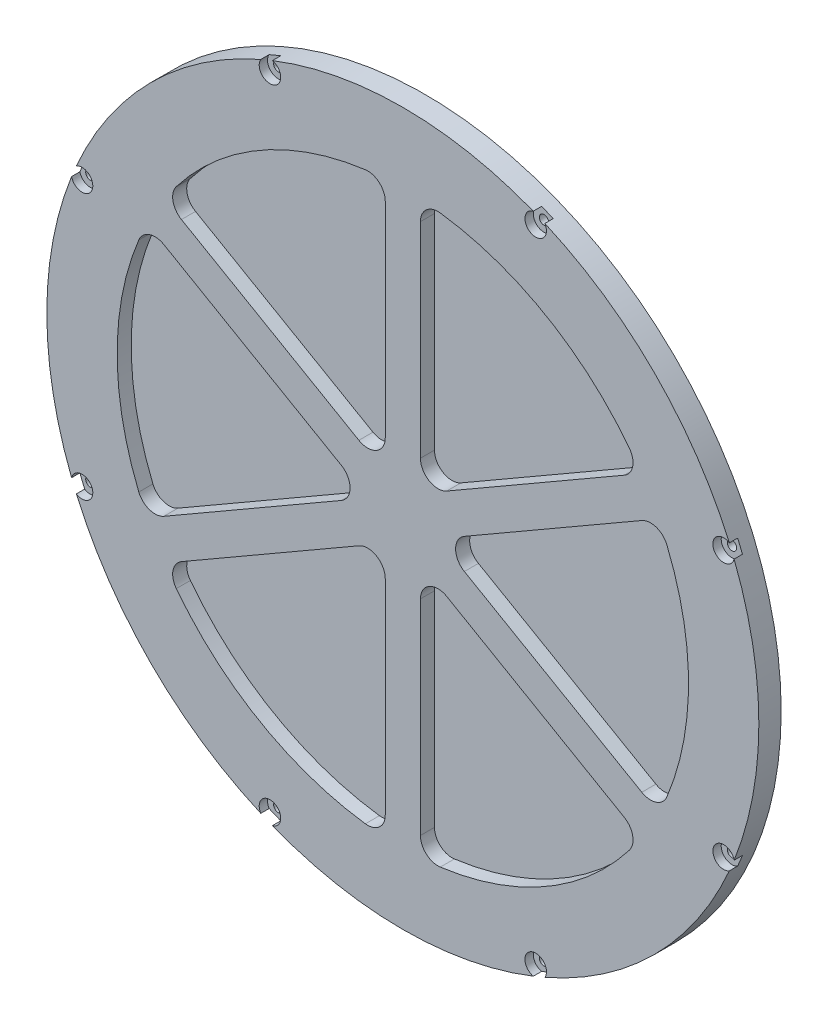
ISO-10303-21;
HEADER;
FILE_DESCRIPTION(('STEP AP214'),'2;1');
FILE_NAME('part.step','',(''),(''),'','','');
FILE_SCHEMA(('AUTOMOTIVE_DESIGN { 1 0 10303 214 1 1 1 1 }'));
ENDSEC;
DATA;
#1=APPLICATION_CONTEXT('core data for automotive mechanical design processes');
#2=APPLICATION_PROTOCOL_DEFINITION('international standard','automotive_design',2000,#1);
#3=PRODUCT_CONTEXT('',#1,'mechanical');
#4=PRODUCT('Part','Part','',(#3));
#5=PRODUCT_RELATED_PRODUCT_CATEGORY('part','',(#4));
#6=PRODUCT_DEFINITION_FORMATION('','',#4);
#7=PRODUCT_DEFINITION_CONTEXT('part definition',#1,'design');
#8=PRODUCT_DEFINITION('design','',#6,#7);
#9=PRODUCT_DEFINITION_SHAPE('','',#8);
#10=(LENGTH_UNIT() NAMED_UNIT(*) SI_UNIT(.MILLI.,.METRE.));
#11=(NAMED_UNIT(*) PLANE_ANGLE_UNIT() SI_UNIT($,.RADIAN.));
#12=(NAMED_UNIT(*) SI_UNIT($,.STERADIAN.) SOLID_ANGLE_UNIT());
#13=UNCERTAINTY_MEASURE_WITH_UNIT(LENGTH_MEASURE(1.E-05),#10,'distance_accuracy_value','');
#14=(GEOMETRIC_REPRESENTATION_CONTEXT(3) GLOBAL_UNCERTAINTY_ASSIGNED_CONTEXT((#13)) GLOBAL_UNIT_ASSIGNED_CONTEXT((#10,
#11,#12)) REPRESENTATION_CONTEXT('',''));
#15=CARTESIAN_POINT('',(0.,0.,0.));
#16=DIRECTION('',(0.,0.,1.));
#17=DIRECTION('',(1.,0.,0.));
#18=AXIS2_PLACEMENT_3D('',#15,#16,#17);
#19=CARTESIAN_POINT('',(-1.66533453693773E-13,0.,6.34999999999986));
#20=DIRECTION('',(0.,0.,-1.));
#21=DIRECTION('',(-1.,0.,0.));
#22=AXIS2_PLACEMENT_3D('',#19,#20,#21);
#23=CYLINDRICAL_SURFACE('',#22,202.5);
#24=CARTESIAN_POINT('',(-1.38777878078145E-13,0.,1.60999999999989));
#25=DIRECTION('',(0.,0.,-1.));
#26=DIRECTION('',(-1.,0.,0.));
#27=AXIS2_PLACEMENT_3D('',#24,#25,#26);
#28=CIRCLE('',#27,202.5);
#29=CARTESIAN_POINT('',(-188.423930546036,74.1799999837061,1.60999999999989));
#30=VERTEX_POINT('',#29);
#31=CARTESIAN_POINT('',(-185.689020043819,80.7826580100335,1.61000000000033));
#32=VERTEX_POINT('',#31);
#33=EDGE_CURVE('E383',#30,#32,#28,.T.);
#34=ORIENTED_EDGE('',*,*,#33,.T.);
#35=DIRECTION('',(0.,0.,1.));
#36=VECTOR('',#35,1.);
#37=CARTESIAN_POINT('',(-185.689020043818,80.782658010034,3.97999999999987));
#38=LINE('',#37,#36);
#39=CARTESIAN_POINT('',(-185.689020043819,80.7826580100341,6.3500000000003));
#40=VERTEX_POINT('',#39);
#41=EDGE_CURVE('E13',#32,#40,#38,.T.);
#42=ORIENTED_EDGE('',*,*,#41,.T.);
#43=CARTESIAN_POINT('',(-1.66533453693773E-13,0.,6.34999999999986));
#44=DIRECTION('',(0.,0.,1.));
#45=DIRECTION('',(1.,0.,0.));
#46=AXIS2_PLACEMENT_3D('',#43,#44,#45);
#47=CIRCLE('',#46,202.5);
#48=CARTESIAN_POINT('',(-80.7826580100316,185.68902004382,6.3500000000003));
#49=VERTEX_POINT('',#48);
#50=EDGE_CURVE('E391',#49,#40,#47,.T.);
#51=ORIENTED_EDGE('',*,*,#50,.F.);
#52=DIRECTION('',(0.,0.,1.));
#53=VECTOR('',#52,1.);
#54=CARTESIAN_POINT('',(-80.7826580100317,185.68902004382,3.97999999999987));
#55=LINE('',#54,#53);
#56=CARTESIAN_POINT('',(-80.7826580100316,185.689020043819,1.60999999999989));
#57=VERTEX_POINT('',#56);
#58=EDGE_CURVE('E397',#49,#57,#55,.F.);
#59=ORIENTED_EDGE('',*,*,#58,.T.);
#60=CARTESIAN_POINT('',(-1.38777878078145E-13,0.,1.60999999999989));
#61=DIRECTION('',(0.,0.,-1.));
#62=DIRECTION('',(-1.,0.,0.));
#63=AXIS2_PLACEMENT_3D('',#60,#61,#62);
#64=CIRCLE('',#63,202.5);
#65=CARTESIAN_POINT('',(-74.1799999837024,188.423930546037,1.61000000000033));
#66=VERTEX_POINT('',#65);
#67=EDGE_CURVE('E401',#57,#66,#64,.T.);
#68=ORIENTED_EDGE('',*,*,#67,.T.);
#69=DIRECTION('',(0.,0.,1.));
#70=VECTOR('',#69,1.);
#71=CARTESIAN_POINT('',(-74.1799999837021,188.423930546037,3.97999999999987));
#72=LINE('',#71,#70);
#73=CARTESIAN_POINT('',(-74.1799999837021,188.423930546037,6.34999999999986));
#74=VERTEX_POINT('',#73);
#75=EDGE_CURVE('E419',#66,#74,#72,.T.);
#76=ORIENTED_EDGE('',*,*,#75,.T.);
#77=CARTESIAN_POINT('',(74.1799999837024,188.423930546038,6.3500000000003));
#78=VERTEX_POINT('',#77);
#79=EDGE_CURVE('E400',#78,#74,#47,.T.);
#80=ORIENTED_EDGE('',*,*,#79,.F.);
#81=DIRECTION('',(0.,0.,1.));
#82=VECTOR('',#81,1.);
#83=CARTESIAN_POINT('',(74.1799999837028,188.423930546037,3.98000000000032));
#84=LINE('',#83,#82);
#85=CARTESIAN_POINT('',(74.1799999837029,188.423930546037,1.60999999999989));
#86=VERTEX_POINT('',#85);
#87=EDGE_CURVE('E544',#78,#86,#84,.F.);
#88=ORIENTED_EDGE('',*,*,#87,.T.);
#89=CARTESIAN_POINT('',(-1.38777878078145E-13,0.,1.60999999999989));
#90=DIRECTION('',(0.,0.,-1.));
#91=DIRECTION('',(-1.,0.,0.));
#92=AXIS2_PLACEMENT_3D('',#89,#90,#91);
#93=CIRCLE('',#92,202.5);
#94=CARTESIAN_POINT('',(80.7826580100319,185.68902004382,1.61000000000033));
#95=VERTEX_POINT('',#94);
#96=EDGE_CURVE('E423',#86,#95,#93,.T.);
#97=ORIENTED_EDGE('',*,*,#96,.T.);
#98=DIRECTION('',(0.,0.,1.));
#99=VECTOR('',#98,1.);
#100=CARTESIAN_POINT('',(80.7826580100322,185.689020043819,3.98000000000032));
#101=LINE('',#100,#99);
#102=CARTESIAN_POINT('',(80.7826580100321,185.689020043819,6.34999999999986));
#103=VERTEX_POINT('',#102);
#104=EDGE_CURVE('E547',#95,#103,#101,.T.);
#105=ORIENTED_EDGE('',*,*,#104,.T.);
#106=CARTESIAN_POINT('',(185.68902004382,80.7826580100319,6.3500000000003));
#107=VERTEX_POINT('',#106);
#108=EDGE_CURVE('E406',#107,#103,#47,.T.);
#109=ORIENTED_EDGE('',*,*,#108,.F.);
#110=DIRECTION('',(0.,0.,1.));
#111=VECTOR('',#110,1.);
#112=CARTESIAN_POINT('',(185.68902004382,80.782658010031,3.97999999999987));
#113=LINE('',#112,#111);
#114=CARTESIAN_POINT('',(185.68902004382,80.782658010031,1.60999999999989));
#115=VERTEX_POINT('',#114);
#116=EDGE_CURVE('E426',#107,#115,#113,.F.);
#117=ORIENTED_EDGE('',*,*,#116,.T.);
#118=CARTESIAN_POINT('',(-1.38777878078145E-13,0.,1.60999999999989));
#119=DIRECTION('',(0.,0.,-1.));
#120=DIRECTION('',(-1.,0.,0.));
#121=AXIS2_PLACEMENT_3D('',#118,#119,#120);
#122=CIRCLE('',#121,202.5);
#123=CARTESIAN_POINT('',(188.423930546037,74.1799999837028,1.60999999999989));
#124=VERTEX_POINT('',#123);
#125=EDGE_CURVE('E429',#115,#124,#122,.T.);
#126=ORIENTED_EDGE('',*,*,#125,.T.);
#127=DIRECTION('',(0.,0.,1.));
#128=VECTOR('',#127,1.);
#129=CARTESIAN_POINT('',(188.423930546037,74.1799999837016,3.97999999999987));
#130=LINE('',#129,#128);
#131=CARTESIAN_POINT('',(188.423930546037,74.1799999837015,6.34999999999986));
#132=VERTEX_POINT('',#131);
#133=EDGE_CURVE('E432',#124,#132,#130,.T.);
#134=ORIENTED_EDGE('',*,*,#133,.T.);
#135=CARTESIAN_POINT('',(188.423930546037,-74.1799999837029,6.3500000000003));
#136=VERTEX_POINT('',#135);
#137=EDGE_CURVE('E410',#136,#132,#47,.T.);
#138=ORIENTED_EDGE('',*,*,#137,.F.);
#139=DIRECTION('',(0.,0.,1.));
#140=VECTOR('',#139,1.);
#141=CARTESIAN_POINT('',(188.423930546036,-74.1799999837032,3.98000000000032));
#142=LINE('',#141,#140);
#143=CARTESIAN_POINT('',(188.423930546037,-74.1799999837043,1.61000000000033));
#144=VERTEX_POINT('',#143);
#145=EDGE_CURVE('E515',#136,#144,#142,.F.);
#146=ORIENTED_EDGE('',*,*,#145,.T.);
#147=CARTESIAN_POINT('',(-1.38777878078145E-13,0.,1.60999999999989));
#148=DIRECTION('',(0.,0.,-1.));
#149=DIRECTION('',(-1.,0.,0.));
#150=AXIS2_PLACEMENT_3D('',#147,#148,#149);
#151=CIRCLE('',#150,202.5);
#152=CARTESIAN_POINT('',(185.68902004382,-80.782658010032,1.61000000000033));
#153=VERTEX_POINT('',#152);
#154=EDGE_CURVE('E435',#144,#153,#151,.T.);
#155=ORIENTED_EDGE('',*,*,#154,.T.);
#156=DIRECTION('',(0.,0.,1.));
#157=VECTOR('',#156,1.);
#158=CARTESIAN_POINT('',(185.689020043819,-80.7826580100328,3.98000000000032));
#159=LINE('',#158,#157);
#160=CARTESIAN_POINT('',(185.689020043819,-80.7826580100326,6.34999999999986));
#161=VERTEX_POINT('',#160);
#162=EDGE_CURVE('E518',#153,#161,#159,.T.);
#163=ORIENTED_EDGE('',*,*,#162,.T.);
#164=CARTESIAN_POINT('',(80.7826580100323,-185.68902004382,6.3500000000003));
#165=VERTEX_POINT('',#164);
#166=EDGE_CURVE('E1464',#165,#161,#47,.T.);
#167=ORIENTED_EDGE('',*,*,#166,.F.);
#168=DIRECTION('',(0.,0.,1.));
#169=VECTOR('',#168,1.);
#170=CARTESIAN_POINT('',(80.7826580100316,-185.689020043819,3.97999999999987));
#171=LINE('',#170,#169);
#172=CARTESIAN_POINT('',(80.7826580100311,-185.689020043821,1.61000000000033));
#173=VERTEX_POINT('',#172);
#174=EDGE_CURVE('E497',#165,#173,#171,.F.);
#175=ORIENTED_EDGE('',*,*,#174,.T.);
#176=CARTESIAN_POINT('',(-1.38777878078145E-13,0.,1.60999999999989));
#177=DIRECTION('',(0.,0.,-1.));
#178=DIRECTION('',(-1.,0.,0.));
#179=AXIS2_PLACEMENT_3D('',#176,#177,#178);
#180=CIRCLE('',#179,202.5);
#181=CARTESIAN_POINT('',(74.1799999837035,-188.423930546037,1.60999999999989));
#182=VERTEX_POINT('',#181);
#183=EDGE_CURVE('E439',#173,#182,#180,.T.);
#184=ORIENTED_EDGE('',*,*,#183,.T.);
#185=DIRECTION('',(0.,0.,1.));
#186=VECTOR('',#185,1.);
#187=CARTESIAN_POINT('',(74.1799999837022,-188.423930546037,3.97999999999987));
#188=LINE('',#187,#186);
#189=CARTESIAN_POINT('',(74.1799999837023,-188.423930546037,6.34999999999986));
#190=VERTEX_POINT('',#189);
#191=EDGE_CURVE('E500',#182,#190,#188,.T.);
#192=ORIENTED_EDGE('',*,*,#191,.T.);
#193=CARTESIAN_POINT('',(-74.1799999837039,-188.423930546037,6.34999999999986));
#194=VERTEX_POINT('',#193);
#195=EDGE_CURVE('E1463',#194,#190,#47,.T.);
#196=ORIENTED_EDGE('',*,*,#195,.F.);
#197=DIRECTION('',(0.,0.,1.));
#198=VECTOR('',#197,1.);
#199=CARTESIAN_POINT('',(-74.1799999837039,-188.423930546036,3.97999999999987));
#200=LINE('',#199,#198);
#201=CARTESIAN_POINT('',(-74.1799999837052,-188.423930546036,1.61000000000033));
#202=VERTEX_POINT('',#201);
#203=EDGE_CURVE('E480',#194,#202,#200,.F.);
#204=ORIENTED_EDGE('',*,*,#203,.T.);
#205=CARTESIAN_POINT('',(-1.38777878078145E-13,0.,1.60999999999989));
#206=DIRECTION('',(0.,0.,-1.));
#207=DIRECTION('',(-1.,0.,0.));
#208=AXIS2_PLACEMENT_3D('',#205,#206,#207);
#209=CIRCLE('',#208,202.5);
#210=CARTESIAN_POINT('',(-80.7826580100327,-185.68902004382,1.60999999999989));
#211=VERTEX_POINT('',#210);
#212=EDGE_CURVE('E443',#202,#211,#209,.T.);
#213=ORIENTED_EDGE('',*,*,#212,.T.);
#214=DIRECTION('',(0.,0.,1.));
#215=VECTOR('',#214,1.);
#216=CARTESIAN_POINT('',(-80.7826580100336,-185.689020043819,3.98000000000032));
#217=LINE('',#216,#215);
#218=CARTESIAN_POINT('',(-80.7826580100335,-185.689020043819,6.3500000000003));
#219=VERTEX_POINT('',#218);
#220=EDGE_CURVE('E483',#211,#219,#217,.T.);
#221=ORIENTED_EDGE('',*,*,#220,.T.);
#222=CARTESIAN_POINT('',(-185.689020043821,-80.7826580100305,6.34999999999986));
#223=VERTEX_POINT('',#222);
#224=EDGE_CURVE('E403',#223,#219,#47,.T.);
#225=ORIENTED_EDGE('',*,*,#224,.F.);
#226=DIRECTION('',(0.,0.,1.));
#227=VECTOR('',#226,1.);
#228=CARTESIAN_POINT('',(-185.68902004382,-80.7826580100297,3.97999999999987));
#229=LINE('',#228,#227);
#230=CARTESIAN_POINT('',(-185.689020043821,-80.7826580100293,1.61000000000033));
#231=VERTEX_POINT('',#230);
#232=EDGE_CURVE('E71',#223,#231,#229,.F.);
#233=ORIENTED_EDGE('',*,*,#232,.T.);
#234=CARTESIAN_POINT('',(-1.38777878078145E-13,0.,1.60999999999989));
#235=DIRECTION('',(0.,0.,-1.));
#236=DIRECTION('',(-1.,0.,0.));
#237=AXIS2_PLACEMENT_3D('',#234,#235,#236);
#238=CIRCLE('',#237,202.5);
#239=CARTESIAN_POINT('',(-188.423930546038,-74.1799999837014,1.60999999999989));
#240=VERTEX_POINT('',#239);
#241=EDGE_CURVE('E384',#231,#240,#238,.T.);
#242=ORIENTED_EDGE('',*,*,#241,.T.);
#243=DIRECTION('',(0.,0.,1.));
#244=VECTOR('',#243,1.);
#245=CARTESIAN_POINT('',(-188.423930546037,-74.1799999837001,3.98000000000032));
#246=LINE('',#245,#244);
#247=CARTESIAN_POINT('',(-188.423930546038,-74.1799999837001,6.34999999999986));
#248=VERTEX_POINT('',#247);
#249=EDGE_CURVE('E450',#240,#248,#246,.T.);
#250=ORIENTED_EDGE('',*,*,#249,.T.);
#251=CARTESIAN_POINT('',(-188.423930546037,74.1799999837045,6.3500000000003));
#252=VERTEX_POINT('',#251);
#253=EDGE_CURVE('E398',#252,#248,#47,.T.);
#254=ORIENTED_EDGE('',*,*,#253,.F.);
#255=DIRECTION('',(0.,0.,1.));
#256=VECTOR('',#255,1.);
#257=CARTESIAN_POINT('',(-188.423930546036,74.1799999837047,3.98000000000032));
#258=LINE('',#257,#256);
#259=EDGE_CURVE('E57',#252,#30,#258,.F.);
#260=ORIENTED_EDGE('',*,*,#259,.T.);
#261=EDGE_LOOP('',(#34,#42,#51,#59,#68,#76,#80,#88,#97,#105,#109,#117,#126,#134,#138,#146,#155,
#163,#167,#175,#184,#192,#196,#204,#213,#221,#225,#233,#242,#250,#254,#260));
#262=FACE_BOUND('',#261,.T.);
#263=CARTESIAN_POINT('',(0.,0.,-6.34999999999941));
#264=DIRECTION('',(0.,0.,1.));
#265=DIRECTION('',(1.,0.,0.));
#266=AXIS2_PLACEMENT_3D('',#263,#264,#265);
#267=CIRCLE('',#266,202.5);
#268=CARTESIAN_POINT('',(202.5,0.,-6.34999999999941));
#269=VERTEX_POINT('',#268);
#270=EDGE_CURVE('E407',#269,#269,#267,.T.);
#271=ORIENTED_EDGE('',*,*,#270,.T.);
#272=EDGE_LOOP('',(#271));
#273=FACE_BOUND('',#272,.T.);
#274=ADVANCED_FACE('F50',(#262,#273),#23,.T.);
#275=CARTESIAN_POINT('',(-1.66533453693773E-13,0.,6.34999999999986));
#276=DIRECTION('',(0.,0.,1.));
#277=DIRECTION('',(1.,0.,0.));
#278=AXIS2_PLACEMENT_3D('',#275,#276,#277);
#279=PLANE('',#278);
#280=CARTESIAN_POINT('',(-182.466207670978,75.5799778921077,6.34999999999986));
#281=DIRECTION('',(0.,0.,1.));
#282=DIRECTION('',(1.,0.,0.));
#283=AXIS2_PLACEMENT_3D('',#280,#281,#282);
#284=CIRCLE('',#283,6.11999999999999);
#285=EDGE_CURVE('E377',#252,#40,#284,.T.);
#286=ORIENTED_EDGE('',*,*,#285,.F.);
#287=ORIENTED_EDGE('',*,*,#253,.T.);
#288=CARTESIAN_POINT('',(-182.46620767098,-75.5799778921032,6.3500000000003));
#289=DIRECTION('',(0.,0.,1.));
#290=DIRECTION('',(1.,0.,0.));
#291=AXIS2_PLACEMENT_3D('',#288,#289,#290);
#292=CIRCLE('',#291,6.11999999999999);
#293=EDGE_CURVE('E446',#223,#248,#292,.T.);
#294=ORIENTED_EDGE('',*,*,#293,.F.);
#295=ORIENTED_EDGE('',*,*,#224,.T.);
#296=CARTESIAN_POINT('',(-75.5799778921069,-182.466207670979,6.3500000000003));
#297=DIRECTION('',(0.,0.,1.));
#298=DIRECTION('',(1.,0.,0.));
#299=AXIS2_PLACEMENT_3D('',#296,#297,#298);
#300=CIRCLE('',#299,6.12);
#301=EDGE_CURVE('E442',#194,#219,#300,.T.);
#302=ORIENTED_EDGE('',*,*,#301,.F.);
#303=ORIENTED_EDGE('',*,*,#195,.T.);
#304=CARTESIAN_POINT('',(75.5799778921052,-182.466207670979,6.3500000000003));
#305=DIRECTION('',(0.,0.,1.));
#306=DIRECTION('',(1.,0.,0.));
#307=AXIS2_PLACEMENT_3D('',#304,#305,#306);
#308=CIRCLE('',#307,6.12);
#309=EDGE_CURVE('E438',#165,#190,#308,.T.);
#310=ORIENTED_EDGE('',*,*,#309,.F.);
#311=ORIENTED_EDGE('',*,*,#166,.T.);
#312=CARTESIAN_POINT('',(182.466207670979,-75.5799778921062,6.34999999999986));
#313=DIRECTION('',(0.,0.,1.));
#314=DIRECTION('',(1.,0.,0.));
#315=AXIS2_PLACEMENT_3D('',#312,#313,#314);
#316=CIRCLE('',#315,6.11999999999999);
#317=EDGE_CURVE('E503',#136,#161,#316,.T.);
#318=ORIENTED_EDGE('',*,*,#317,.F.);
#319=ORIENTED_EDGE('',*,*,#137,.T.);
#320=CARTESIAN_POINT('',(182.46620767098,75.5799778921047,6.34999999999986));
#321=DIRECTION('',(0.,0.,1.));
#322=DIRECTION('',(1.,0.,0.));
#323=AXIS2_PLACEMENT_3D('',#320,#321,#322);
#324=CIRCLE('',#323,6.11999999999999);
#325=EDGE_CURVE('E521',#107,#132,#324,.T.);
#326=ORIENTED_EDGE('',*,*,#325,.F.);
#327=ORIENTED_EDGE('',*,*,#108,.T.);
#328=CARTESIAN_POINT('',(75.5799778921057,182.466207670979,6.3500000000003));
#329=DIRECTION('',(0.,0.,1.));
#330=DIRECTION('',(1.,0.,0.));
#331=AXIS2_PLACEMENT_3D('',#328,#329,#330);
#332=CIRCLE('',#331,6.12);
#333=EDGE_CURVE('E422',#78,#103,#332,.T.);
#334=ORIENTED_EDGE('',*,*,#333,.F.);
#335=ORIENTED_EDGE('',*,*,#79,.T.);
#336=CARTESIAN_POINT('',(-75.5799778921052,182.466207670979,6.34999999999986));
#337=DIRECTION('',(0.,0.,1.));
#338=DIRECTION('',(1.,0.,0.));
#339=AXIS2_PLACEMENT_3D('',#336,#337,#338);
#340=CIRCLE('',#339,6.12);
#341=EDGE_CURVE('E396',#49,#74,#340,.T.);
#342=ORIENTED_EDGE('',*,*,#341,.F.);
#343=ORIENTED_EDGE('',*,*,#50,.T.);
#344=EDGE_LOOP('',(#286,#287,#294,#295,#302,#303,#310,#311,#318,#319,#326,#327,#334,#335,#342,#343));
#345=FACE_BOUND('',#344,.T.);
#346=CARTESIAN_POINT('',(120.928176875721,92.9119262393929,6.3500000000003));
#347=DIRECTION('',(0.,0.,1.));
#348=DIRECTION('',(1.,0.,0.));
#349=AXIS2_PLACEMENT_3D('',#346,#347,#348);
#350=CIRCLE('',#349,9.99999999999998);
#351=CARTESIAN_POINT('',(125.928176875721,84.2516722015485,6.3500000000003));
#352=VERTEX_POINT('',#351);
#353=CARTESIAN_POINT('',(128.857893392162,99.0045115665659,6.3500000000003));
#354=VERTEX_POINT('',#353);
#355=EDGE_CURVE('E550',#352,#354,#350,.T.);
#356=ORIENTED_EDGE('',*,*,#355,.F.);
#357=DIRECTION('',(0.866025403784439,0.5,0.));
#358=VECTOR('',#357,1.);
#359=CARTESIAN_POINT('',(125.928176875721,84.2516722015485,6.3500000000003));
#360=LINE('',#359,#358);
#361=CARTESIAN_POINT('',(24.9999999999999,25.9807621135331,6.3500000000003));
#362=VERTEX_POINT('',#361);
#363=EDGE_CURVE('E555',#362,#352,#360,.T.);
#364=ORIENTED_EDGE('',*,*,#363,.F.);
#365=CARTESIAN_POINT('',(20.0000000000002,34.6410161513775,6.3500000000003));
#366=DIRECTION('',(0.,0.,1.));
#367=DIRECTION('',(-1.,0.,0.));
#368=AXIS2_PLACEMENT_3D('',#365,#366,#367);
#369=CIRCLE('',#368,10.);
#370=CARTESIAN_POINT('',(9.99999999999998,34.6410161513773,6.34999999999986));
#371=VERTEX_POINT('',#370);
#372=EDGE_CURVE('E581',#371,#362,#369,.T.);
#373=ORIENTED_EDGE('',*,*,#372,.F.);
#374=DIRECTION('',(0.,-1.,0.));
#375=VECTOR('',#374,1.);
#376=CARTESIAN_POINT('',(9.99999999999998,151.182836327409,6.34999999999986));
#377=LINE('',#376,#375);
#378=CARTESIAN_POINT('',(9.99999999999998,151.182836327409,6.34999999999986));
#379=VERTEX_POINT('',#378);
#380=EDGE_CURVE('E578',#379,#371,#377,.T.);
#381=ORIENTED_EDGE('',*,*,#380,.F.);
#382=CARTESIAN_POINT('',(20.,151.182836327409,6.34999999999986));
#383=DIRECTION('',(0.,0.,1.));
#384=DIRECTION('',(-1.,0.,0.));
#385=AXIS2_PLACEMENT_3D('',#382,#383,#384);
#386=CIRCLE('',#385,9.99999999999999);
#387=CARTESIAN_POINT('',(21.3114754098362,161.096464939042,6.3500000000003));
#388=VERTEX_POINT('',#387);
#389=EDGE_CURVE('E575',#388,#379,#386,.T.);
#390=ORIENTED_EDGE('',*,*,#389,.F.);
#391=CARTESIAN_POINT('',(-1.66533453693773E-13,0.,6.34999999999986));
#392=DIRECTION('',(0.,0.,1.));
#393=DIRECTION('',(1.,0.,0.));
#394=AXIS2_PLACEMENT_3D('',#391,#392,#393);
#395=CIRCLE('',#394,162.5);
#396=EDGE_CURVE('E572',#354,#388,#395,.T.);
#397=ORIENTED_EDGE('',*,*,#396,.F.);
#398=EDGE_LOOP('',(#356,#364,#373,#381,#390,#397));
#399=FACE_BOUND('',#398,.T.);
#400=CARTESIAN_POINT('',(39.9999999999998,0.,6.34999999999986));
#401=DIRECTION('',(0.,0.,1.));
#402=DIRECTION('',(-1.,0.,0.));
#403=AXIS2_PLACEMENT_3D('',#400,#401,#402);
#404=CIRCLE('',#403,10.);
#405=CARTESIAN_POINT('',(34.9999999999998,8.66025403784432,6.34999999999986));
#406=VERTEX_POINT('',#405);
#407=CARTESIAN_POINT('',(34.9999999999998,-8.66025403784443,6.34999999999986));
#408=VERTEX_POINT('',#407);
#409=EDGE_CURVE('E588',#406,#408,#404,.T.);
#410=ORIENTED_EDGE('',*,*,#409,.F.);
#411=DIRECTION('',(-0.86602540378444,-0.499999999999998,0.));
#412=VECTOR('',#411,1.);
#413=CARTESIAN_POINT('',(34.9999999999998,8.66025403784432,6.34999999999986));
#414=LINE('',#413,#412);
#415=CARTESIAN_POINT('',(135.928176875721,66.9311641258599,6.3500000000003));
#416=VERTEX_POINT('',#415);
#417=EDGE_CURVE('E603',#416,#406,#414,.T.);
#418=ORIENTED_EDGE('',*,*,#417,.F.);
#419=CARTESIAN_POINT('',(140.928176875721,58.2709100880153,6.3500000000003));
#420=DIRECTION('',(0.,0.,1.));
#421=DIRECTION('',(1.,0.,0.));
#422=AXIS2_PLACEMENT_3D('',#419,#420,#421);
#423=CIRCLE('',#422,10.);
#424=CARTESIAN_POINT('',(150.169368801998,62.0919533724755,6.34999999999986));
#425=VERTEX_POINT('',#424);
#426=EDGE_CURVE('E629',#425,#416,#423,.T.);
#427=ORIENTED_EDGE('',*,*,#426,.F.);
#428=CARTESIAN_POINT('',(-1.66533453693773E-13,0.,6.34999999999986));
#429=DIRECTION('',(0.,0.,1.));
#430=DIRECTION('',(1.,0.,0.));
#431=AXIS2_PLACEMENT_3D('',#428,#429,#430);
#432=CIRCLE('',#431,162.5);
#433=CARTESIAN_POINT('',(150.169368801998,-62.0919533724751,6.34999999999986));
#434=VERTEX_POINT('',#433);
#435=EDGE_CURVE('E626',#434,#425,#432,.T.);
#436=ORIENTED_EDGE('',*,*,#435,.F.);
#437=CARTESIAN_POINT('',(140.928176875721,-58.270910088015,6.3500000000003));
#438=DIRECTION('',(0.,0.,1.));
#439=DIRECTION('',(1.,0.,0.));
#440=AXIS2_PLACEMENT_3D('',#437,#438,#439);
#441=CIRCLE('',#440,10.);
#442=CARTESIAN_POINT('',(135.928176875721,-66.9311641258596,6.3500000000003));
#443=VERTEX_POINT('',#442);
#444=EDGE_CURVE('E623',#443,#434,#441,.T.);
#445=ORIENTED_EDGE('',*,*,#444,.F.);
#446=DIRECTION('',(0.866025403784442,-0.499999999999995,0.));
#447=VECTOR('',#446,1.);
#448=CARTESIAN_POINT('',(34.9999999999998,-8.66025403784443,6.34999999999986));
#449=LINE('',#448,#447);
#450=EDGE_CURVE('E620',#408,#443,#449,.T.);
#451=ORIENTED_EDGE('',*,*,#450,.F.);
#452=EDGE_LOOP('',(#410,#418,#427,#436,#445,#451));
#453=FACE_BOUND('',#452,.T.);
#454=CARTESIAN_POINT('',(120.928176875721,-92.9119262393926,6.3500000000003));
#455=DIRECTION('',(0.,0.,1.));
#456=DIRECTION('',(1.,0.,0.));
#457=AXIS2_PLACEMENT_3D('',#454,#455,#456);
#458=CIRCLE('',#457,10.);
#459=CARTESIAN_POINT('',(128.857893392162,-99.0045115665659,6.3500000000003));
#460=VERTEX_POINT('',#459);
#461=CARTESIAN_POINT('',(125.928176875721,-84.2516722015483,6.34999999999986));
#462=VERTEX_POINT('',#461);
#463=EDGE_CURVE('E636',#460,#462,#458,.T.);
#464=ORIENTED_EDGE('',*,*,#463,.F.);
#465=CARTESIAN_POINT('',(-1.66533453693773E-13,0.,6.34999999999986));
#466=DIRECTION('',(0.,0.,1.));
#467=DIRECTION('',(1.,0.,0.));
#468=AXIS2_PLACEMENT_3D('',#465,#466,#467);
#469=CIRCLE('',#468,162.5);
#470=CARTESIAN_POINT('',(21.3114754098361,-161.096464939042,6.34999999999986));
#471=VERTEX_POINT('',#470);
#472=EDGE_CURVE('E651',#471,#460,#469,.T.);
#473=ORIENTED_EDGE('',*,*,#472,.F.);
#474=CARTESIAN_POINT('',(20.0000000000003,-151.182836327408,6.3500000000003));
#475=DIRECTION('',(0.,0.,1.));
#476=DIRECTION('',(-1.,0.,0.));
#477=AXIS2_PLACEMENT_3D('',#474,#475,#476);
#478=CIRCLE('',#477,10.);
#479=CARTESIAN_POINT('',(10.0000000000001,-151.182836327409,6.3500000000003));
#480=VERTEX_POINT('',#479);
#481=EDGE_CURVE('E677',#480,#471,#478,.T.);
#482=ORIENTED_EDGE('',*,*,#481,.F.);
#483=DIRECTION('',(0.,-1.,0.));
#484=VECTOR('',#483,1.);
#485=CARTESIAN_POINT('',(10.,-34.6410161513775,6.3500000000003));
#486=LINE('',#485,#484);
#487=CARTESIAN_POINT('',(10.,-34.6410161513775,6.3500000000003));
#488=VERTEX_POINT('',#487);
#489=EDGE_CURVE('E674',#488,#480,#486,.T.);
#490=ORIENTED_EDGE('',*,*,#489,.F.);
#491=CARTESIAN_POINT('',(20.,-34.6410161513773,6.34999999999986));
#492=DIRECTION('',(0.,0.,1.));
#493=DIRECTION('',(-1.,0.,0.));
#494=AXIS2_PLACEMENT_3D('',#491,#492,#493);
#495=CIRCLE('',#494,10.);
#496=CARTESIAN_POINT('',(25.0000000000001,-25.9807621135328,6.34999999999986));
#497=VERTEX_POINT('',#496);
#498=EDGE_CURVE('E671',#497,#488,#495,.T.);
#499=ORIENTED_EDGE('',*,*,#498,.F.);
#500=DIRECTION('',(-0.86602540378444,0.499999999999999,0.));
#501=VECTOR('',#500,1.);
#502=CARTESIAN_POINT('',(125.928176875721,-84.2516722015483,6.34999999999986));
#503=LINE('',#502,#501);
#504=EDGE_CURVE('E668',#462,#497,#503,.T.);
#505=ORIENTED_EDGE('',*,*,#504,.F.);
#506=EDGE_LOOP('',(#464,#473,#482,#490,#499,#505));
#507=FACE_BOUND('',#506,.T.);
#508=CARTESIAN_POINT('',(-20.,-34.6410161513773,6.34999999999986));
#509=DIRECTION('',(0.,0.,1.));
#510=DIRECTION('',(1.,0.,0.));
#511=AXIS2_PLACEMENT_3D('',#508,#509,#510);
#512=CIRCLE('',#511,10.);
#513=CARTESIAN_POINT('',(-10.,-34.6410161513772,6.34999999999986));
#514=VERTEX_POINT('',#513);
#515=CARTESIAN_POINT('',(-25.0000000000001,-25.9807621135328,6.34999999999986));
#516=VERTEX_POINT('',#515);
#517=EDGE_CURVE('E684',#514,#516,#512,.T.);
#518=ORIENTED_EDGE('',*,*,#517,.F.);
#519=DIRECTION('',(0.,1.,0.));
#520=VECTOR('',#519,1.);
#521=CARTESIAN_POINT('',(-10.,-34.6410161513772,6.34999999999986));
#522=LINE('',#521,#520);
#523=CARTESIAN_POINT('',(-9.99999999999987,-151.182836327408,6.3500000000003));
#524=VERTEX_POINT('',#523);
#525=EDGE_CURVE('E699',#524,#514,#522,.T.);
#526=ORIENTED_EDGE('',*,*,#525,.F.);
#527=CARTESIAN_POINT('',(-20.0000000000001,-151.182836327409,6.3500000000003));
#528=DIRECTION('',(0.,0.,1.));
#529=DIRECTION('',(1.,0.,0.));
#530=AXIS2_PLACEMENT_3D('',#527,#528,#529);
#531=CIRCLE('',#530,9.99999999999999);
#532=CARTESIAN_POINT('',(-21.3114754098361,-161.096464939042,6.3500000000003));
#533=VERTEX_POINT('',#532);
#534=EDGE_CURVE('E725',#533,#524,#531,.T.);
#535=ORIENTED_EDGE('',*,*,#534,.F.);
#536=CARTESIAN_POINT('',(-1.66533453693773E-13,0.,6.34999999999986));
#537=DIRECTION('',(0.,0.,1.));
#538=DIRECTION('',(1.,0.,0.));
#539=AXIS2_PLACEMENT_3D('',#536,#537,#538);
#540=CIRCLE('',#539,162.5);
#541=CARTESIAN_POINT('',(-128.857893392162,-99.004511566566,6.3500000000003));
#542=VERTEX_POINT('',#541);
#543=EDGE_CURVE('E722',#542,#533,#540,.T.);
#544=ORIENTED_EDGE('',*,*,#543,.F.);
#545=CARTESIAN_POINT('',(-120.928176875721,-92.9119262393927,6.3500000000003));
#546=DIRECTION('',(0.,0.,1.));
#547=DIRECTION('',(-1.,0.,0.));
#548=AXIS2_PLACEMENT_3D('',#545,#546,#547);
#549=CIRCLE('',#548,10.);
#550=CARTESIAN_POINT('',(-125.928176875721,-84.2516722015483,6.3500000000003));
#551=VERTEX_POINT('',#550);
#552=EDGE_CURVE('E719',#551,#542,#549,.T.);
#553=ORIENTED_EDGE('',*,*,#552,.F.);
#554=DIRECTION('',(-0.86602540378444,-0.499999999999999,0.));
#555=VECTOR('',#554,1.);
#556=CARTESIAN_POINT('',(-125.928176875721,-84.2516722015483,6.3500000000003));
#557=LINE('',#556,#555);
#558=EDGE_CURVE('E716',#516,#551,#557,.T.);
#559=ORIENTED_EDGE('',*,*,#558,.F.);
#560=EDGE_LOOP('',(#518,#526,#535,#544,#553,#559));
#561=FACE_BOUND('',#560,.T.);
#562=CARTESIAN_POINT('',(-140.928176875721,-58.2709100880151,6.3500000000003));
#563=DIRECTION('',(0.,0.,1.));
#564=DIRECTION('',(-1.,0.,0.));
#565=AXIS2_PLACEMENT_3D('',#562,#563,#564);
#566=CIRCLE('',#565,10.);
#567=CARTESIAN_POINT('',(-150.169368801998,-62.0919533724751,6.3500000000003));
#568=VERTEX_POINT('',#567);
#569=CARTESIAN_POINT('',(-135.928176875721,-66.9311641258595,6.3500000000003));
#570=VERTEX_POINT('',#569);
#571=EDGE_CURVE('E732',#568,#570,#566,.T.);
#572=ORIENTED_EDGE('',*,*,#571,.F.);
#573=CARTESIAN_POINT('',(-1.66533453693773E-13,0.,6.34999999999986));
#574=DIRECTION('',(0.,0.,1.));
#575=DIRECTION('',(1.,0.,0.));
#576=AXIS2_PLACEMENT_3D('',#573,#574,#575);
#577=CIRCLE('',#576,162.5);
#578=CARTESIAN_POINT('',(-150.169368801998,62.0919533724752,6.3500000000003));
#579=VERTEX_POINT('',#578);
#580=EDGE_CURVE('E747',#579,#568,#577,.T.);
#581=ORIENTED_EDGE('',*,*,#580,.F.);
#582=CARTESIAN_POINT('',(-140.928176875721,58.2709100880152,6.34999999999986));
#583=DIRECTION('',(0.,0.,1.));
#584=DIRECTION('',(1.,0.,0.));
#585=AXIS2_PLACEMENT_3D('',#582,#583,#584);
#586=CIRCLE('',#585,10.);
#587=CARTESIAN_POINT('',(-135.928176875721,66.9311641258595,6.3500000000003));
#588=VERTEX_POINT('',#587);
#589=EDGE_CURVE('E773',#588,#579,#586,.T.);
#590=ORIENTED_EDGE('',*,*,#589,.F.);
#591=DIRECTION('',(-0.866025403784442,0.499999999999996,0.));
#592=VECTOR('',#591,1.);
#593=CARTESIAN_POINT('',(-34.9999999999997,8.66025403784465,6.3500000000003));
#594=LINE('',#593,#592);
#595=CARTESIAN_POINT('',(-34.9999999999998,8.66025403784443,6.3500000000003));
#596=VERTEX_POINT('',#595);
#597=EDGE_CURVE('E770',#596,#588,#594,.T.);
#598=ORIENTED_EDGE('',*,*,#597,.F.);
#599=CARTESIAN_POINT('',(-39.9999999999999,2.22044604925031E-13,6.3500000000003));
#600=DIRECTION('',(0.,0.,1.));
#601=DIRECTION('',(1.,0.,0.));
#602=AXIS2_PLACEMENT_3D('',#599,#600,#601);
#603=CIRCLE('',#602,10.);
#604=CARTESIAN_POINT('',(-34.9999999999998,-8.66025403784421,6.34999999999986));
#605=VERTEX_POINT('',#604);
#606=EDGE_CURVE('E767',#605,#596,#603,.T.);
#607=ORIENTED_EDGE('',*,*,#606,.F.);
#608=DIRECTION('',(0.86602540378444,0.499999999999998,0.));
#609=VECTOR('',#608,1.);
#610=CARTESIAN_POINT('',(-34.9999999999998,-8.66025403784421,6.34999999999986));
#611=LINE('',#610,#609);
#612=EDGE_CURVE('E764',#570,#605,#611,.T.);
#613=ORIENTED_EDGE('',*,*,#612,.F.);
#614=EDGE_LOOP('',(#572,#581,#590,#598,#607,#613));
#615=FACE_BOUND('',#614,.T.);
#616=CARTESIAN_POINT('',(-20.,34.6410161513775,6.34999999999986));
#617=DIRECTION('',(0.,0.,1.));
#618=DIRECTION('',(1.,0.,0.));
#619=AXIS2_PLACEMENT_3D('',#616,#617,#618);
#620=CIRCLE('',#619,10.);
#621=CARTESIAN_POINT('',(-25.0000000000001,25.9807621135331,6.3500000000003));
#622=VERTEX_POINT('',#621);
#623=CARTESIAN_POINT('',(-9.9999999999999,34.6410161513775,6.3500000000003));
#624=VERTEX_POINT('',#623);
#625=EDGE_CURVE('E780',#622,#624,#620,.T.);
#626=ORIENTED_EDGE('',*,*,#625,.F.);
#627=DIRECTION('',(0.86602540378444,-0.499999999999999,0.));
#628=VECTOR('',#627,1.);
#629=CARTESIAN_POINT('',(-125.928176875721,84.2516722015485,6.34999999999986));
#630=LINE('',#629,#628);
#631=CARTESIAN_POINT('',(-125.928176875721,84.2516722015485,6.34999999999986));
#632=VERTEX_POINT('',#631);
#633=EDGE_CURVE('E795',#632,#622,#630,.T.);
#634=ORIENTED_EDGE('',*,*,#633,.F.);
#635=CARTESIAN_POINT('',(-120.928176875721,92.9119262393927,6.34999999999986));
#636=DIRECTION('',(0.,0.,1.));
#637=DIRECTION('',(1.,0.,0.));
#638=AXIS2_PLACEMENT_3D('',#635,#636,#637);
#639=CIRCLE('',#638,10.);
#640=CARTESIAN_POINT('',(-128.857893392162,99.0045115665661,6.3500000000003));
#641=VERTEX_POINT('',#640);
#642=EDGE_CURVE('E821',#641,#632,#639,.T.);
#643=ORIENTED_EDGE('',*,*,#642,.F.);
#644=CARTESIAN_POINT('',(-1.66533453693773E-13,0.,6.34999999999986));
#645=DIRECTION('',(0.,0.,1.));
#646=DIRECTION('',(1.,0.,0.));
#647=AXIS2_PLACEMENT_3D('',#644,#645,#646);
#648=CIRCLE('',#647,162.5);
#649=CARTESIAN_POINT('',(-21.3114754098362,161.096464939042,6.3500000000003));
#650=VERTEX_POINT('',#649);
#651=EDGE_CURVE('E818',#650,#641,#648,.T.);
#652=ORIENTED_EDGE('',*,*,#651,.F.);
#653=CARTESIAN_POINT('',(-20.,151.182836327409,6.34999999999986));
#654=DIRECTION('',(0.,0.,1.));
#655=DIRECTION('',(1.,0.,0.));
#656=AXIS2_PLACEMENT_3D('',#653,#654,#655);
#657=CIRCLE('',#656,9.99999999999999);
#658=CARTESIAN_POINT('',(-9.99999999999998,151.182836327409,6.3500000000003));
#659=VERTEX_POINT('',#658);
#660=EDGE_CURVE('E815',#659,#650,#657,.T.);
#661=ORIENTED_EDGE('',*,*,#660,.F.);
#662=DIRECTION('',(0.,1.,0.));
#663=VECTOR('',#662,1.);
#664=CARTESIAN_POINT('',(-9.99999999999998,151.182836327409,6.3500000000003));
#665=LINE('',#664,#663);
#666=EDGE_CURVE('E812',#624,#659,#665,.T.);
#667=ORIENTED_EDGE('',*,*,#666,.F.);
#668=EDGE_LOOP('',(#626,#634,#643,#652,#661,#667));
#669=FACE_BOUND('',#668,.T.);
#670=ADVANCED_FACE('F393',(#345,#399,#453,#507,#561,#615,#669),#279,.T.);
#671=CARTESIAN_POINT('',(0.,0.,-6.34999999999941));
#672=DIRECTION('',(0.,0.,1.));
#673=DIRECTION('',(1.,0.,0.));
#674=AXIS2_PLACEMENT_3D('',#671,#672,#673);
#675=PLANE('',#674);
#676=CARTESIAN_POINT('',(-182.466207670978,75.5799778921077,-6.34999999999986));
#677=DIRECTION('',(0.,0.,1.));
#678=DIRECTION('',(1.,0.,0.));
#679=AXIS2_PLACEMENT_3D('',#676,#677,#678);
#680=CIRCLE('',#679,2.64999999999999);
#681=CARTESIAN_POINT('',(-179.816207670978,75.5799778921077,-6.34999999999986));
#682=VERTEX_POINT('',#681);
#683=EDGE_CURVE('E457',#682,#682,#680,.T.);
#684=ORIENTED_EDGE('',*,*,#683,.T.);
#685=EDGE_LOOP('',(#684));
#686=FACE_BOUND('',#685,.T.);
#687=CARTESIAN_POINT('',(-182.46620767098,-75.5799778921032,-6.34999999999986));
#688=DIRECTION('',(0.,0.,1.));
#689=DIRECTION('',(1.,0.,0.));
#690=AXIS2_PLACEMENT_3D('',#687,#688,#689);
#691=CIRCLE('',#690,2.64999999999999);
#692=CARTESIAN_POINT('',(-179.81620767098,-75.5799778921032,-6.34999999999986));
#693=VERTEX_POINT('',#692);
#694=EDGE_CURVE('E464',#693,#693,#691,.T.);
#695=ORIENTED_EDGE('',*,*,#694,.T.);
#696=EDGE_LOOP('',(#695));
#697=FACE_BOUND('',#696,.T.);
#698=CARTESIAN_POINT('',(-75.5799778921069,-182.466207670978,-6.34999999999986));
#699=DIRECTION('',(0.,0.,1.));
#700=DIRECTION('',(1.,0.,0.));
#701=AXIS2_PLACEMENT_3D('',#698,#699,#700);
#702=CIRCLE('',#701,2.65);
#703=CARTESIAN_POINT('',(-72.9299778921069,-182.466207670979,-6.34999999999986));
#704=VERTEX_POINT('',#703);
#705=EDGE_CURVE('E477',#704,#704,#702,.T.);
#706=ORIENTED_EDGE('',*,*,#705,.T.);
#707=EDGE_LOOP('',(#706));
#708=FACE_BOUND('',#707,.T.);
#709=CARTESIAN_POINT('',(75.5799778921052,-182.466207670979,-6.34999999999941));
#710=DIRECTION('',(0.,0.,1.));
#711=DIRECTION('',(1.,0.,0.));
#712=AXIS2_PLACEMENT_3D('',#709,#710,#711);
#713=CIRCLE('',#712,2.65);
#714=CARTESIAN_POINT('',(78.2299778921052,-182.466207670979,-6.34999999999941));
#715=VERTEX_POINT('',#714);
#716=EDGE_CURVE('E494',#715,#715,#713,.T.);
#717=ORIENTED_EDGE('',*,*,#716,.T.);
#718=EDGE_LOOP('',(#717));
#719=FACE_BOUND('',#718,.T.);
#720=CARTESIAN_POINT('',(182.466207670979,-75.579977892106,-6.3500000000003));
#721=DIRECTION('',(0.,0.,1.));
#722=DIRECTION('',(1.,0.,0.));
#723=AXIS2_PLACEMENT_3D('',#720,#721,#722);
#724=CIRCLE('',#723,2.64999999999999);
#725=CARTESIAN_POINT('',(185.116207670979,-75.5799778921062,-6.3500000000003));
#726=VERTEX_POINT('',#725);
#727=EDGE_CURVE('E512',#726,#726,#724,.T.);
#728=ORIENTED_EDGE('',*,*,#727,.T.);
#729=EDGE_LOOP('',(#728));
#730=FACE_BOUND('',#729,.T.);
#731=CARTESIAN_POINT('',(182.46620767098,75.5799778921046,-6.3500000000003));
#732=DIRECTION('',(0.,0.,1.));
#733=DIRECTION('',(1.,0.,0.));
#734=AXIS2_PLACEMENT_3D('',#731,#732,#733);
#735=CIRCLE('',#734,2.64999999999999);
#736=CARTESIAN_POINT('',(185.11620767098,75.5799778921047,-6.3500000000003));
#737=VERTEX_POINT('',#736);
#738=EDGE_CURVE('E530',#737,#737,#735,.T.);
#739=ORIENTED_EDGE('',*,*,#738,.T.);
#740=EDGE_LOOP('',(#739));
#741=FACE_BOUND('',#740,.T.);
#742=CARTESIAN_POINT('',(75.5799778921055,182.466207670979,-6.34999999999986));
#743=DIRECTION('',(0.,0.,1.));
#744=DIRECTION('',(1.,0.,0.));
#745=AXIS2_PLACEMENT_3D('',#742,#743,#744);
#746=CIRCLE('',#745,2.65);
#747=CARTESIAN_POINT('',(78.2299778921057,182.466207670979,-6.34999999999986));
#748=VERTEX_POINT('',#747);
#749=EDGE_CURVE('E541',#748,#748,#746,.T.);
#750=ORIENTED_EDGE('',*,*,#749,.T.);
#751=EDGE_LOOP('',(#750));
#752=FACE_BOUND('',#751,.T.);
#753=CARTESIAN_POINT('',(-75.5799778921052,182.466207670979,-6.34999999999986));
#754=DIRECTION('',(0.,0.,1.));
#755=DIRECTION('',(1.,0.,0.));
#756=AXIS2_PLACEMENT_3D('',#753,#754,#755);
#757=CIRCLE('',#756,2.65);
#758=CARTESIAN_POINT('',(-72.9299778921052,182.466207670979,-6.34999999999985));
#759=VERTEX_POINT('',#758);
#760=EDGE_CURVE('E412',#759,#759,#757,.T.);
#761=ORIENTED_EDGE('',*,*,#760,.T.);
#762=EDGE_LOOP('',(#761));
#763=FACE_BOUND('',#762,.T.);
#764=ORIENTED_EDGE('',*,*,#270,.F.);
#765=EDGE_LOOP('',(#764));
#766=FACE_BOUND('',#765,.T.);
#767=ADVANCED_FACE('F851',(#686,#697,#708,#719,#730,#741,#752,#763,#766),#675,.F.);
#768=CARTESIAN_POINT('',(-72.9299778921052,182.466207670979,1.60999999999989));
#769=DIRECTION('',(0.,0.,-1.));
#770=DIRECTION('',(-1.,0.,0.));
#771=AXIS2_PLACEMENT_3D('',#768,#769,#770);
#772=PLANE('',#771);
#773=CARTESIAN_POINT('',(-75.5799778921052,182.466207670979,1.60999999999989));
#774=DIRECTION('',(0.,0.,1.));
#775=DIRECTION('',(1.,0.,0.));
#776=AXIS2_PLACEMENT_3D('',#773,#774,#775);
#777=CIRCLE('',#776,2.65);
#778=CARTESIAN_POINT('',(-72.9299778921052,182.466207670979,1.60999999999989));
#779=VERTEX_POINT('',#778);
#780=EDGE_CURVE('E415',#779,#779,#777,.T.);
#781=ORIENTED_EDGE('',*,*,#780,.F.);
#782=EDGE_LOOP('',(#781));
#783=FACE_BOUND('',#782,.T.);
#784=CARTESIAN_POINT('',(-75.5799778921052,182.466207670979,1.60999999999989));
#785=DIRECTION('',(0.,0.,1.));
#786=DIRECTION('',(1.,0.,0.));
#787=AXIS2_PLACEMENT_3D('',#784,#785,#786);
#788=CIRCLE('',#787,6.12);
#789=EDGE_CURVE('E839',#57,#66,#788,.T.);
#790=ORIENTED_EDGE('',*,*,#789,.T.);
#791=ORIENTED_EDGE('',*,*,#67,.F.);
#792=EDGE_LOOP('',(#790,#791));
#793=FACE_BOUND('',#792,.T.);
#794=ADVANCED_FACE('F847',(#783,#793),#772,.F.);
#795=CARTESIAN_POINT('',(-75.5799778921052,182.466207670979,6.34999999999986));
#796=DIRECTION('',(0.,0.,1.));
#797=DIRECTION('',(1.,0.,0.));
#798=AXIS2_PLACEMENT_3D('',#795,#796,#797);
#799=CYLINDRICAL_SURFACE('',#798,6.12);
#800=ORIENTED_EDGE('',*,*,#789,.F.);
#801=ORIENTED_EDGE('',*,*,#58,.F.);
#802=ORIENTED_EDGE('',*,*,#341,.T.);
#803=ORIENTED_EDGE('',*,*,#75,.F.);
#804=EDGE_LOOP('',(#800,#801,#802,#803));
#805=FACE_BOUND('',#804,.T.);
#806=ADVANCED_FACE('F850',(#805),#799,.F.);
#807=CARTESIAN_POINT('',(-75.5799778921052,182.466207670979,6.34999999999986));
#808=DIRECTION('',(0.,0.,1.));
#809=DIRECTION('',(1.,0.,0.));
#810=AXIS2_PLACEMENT_3D('',#807,#808,#809);
#811=CYLINDRICAL_SURFACE('',#810,2.65);
#812=CARTESIAN_POINT('',(-72.9299778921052,182.466207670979,-6.34999999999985));
#813=CARTESIAN_POINT('',(-72.9299778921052,182.466207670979,-6.26708333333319));
#814=CARTESIAN_POINT('',(-72.9299778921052,182.466207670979,-6.18416666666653));
#815=CARTESIAN_POINT('',(-72.9299778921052,182.466207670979,-6.0183333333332));
#816=CARTESIAN_POINT('',(-72.9299778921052,182.466207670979,-5.93541666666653));
#817=CARTESIAN_POINT('',(-72.9299778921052,182.466207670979,-5.76958333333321));
#818=CARTESIAN_POINT('',(-72.9299778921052,182.466207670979,-5.68666666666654));
#819=CARTESIAN_POINT('',(-72.9299778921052,182.466207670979,-5.52083333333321));
#820=CARTESIAN_POINT('',(-72.9299778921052,182.466207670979,-5.43791666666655));
#821=CARTESIAN_POINT('',(-72.9299778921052,182.466207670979,-5.27208333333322));
#822=CARTESIAN_POINT('',(-72.9299778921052,182.466207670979,-5.18916666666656));
#823=CARTESIAN_POINT('',(-72.9299778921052,182.466207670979,-5.02333333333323));
#824=CARTESIAN_POINT('',(-72.9299778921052,182.466207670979,-4.94041666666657));
#825=CARTESIAN_POINT('',(-72.9299778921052,182.466207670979,-4.77458333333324));
#826=CARTESIAN_POINT('',(-72.9299778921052,182.466207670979,-4.69166666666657));
#827=CARTESIAN_POINT('',(-72.9299778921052,182.466207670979,-4.52583333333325));
#828=CARTESIAN_POINT('',(-72.9299778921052,182.466207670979,-4.44291666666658));
#829=CARTESIAN_POINT('',(-72.9299778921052,182.466207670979,-4.27708333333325));
#830=CARTESIAN_POINT('',(-72.9299778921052,182.466207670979,-4.19416666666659));
#831=CARTESIAN_POINT('',(-72.9299778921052,182.466207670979,-4.02833333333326));
#832=CARTESIAN_POINT('',(-72.9299778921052,182.466207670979,-3.9454166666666));
#833=CARTESIAN_POINT('',(-72.9299778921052,182.466207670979,-3.77958333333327));
#834=CARTESIAN_POINT('',(-72.9299778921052,182.466207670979,-3.69666666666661));
#835=CARTESIAN_POINT('',(-72.9299778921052,182.466207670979,-3.53083333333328));
#836=CARTESIAN_POINT('',(-72.9299778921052,182.466207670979,-3.44791666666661));
#837=CARTESIAN_POINT('',(-72.9299778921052,182.466207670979,-3.28208333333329));
#838=CARTESIAN_POINT('',(-72.9299778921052,182.466207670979,-3.19916666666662));
#839=CARTESIAN_POINT('',(-72.9299778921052,182.466207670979,-3.03333333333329));
#840=CARTESIAN_POINT('',(-72.9299778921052,182.466207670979,-2.95041666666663));
#841=CARTESIAN_POINT('',(-72.9299778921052,182.466207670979,-2.7845833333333));
#842=CARTESIAN_POINT('',(-72.9299778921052,182.466207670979,-2.70166666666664));
#843=CARTESIAN_POINT('',(-72.9299778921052,182.466207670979,-2.53583333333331));
#844=CARTESIAN_POINT('',(-72.9299778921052,182.466207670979,-2.45291666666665));
#845=CARTESIAN_POINT('',(-72.9299778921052,182.466207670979,-2.28708333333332));
#846=CARTESIAN_POINT('',(-72.9299778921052,182.466207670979,-2.20416666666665));
#847=CARTESIAN_POINT('',(-72.9299778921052,182.466207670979,-2.03833333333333));
#848=CARTESIAN_POINT('',(-72.9299778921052,182.466207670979,-1.95541666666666));
#849=CARTESIAN_POINT('',(-72.9299778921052,182.466207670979,-1.78958333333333));
#850=CARTESIAN_POINT('',(-72.9299778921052,182.466207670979,-1.70666666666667));
#851=CARTESIAN_POINT('',(-72.9299778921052,182.466207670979,-1.54083333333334));
#852=CARTESIAN_POINT('',(-72.9299778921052,182.466207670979,-1.45791666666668));
#853=CARTESIAN_POINT('',(-72.9299778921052,182.466207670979,-1.29208333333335));
#854=CARTESIAN_POINT('',(-72.9299778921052,182.466207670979,-1.20916666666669));
#855=CARTESIAN_POINT('',(-72.9299778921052,182.466207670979,-1.04333333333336));
#856=CARTESIAN_POINT('',(-72.9299778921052,182.466207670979,-0.960416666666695));
#857=CARTESIAN_POINT('',(-72.9299778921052,182.466207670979,-0.794583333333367));
#858=CARTESIAN_POINT('',(-72.9299778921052,182.466207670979,-0.711666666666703));
#859=CARTESIAN_POINT('',(-72.9299778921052,182.466207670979,-0.545833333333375));
#860=CARTESIAN_POINT('',(-72.9299778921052,182.466207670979,-0.462916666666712));
#861=CARTESIAN_POINT('',(-72.9299778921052,182.466207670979,-0.297083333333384));
#862=CARTESIAN_POINT('',(-72.9299778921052,182.466207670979,-0.21416666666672));
#863=CARTESIAN_POINT('',(-72.9299778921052,182.466207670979,-0.0483333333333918));
#864=CARTESIAN_POINT('',(-72.9299778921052,182.466207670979,0.0345833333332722));
#865=CARTESIAN_POINT('',(-72.9299778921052,182.466207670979,0.2004166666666));
#866=CARTESIAN_POINT('',(-72.9299778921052,182.466207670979,0.283333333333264));
#867=CARTESIAN_POINT('',(-72.9299778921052,182.466207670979,0.449166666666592));
#868=CARTESIAN_POINT('',(-72.9299778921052,182.466207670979,0.532083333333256));
#869=CARTESIAN_POINT('',(-72.9299778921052,182.466207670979,0.697916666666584));
#870=CARTESIAN_POINT('',(-72.9299778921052,182.466207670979,0.780833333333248));
#871=CARTESIAN_POINT('',(-72.9299778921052,182.466207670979,0.946666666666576));
#872=CARTESIAN_POINT('',(-72.9299778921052,182.466207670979,1.02958333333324));
#873=CARTESIAN_POINT('',(-72.9299778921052,182.466207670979,1.19541666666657));
#874=CARTESIAN_POINT('',(-72.9299778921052,182.466207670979,1.27833333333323));
#875=CARTESIAN_POINT('',(-72.9299778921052,182.466207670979,1.44416666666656));
#876=CARTESIAN_POINT('',(-72.9299778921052,182.466207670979,1.52708333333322));
#877=CARTESIAN_POINT('',(-72.9299778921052,182.466207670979,1.60999999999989));
#878=B_SPLINE_CURVE_WITH_KNOTS('',3,(#812,#813,#814,#815,#816,#817,#818,#819,#820,#821,#822,
#823,#824,#825,#826,#827,#828,#829,#830,#831,#832,#833,#834,#835,#836,#837,#838,#839,#840,#841,
#842,#843,#844,#845,#846,#847,#848,#849,#850,#851,#852,#853,#854,#855,#856,#857,#858,#859,#860,
#861,#862,#863,#864,#865,#866,#867,#868,#869,#870,#871,#872,#873,#874,#875,#876,#877),
.UNSPECIFIED.,.F.,.F.,(4,2,2,2,2,2,2,2,2,2,2,2,2,2,2,2,2,2,2,2,2,2,2,2,2,2,2,2,2,2,2,2,4),(0.,
0.248749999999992,0.497499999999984,0.746249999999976,0.994999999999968,1.24374999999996,
1.49249999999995,1.74124999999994,1.98999999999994,2.23874999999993,2.48749999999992,
2.73624999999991,2.9849999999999,3.2337499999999,3.48249999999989,3.73124999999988,
3.97999999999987,4.22874999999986,4.47749999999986,4.72624999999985,4.97499999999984,
5.22374999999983,5.47249999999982,5.72124999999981,5.96999999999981,6.2187499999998,
6.46749999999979,6.71624999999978,6.96499999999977,7.21374999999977,7.46249999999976,
7.71124999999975,7.95999999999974),.UNSPECIFIED.);
#879=EDGE_CURVE('BSEAM845',#759,#779,#878,.T.);
#880=ORIENTED_EDGE('',*,*,#760,.F.);
#881=ORIENTED_EDGE('',*,*,#780,.T.);
#882=ORIENTED_EDGE('',*,*,#879,.T.);
#883=ORIENTED_EDGE('',*,*,#879,.F.);
#884=EDGE_LOOP('',(#880,#882,#881,#883));
#885=FACE_BOUND('',#884,.T.);
#886=ADVANCED_FACE('F845',(#885),#811,.F.);
#887=CARTESIAN_POINT('',(-19.9999999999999,34.6410161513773,-1.64999999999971));
#888=DIRECTION('',(0.,0.,1.));
#889=DIRECTION('',(1.,0.,0.));
#890=AXIS2_PLACEMENT_3D('',#887,#888,#889);
#891=CYLINDRICAL_SURFACE('',#890,10.);
#892=ORIENTED_EDGE('',*,*,#625,.T.);
#893=DIRECTION('',(0.,0.,1.));
#894=VECTOR('',#893,1.);
#895=CARTESIAN_POINT('',(-10.,34.6410161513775,-1.64999999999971));
#896=LINE('',#895,#894);
#897=CARTESIAN_POINT('',(-10.,34.6410161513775,-1.64999999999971));
#898=VERTEX_POINT('',#897);
#899=EDGE_CURVE('E810',#898,#624,#896,.T.);
#900=ORIENTED_EDGE('',*,*,#899,.F.);
#901=CARTESIAN_POINT('',(-19.9999999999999,34.6410161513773,-1.64999999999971));
#902=DIRECTION('',(0.,0.,1.));
#903=DIRECTION('',(1.,0.,0.));
#904=AXIS2_PLACEMENT_3D('',#901,#902,#903);
#905=CIRCLE('',#904,10.);
#906=CARTESIAN_POINT('',(-25.0000000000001,25.9807621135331,-1.64999999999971));
#907=VERTEX_POINT('',#906);
#908=EDGE_CURVE('E791',#907,#898,#905,.T.);
#909=ORIENTED_EDGE('',*,*,#908,.F.);
#910=DIRECTION('',(0.,0.,1.));
#911=VECTOR('',#910,1.);
#912=CARTESIAN_POINT('',(-25.0000000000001,25.9807621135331,-1.64999999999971));
#913=LINE('',#912,#911);
#914=EDGE_CURVE('E826',#907,#622,#913,.T.);
#915=ORIENTED_EDGE('',*,*,#914,.T.);
#916=EDGE_LOOP('',(#892,#900,#909,#915));
#917=FACE_BOUND('',#916,.T.);
#918=ADVANCED_FACE('F860',(#917),#891,.F.);
#919=CARTESIAN_POINT('',(-125.928176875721,84.2516722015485,-1.65000000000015));
#920=DIRECTION('',(-0.499999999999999,-0.866025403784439,0.));
#921=DIRECTION('',(0.86602540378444,-0.499999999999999,0.));
#922=AXIS2_PLACEMENT_3D('',#919,#920,#921);
#923=PLANE('',#922);
#924=ORIENTED_EDGE('',*,*,#633,.T.);
#925=ORIENTED_EDGE('',*,*,#914,.F.);
#926=DIRECTION('',(0.86602540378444,-0.499999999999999,0.));
#927=VECTOR('',#926,1.);
#928=CARTESIAN_POINT('',(-125.928176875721,84.2516722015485,-1.65000000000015));
#929=LINE('',#928,#927);
#930=CARTESIAN_POINT('',(-125.928176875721,84.2516722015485,-1.65000000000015));
#931=VERTEX_POINT('',#930);
#932=EDGE_CURVE('E807',#931,#907,#929,.T.);
#933=ORIENTED_EDGE('',*,*,#932,.F.);
#934=DIRECTION('',(0.,0.,1.));
#935=VECTOR('',#934,1.);
#936=CARTESIAN_POINT('',(-125.928176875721,84.2516722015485,-1.65000000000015));
#937=LINE('',#936,#935);
#938=EDGE_CURVE('E828',#931,#632,#937,.T.);
#939=ORIENTED_EDGE('',*,*,#938,.T.);
#940=EDGE_LOOP('',(#924,#925,#933,#939));
#941=FACE_BOUND('',#940,.T.);
#942=ADVANCED_FACE('F1075',(#941),#923,.F.);
#943=CARTESIAN_POINT('',(-120.928176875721,92.9119262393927,-1.65000000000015));
#944=DIRECTION('',(0.,0.,1.));
#945=DIRECTION('',(1.,0.,0.));
#946=AXIS2_PLACEMENT_3D('',#943,#944,#945);
#947=CYLINDRICAL_SURFACE('',#946,10.);
#948=ORIENTED_EDGE('',*,*,#642,.T.);
#949=ORIENTED_EDGE('',*,*,#938,.F.);
#950=CARTESIAN_POINT('',(-120.928176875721,92.9119262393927,-1.65000000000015));
#951=DIRECTION('',(0.,0.,1.));
#952=DIRECTION('',(1.,0.,0.));
#953=AXIS2_PLACEMENT_3D('',#950,#951,#952);
#954=CIRCLE('',#953,10.);
#955=CARTESIAN_POINT('',(-128.857893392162,99.0045115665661,-1.64999999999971));
#956=VERTEX_POINT('',#955);
#957=EDGE_CURVE('E804',#956,#931,#954,.T.);
#958=ORIENTED_EDGE('',*,*,#957,.F.);
#959=DIRECTION('',(0.,0.,1.));
#960=VECTOR('',#959,1.);
#961=CARTESIAN_POINT('',(-128.857893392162,99.0045115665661,-1.64999999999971));
#962=LINE('',#961,#960);
#963=EDGE_CURVE('E830',#956,#641,#962,.T.);
#964=ORIENTED_EDGE('',*,*,#963,.T.);
#965=EDGE_LOOP('',(#948,#949,#958,#964));
#966=FACE_BOUND('',#965,.T.);
#967=ADVANCED_FACE('F1078',(#966),#947,.F.);
#968=CARTESIAN_POINT('',(0.,0.,-1.65000000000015));
#969=DIRECTION('',(0.,0.,1.));
#970=DIRECTION('',(1.,0.,0.));
#971=AXIS2_PLACEMENT_3D('',#968,#969,#970);
#972=CYLINDRICAL_SURFACE('',#971,162.5);
#973=ORIENTED_EDGE('',*,*,#651,.T.);
#974=ORIENTED_EDGE('',*,*,#963,.F.);
#975=CARTESIAN_POINT('',(0.,0.,-1.65000000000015));
#976=DIRECTION('',(0.,0.,1.));
#977=DIRECTION('',(1.,0.,0.));
#978=AXIS2_PLACEMENT_3D('',#975,#976,#977);
#979=CIRCLE('',#978,162.5);
#980=CARTESIAN_POINT('',(-21.311475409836,161.096464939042,-1.65000000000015));
#981=VERTEX_POINT('',#980);
#982=EDGE_CURVE('E801',#981,#956,#979,.T.);
#983=ORIENTED_EDGE('',*,*,#982,.F.);
#984=DIRECTION('',(0.,0.,1.));
#985=VECTOR('',#984,1.);
#986=CARTESIAN_POINT('',(-21.311475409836,161.096464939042,-1.65000000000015));
#987=LINE('',#986,#985);
#988=EDGE_CURVE('E832',#981,#650,#987,.T.);
#989=ORIENTED_EDGE('',*,*,#988,.T.);
#990=EDGE_LOOP('',(#973,#974,#983,#989));
#991=FACE_BOUND('',#990,.T.);
#992=ADVANCED_FACE('F1082',(#991),#972,.F.);
#993=CARTESIAN_POINT('',(-20.,151.182836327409,-1.65000000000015));
#994=DIRECTION('',(0.,0.,1.));
#995=DIRECTION('',(1.,0.,0.));
#996=AXIS2_PLACEMENT_3D('',#993,#994,#995);
#997=CYLINDRICAL_SURFACE('',#996,9.99999999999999);
#998=ORIENTED_EDGE('',*,*,#660,.T.);
#999=ORIENTED_EDGE('',*,*,#988,.F.);
#1000=CARTESIAN_POINT('',(-20.,151.182836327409,-1.65000000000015));
#1001=DIRECTION('',(0.,0.,1.));
#1002=DIRECTION('',(1.,0.,0.));
#1003=AXIS2_PLACEMENT_3D('',#1000,#1001,#1002);
#1004=CIRCLE('',#1003,9.99999999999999);
#1005=CARTESIAN_POINT('',(-10.,151.182836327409,-1.64999999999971));
#1006=VERTEX_POINT('',#1005);
#1007=EDGE_CURVE('E798',#1006,#981,#1004,.T.);
#1008=ORIENTED_EDGE('',*,*,#1007,.F.);
#1009=DIRECTION('',(0.,0.,1.));
#1010=VECTOR('',#1009,1.);
#1011=CARTESIAN_POINT('',(-10.,151.182836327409,-1.64999999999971));
#1012=LINE('',#1011,#1010);
#1013=EDGE_CURVE('E834',#1006,#659,#1012,.T.);
#1014=ORIENTED_EDGE('',*,*,#1013,.T.);
#1015=EDGE_LOOP('',(#998,#999,#1008,#1014));
#1016=FACE_BOUND('',#1015,.T.);
#1017=ADVANCED_FACE('F1086',(#1016),#997,.F.);
#1018=CARTESIAN_POINT('',(-10.,151.182836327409,-1.64999999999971));
#1019=DIRECTION('',(1.,0.,0.));
#1020=DIRECTION('',(0.,1.,0.));
#1021=AXIS2_PLACEMENT_3D('',#1018,#1019,#1020);
#1022=PLANE('',#1021);
#1023=ORIENTED_EDGE('',*,*,#666,.T.);
#1024=ORIENTED_EDGE('',*,*,#1013,.F.);
#1025=DIRECTION('',(0.,1.,0.));
#1026=VECTOR('',#1025,1.);
#1027=CARTESIAN_POINT('',(-10.,151.182836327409,-1.64999999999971));
#1028=LINE('',#1027,#1026);
#1029=EDGE_CURVE('E794',#898,#1006,#1028,.T.);
#1030=ORIENTED_EDGE('',*,*,#1029,.F.);
#1031=ORIENTED_EDGE('',*,*,#899,.T.);
#1032=EDGE_LOOP('',(#1023,#1024,#1030,#1031));
#1033=FACE_BOUND('',#1032,.T.);
#1034=ADVANCED_FACE('F1073',(#1033),#1022,.F.);
#1035=CARTESIAN_POINT('',(-19.9999999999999,34.6410161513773,-1.64999999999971));
#1036=DIRECTION('',(0.,0.,1.));
#1037=DIRECTION('',(1.,0.,0.));
#1038=AXIS2_PLACEMENT_3D('',#1035,#1036,#1037);
#1039=PLANE('',#1038);
#1040=ORIENTED_EDGE('',*,*,#908,.T.);
#1041=ORIENTED_EDGE('',*,*,#1029,.T.);
#1042=ORIENTED_EDGE('',*,*,#1007,.T.);
#1043=ORIENTED_EDGE('',*,*,#982,.T.);
#1044=ORIENTED_EDGE('',*,*,#957,.T.);
#1045=ORIENTED_EDGE('',*,*,#932,.T.);
#1046=EDGE_LOOP('',(#1040,#1041,#1042,#1043,#1044,#1045));
#1047=FACE_BOUND('',#1046,.T.);
#1048=ADVANCED_FACE('F1069',(#1047),#1039,.T.);
#1049=CARTESIAN_POINT('',(-140.928176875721,-58.2709100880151,-1.64999999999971));
#1050=DIRECTION('',(0.,0.,1.));
#1051=DIRECTION('',(1.,0.,0.));
#1052=AXIS2_PLACEMENT_3D('',#1049,#1050,#1051);
#1053=CYLINDRICAL_SURFACE('',#1052,10.);
#1054=ORIENTED_EDGE('',*,*,#571,.T.);
#1055=DIRECTION('',(0.,0.,1.));
#1056=VECTOR('',#1055,1.);
#1057=CARTESIAN_POINT('',(-135.928176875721,-66.9311641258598,-1.64999999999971));
#1058=LINE('',#1057,#1056);
#1059=CARTESIAN_POINT('',(-135.928176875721,-66.9311641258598,-1.64999999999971));
#1060=VERTEX_POINT('',#1059);
#1061=EDGE_CURVE('E762',#1060,#570,#1058,.T.);
#1062=ORIENTED_EDGE('',*,*,#1061,.F.);
#1063=CARTESIAN_POINT('',(-140.928176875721,-58.2709100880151,-1.64999999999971));
#1064=DIRECTION('',(0.,0.,1.));
#1065=DIRECTION('',(-1.,0.,0.));
#1066=AXIS2_PLACEMENT_3D('',#1063,#1064,#1065);
#1067=CIRCLE('',#1066,10.);
#1068=CARTESIAN_POINT('',(-150.169368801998,-62.0919533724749,-1.64999999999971));
#1069=VERTEX_POINT('',#1068);
#1070=EDGE_CURVE('E743',#1069,#1060,#1067,.T.);
#1071=ORIENTED_EDGE('',*,*,#1070,.F.);
#1072=DIRECTION('',(0.,0.,1.));
#1073=VECTOR('',#1072,1.);
#1074=CARTESIAN_POINT('',(-150.169368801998,-62.0919533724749,-1.64999999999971));
#1075=LINE('',#1074,#1073);
#1076=EDGE_CURVE('E778',#1069,#568,#1075,.T.);
#1077=ORIENTED_EDGE('',*,*,#1076,.T.);
#1078=EDGE_LOOP('',(#1054,#1062,#1071,#1077));
#1079=FACE_BOUND('',#1078,.T.);
#1080=ADVANCED_FACE('F1051',(#1079),#1053,.F.);
#1081=CARTESIAN_POINT('',(0.,0.,-1.65000000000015));
#1082=DIRECTION('',(0.,0.,1.));
#1083=DIRECTION('',(1.,0.,0.));
#1084=AXIS2_PLACEMENT_3D('',#1081,#1082,#1083);
#1085=CYLINDRICAL_SURFACE('',#1084,162.5);
#1086=ORIENTED_EDGE('',*,*,#580,.T.);
#1087=ORIENTED_EDGE('',*,*,#1076,.F.);
#1088=CARTESIAN_POINT('',(0.,0.,-1.65000000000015));
#1089=DIRECTION('',(0.,0.,1.));
#1090=DIRECTION('',(1.,0.,0.));
#1091=AXIS2_PLACEMENT_3D('',#1088,#1089,#1090);
#1092=CIRCLE('',#1091,162.5);
#1093=CARTESIAN_POINT('',(-150.169368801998,62.0919533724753,-1.64999999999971));
#1094=VERTEX_POINT('',#1093);
#1095=EDGE_CURVE('E759',#1094,#1069,#1092,.T.);
#1096=ORIENTED_EDGE('',*,*,#1095,.F.);
#1097=DIRECTION('',(0.,0.,1.));
#1098=VECTOR('',#1097,1.);
#1099=CARTESIAN_POINT('',(-150.169368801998,62.0919533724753,-1.64999999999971));
#1100=LINE('',#1099,#1098);
#1101=EDGE_CURVE('E781',#1094,#579,#1100,.T.);
#1102=ORIENTED_EDGE('',*,*,#1101,.T.);
#1103=EDGE_LOOP('',(#1086,#1087,#1096,#1102));
#1104=FACE_BOUND('',#1103,.T.);
#1105=ADVANCED_FACE('F1047',(#1104),#1085,.F.);
#1106=CARTESIAN_POINT('',(-140.928176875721,58.2709100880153,-1.65000000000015));
#1107=DIRECTION('',(0.,0.,1.));
#1108=DIRECTION('',(1.,0.,0.));
#1109=AXIS2_PLACEMENT_3D('',#1106,#1107,#1108);
#1110=CYLINDRICAL_SURFACE('',#1109,10.);
#1111=ORIENTED_EDGE('',*,*,#589,.T.);
#1112=ORIENTED_EDGE('',*,*,#1101,.F.);
#1113=CARTESIAN_POINT('',(-140.928176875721,58.2709100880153,-1.65000000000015));
#1114=DIRECTION('',(0.,0.,1.));
#1115=DIRECTION('',(1.,0.,0.));
#1116=AXIS2_PLACEMENT_3D('',#1113,#1114,#1115);
#1117=CIRCLE('',#1116,10.);
#1118=CARTESIAN_POINT('',(-135.928176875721,66.9311641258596,-1.64999999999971));
#1119=VERTEX_POINT('',#1118);
#1120=EDGE_CURVE('E756',#1119,#1094,#1117,.T.);
#1121=ORIENTED_EDGE('',*,*,#1120,.F.);
#1122=DIRECTION('',(0.,0.,1.));
#1123=VECTOR('',#1122,1.);
#1124=CARTESIAN_POINT('',(-135.928176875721,66.9311641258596,-1.64999999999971));
#1125=LINE('',#1124,#1123);
#1126=EDGE_CURVE('E783',#1119,#588,#1125,.T.);
#1127=ORIENTED_EDGE('',*,*,#1126,.T.);
#1128=EDGE_LOOP('',(#1111,#1112,#1121,#1127));
#1129=FACE_BOUND('',#1128,.T.);
#1130=ADVANCED_FACE('F1050',(#1129),#1110,.F.);
#1131=CARTESIAN_POINT('',(-34.9999999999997,8.66025403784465,-1.64999999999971));
#1132=DIRECTION('',(0.499999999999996,0.866025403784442,0.));
#1133=DIRECTION('',(-0.866025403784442,0.499999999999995,0.));
#1134=AXIS2_PLACEMENT_3D('',#1131,#1132,#1133);
#1135=PLANE('',#1134);
#1136=ORIENTED_EDGE('',*,*,#597,.T.);
#1137=ORIENTED_EDGE('',*,*,#1126,.F.);
#1138=DIRECTION('',(-0.866025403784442,0.499999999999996,0.));
#1139=VECTOR('',#1138,1.);
#1140=CARTESIAN_POINT('',(-34.9999999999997,8.66025403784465,-1.64999999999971));
#1141=LINE('',#1140,#1139);
#1142=CARTESIAN_POINT('',(-34.9999999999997,8.66025403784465,-1.64999999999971));
#1143=VERTEX_POINT('',#1142);
#1144=EDGE_CURVE('E753',#1143,#1119,#1141,.T.);
#1145=ORIENTED_EDGE('',*,*,#1144,.F.);
#1146=DIRECTION('',(0.,0.,1.));
#1147=VECTOR('',#1146,1.);
#1148=CARTESIAN_POINT('',(-34.9999999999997,8.66025403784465,-1.64999999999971));
#1149=LINE('',#1148,#1147);
#1150=EDGE_CURVE('E785',#1143,#596,#1149,.T.);
#1151=ORIENTED_EDGE('',*,*,#1150,.T.);
#1152=EDGE_LOOP('',(#1136,#1137,#1145,#1151));
#1153=FACE_BOUND('',#1152,.T.);
#1154=ADVANCED_FACE('F1055',(#1153),#1135,.F.);
#1155=CARTESIAN_POINT('',(-39.9999999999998,2.22044604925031E-13,-1.64999999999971));
#1156=DIRECTION('',(0.,0.,1.));
#1157=DIRECTION('',(1.,0.,0.));
#1158=AXIS2_PLACEMENT_3D('',#1155,#1156,#1157);
#1159=CYLINDRICAL_SURFACE('',#1158,10.);
#1160=ORIENTED_EDGE('',*,*,#606,.T.);
#1161=ORIENTED_EDGE('',*,*,#1150,.F.);
#1162=CARTESIAN_POINT('',(-39.9999999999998,2.22044604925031E-13,-1.64999999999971));
#1163=DIRECTION('',(0.,0.,1.));
#1164=DIRECTION('',(1.,0.,0.));
#1165=AXIS2_PLACEMENT_3D('',#1162,#1163,#1164);
#1166=CIRCLE('',#1165,10.);
#1167=CARTESIAN_POINT('',(-34.9999999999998,-8.66025403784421,-1.64999999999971));
#1168=VERTEX_POINT('',#1167);
#1169=EDGE_CURVE('E750',#1168,#1143,#1166,.T.);
#1170=ORIENTED_EDGE('',*,*,#1169,.F.);
#1171=DIRECTION('',(0.,0.,1.));
#1172=VECTOR('',#1171,1.);
#1173=CARTESIAN_POINT('',(-34.9999999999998,-8.66025403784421,-1.64999999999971));
#1174=LINE('',#1173,#1172);
#1175=EDGE_CURVE('E787',#1168,#605,#1174,.T.);
#1176=ORIENTED_EDGE('',*,*,#1175,.T.);
#1177=EDGE_LOOP('',(#1160,#1161,#1170,#1176));
#1178=FACE_BOUND('',#1177,.T.);
#1179=ADVANCED_FACE('F1059',(#1178),#1159,.F.);
#1180=CARTESIAN_POINT('',(-34.9999999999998,-8.66025403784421,-1.64999999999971));
#1181=DIRECTION('',(0.499999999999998,-0.86602540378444,0.));
#1182=DIRECTION('',(0.86602540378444,0.499999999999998,0.));
#1183=AXIS2_PLACEMENT_3D('',#1180,#1181,#1182);
#1184=PLANE('',#1183);
#1185=ORIENTED_EDGE('',*,*,#612,.T.);
#1186=ORIENTED_EDGE('',*,*,#1175,.F.);
#1187=DIRECTION('',(0.86602540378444,0.499999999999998,0.));
#1188=VECTOR('',#1187,1.);
#1189=CARTESIAN_POINT('',(-34.9999999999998,-8.66025403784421,-1.64999999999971));
#1190=LINE('',#1189,#1188);
#1191=EDGE_CURVE('E746',#1060,#1168,#1190,.T.);
#1192=ORIENTED_EDGE('',*,*,#1191,.F.);
#1193=ORIENTED_EDGE('',*,*,#1061,.T.);
#1194=EDGE_LOOP('',(#1185,#1186,#1192,#1193));
#1195=FACE_BOUND('',#1194,.T.);
#1196=ADVANCED_FACE('F1045',(#1195),#1184,.F.);
#1197=CARTESIAN_POINT('',(-140.928176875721,-58.2709100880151,-1.64999999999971));
#1198=DIRECTION('',(0.,0.,-1.));
#1199=DIRECTION('',(-1.,0.,0.));
#1200=AXIS2_PLACEMENT_3D('',#1197,#1198,#1199);
#1201=PLANE('',#1200);
#1202=ORIENTED_EDGE('',*,*,#1070,.T.);
#1203=ORIENTED_EDGE('',*,*,#1191,.T.);
#1204=ORIENTED_EDGE('',*,*,#1169,.T.);
#1205=ORIENTED_EDGE('',*,*,#1144,.T.);
#1206=ORIENTED_EDGE('',*,*,#1120,.T.);
#1207=ORIENTED_EDGE('',*,*,#1095,.T.);
#1208=EDGE_LOOP('',(#1202,#1203,#1204,#1205,#1206,#1207));
#1209=FACE_BOUND('',#1208,.T.);
#1210=ADVANCED_FACE('F1041',(#1209),#1201,.F.);
#1211=CARTESIAN_POINT('',(-20.,-34.641016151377,-1.65000000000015));
#1212=DIRECTION('',(0.,0.,1.));
#1213=DIRECTION('',(1.,0.,0.));
#1214=AXIS2_PLACEMENT_3D('',#1211,#1212,#1213);
#1215=CYLINDRICAL_SURFACE('',#1214,10.);
#1216=ORIENTED_EDGE('',*,*,#517,.T.);
#1217=DIRECTION('',(0.,0.,1.));
#1218=VECTOR('',#1217,1.);
#1219=CARTESIAN_POINT('',(-24.9999999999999,-25.9807621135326,-1.65000000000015));
#1220=LINE('',#1219,#1218);
#1221=CARTESIAN_POINT('',(-24.9999999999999,-25.9807621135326,-1.65000000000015));
#1222=VERTEX_POINT('',#1221);
#1223=EDGE_CURVE('E714',#1222,#516,#1220,.T.);
#1224=ORIENTED_EDGE('',*,*,#1223,.F.);
#1225=CARTESIAN_POINT('',(-20.,-34.641016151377,-1.65000000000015));
#1226=DIRECTION('',(0.,0.,1.));
#1227=DIRECTION('',(1.,0.,0.));
#1228=AXIS2_PLACEMENT_3D('',#1225,#1226,#1227);
#1229=CIRCLE('',#1228,10.);
#1230=CARTESIAN_POINT('',(-10.0000000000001,-34.6410161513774,-1.64999999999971));
#1231=VERTEX_POINT('',#1230);
#1232=EDGE_CURVE('E695',#1231,#1222,#1229,.T.);
#1233=ORIENTED_EDGE('',*,*,#1232,.F.);
#1234=DIRECTION('',(0.,0.,1.));
#1235=VECTOR('',#1234,1.);
#1236=CARTESIAN_POINT('',(-10.0000000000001,-34.6410161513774,-1.64999999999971));
#1237=LINE('',#1236,#1235);
#1238=EDGE_CURVE('E730',#1231,#514,#1237,.T.);
#1239=ORIENTED_EDGE('',*,*,#1238,.T.);
#1240=EDGE_LOOP('',(#1216,#1224,#1233,#1239));
#1241=FACE_BOUND('',#1240,.T.);
#1242=ADVANCED_FACE('F1023',(#1241),#1215,.F.);
#1243=CARTESIAN_POINT('',(-10.0000000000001,-34.6410161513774,-1.64999999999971));
#1244=DIRECTION('',(1.,0.,0.));
#1245=DIRECTION('',(0.,0.,-1.));
#1246=AXIS2_PLACEMENT_3D('',#1243,#1244,#1245);
#1247=PLANE('',#1246);
#1248=ORIENTED_EDGE('',*,*,#525,.T.);
#1249=ORIENTED_EDGE('',*,*,#1238,.F.);
#1250=DIRECTION('',(0.,1.,0.));
#1251=VECTOR('',#1250,1.);
#1252=CARTESIAN_POINT('',(-10.0000000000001,-34.6410161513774,-1.64999999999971));
#1253=LINE('',#1252,#1251);
#1254=CARTESIAN_POINT('',(-10.,-151.182836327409,-1.65000000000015));
#1255=VERTEX_POINT('',#1254);
#1256=EDGE_CURVE('E711',#1255,#1231,#1253,.T.);
#1257=ORIENTED_EDGE('',*,*,#1256,.F.);
#1258=DIRECTION('',(0.,0.,1.));
#1259=VECTOR('',#1258,1.);
#1260=CARTESIAN_POINT('',(-10.,-151.182836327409,-1.65000000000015));
#1261=LINE('',#1260,#1259);
#1262=EDGE_CURVE('E733',#1255,#524,#1261,.T.);
#1263=ORIENTED_EDGE('',*,*,#1262,.T.);
#1264=EDGE_LOOP('',(#1248,#1249,#1257,#1263));
#1265=FACE_BOUND('',#1264,.T.);
#1266=ADVANCED_FACE('F1019',(#1265),#1247,.F.);
#1267=CARTESIAN_POINT('',(-20.,-151.182836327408,-1.64999999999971));
#1268=DIRECTION('',(0.,0.,1.));
#1269=DIRECTION('',(1.,0.,0.));
#1270=AXIS2_PLACEMENT_3D('',#1267,#1268,#1269);
#1271=CYLINDRICAL_SURFACE('',#1270,9.99999999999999);
#1272=ORIENTED_EDGE('',*,*,#534,.T.);
#1273=ORIENTED_EDGE('',*,*,#1262,.F.);
#1274=CARTESIAN_POINT('',(-20.,-151.182836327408,-1.64999999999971));
#1275=DIRECTION('',(0.,0.,1.));
#1276=DIRECTION('',(1.,0.,0.));
#1277=AXIS2_PLACEMENT_3D('',#1274,#1275,#1276);
#1278=CIRCLE('',#1277,9.99999999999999);
#1279=CARTESIAN_POINT('',(-21.3114754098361,-161.096464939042,-1.64999999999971));
#1280=VERTEX_POINT('',#1279);
#1281=EDGE_CURVE('E708',#1280,#1255,#1278,.T.);
#1282=ORIENTED_EDGE('',*,*,#1281,.F.);
#1283=DIRECTION('',(0.,0.,1.));
#1284=VECTOR('',#1283,1.);
#1285=CARTESIAN_POINT('',(-21.3114754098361,-161.096464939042,-1.64999999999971));
#1286=LINE('',#1285,#1284);
#1287=EDGE_CURVE('E735',#1280,#533,#1286,.T.);
#1288=ORIENTED_EDGE('',*,*,#1287,.T.);
#1289=EDGE_LOOP('',(#1272,#1273,#1282,#1288));
#1290=FACE_BOUND('',#1289,.T.);
#1291=ADVANCED_FACE('F1022',(#1290),#1271,.F.);
#1292=CARTESIAN_POINT('',(0.,0.,-1.65000000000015));
#1293=DIRECTION('',(0.,0.,1.));
#1294=DIRECTION('',(1.,0.,0.));
#1295=AXIS2_PLACEMENT_3D('',#1292,#1293,#1294);
#1296=CYLINDRICAL_SURFACE('',#1295,162.5);
#1297=ORIENTED_EDGE('',*,*,#543,.T.);
#1298=ORIENTED_EDGE('',*,*,#1287,.F.);
#1299=CARTESIAN_POINT('',(0.,0.,-1.65000000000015));
#1300=DIRECTION('',(0.,0.,1.));
#1301=DIRECTION('',(1.,0.,0.));
#1302=AXIS2_PLACEMENT_3D('',#1299,#1300,#1301);
#1303=CIRCLE('',#1302,162.5);
#1304=CARTESIAN_POINT('',(-128.857893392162,-99.0045115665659,-1.65000000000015));
#1305=VERTEX_POINT('',#1304);
#1306=EDGE_CURVE('E705',#1305,#1280,#1303,.T.);
#1307=ORIENTED_EDGE('',*,*,#1306,.F.);
#1308=DIRECTION('',(0.,0.,1.));
#1309=VECTOR('',#1308,1.);
#1310=CARTESIAN_POINT('',(-128.857893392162,-99.0045115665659,-1.65000000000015));
#1311=LINE('',#1310,#1309);
#1312=EDGE_CURVE('E737',#1305,#542,#1311,.T.);
#1313=ORIENTED_EDGE('',*,*,#1312,.T.);
#1314=EDGE_LOOP('',(#1297,#1298,#1307,#1313));
#1315=FACE_BOUND('',#1314,.T.);
#1316=ADVANCED_FACE('F1027',(#1315),#1296,.F.);
#1317=CARTESIAN_POINT('',(-120.928176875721,-92.9119262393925,-1.65000000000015));
#1318=DIRECTION('',(0.,0.,1.));
#1319=DIRECTION('',(1.,0.,0.));
#1320=AXIS2_PLACEMENT_3D('',#1317,#1318,#1319);
#1321=CYLINDRICAL_SURFACE('',#1320,10.);
#1322=ORIENTED_EDGE('',*,*,#552,.T.);
#1323=ORIENTED_EDGE('',*,*,#1312,.F.);
#1324=CARTESIAN_POINT('',(-120.928176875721,-92.9119262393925,-1.65000000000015));
#1325=DIRECTION('',(0.,0.,1.));
#1326=DIRECTION('',(-1.,0.,0.));
#1327=AXIS2_PLACEMENT_3D('',#1324,#1325,#1326);
#1328=CIRCLE('',#1327,10.);
#1329=CARTESIAN_POINT('',(-125.928176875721,-84.2516722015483,-1.64999999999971));
#1330=VERTEX_POINT('',#1329);
#1331=EDGE_CURVE('E702',#1330,#1305,#1328,.T.);
#1332=ORIENTED_EDGE('',*,*,#1331,.F.);
#1333=DIRECTION('',(0.,0.,1.));
#1334=VECTOR('',#1333,1.);
#1335=CARTESIAN_POINT('',(-125.928176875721,-84.2516722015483,-1.64999999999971));
#1336=LINE('',#1335,#1334);
#1337=EDGE_CURVE('E739',#1330,#551,#1336,.T.);
#1338=ORIENTED_EDGE('',*,*,#1337,.T.);
#1339=EDGE_LOOP('',(#1322,#1323,#1332,#1338));
#1340=FACE_BOUND('',#1339,.T.);
#1341=ADVANCED_FACE('F1031',(#1340),#1321,.F.);
#1342=CARTESIAN_POINT('',(-125.928176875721,-84.2516722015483,-1.64999999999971));
#1343=DIRECTION('',(-0.499999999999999,0.86602540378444,0.));
#1344=DIRECTION('',(-0.86602540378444,-0.499999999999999,0.));
#1345=AXIS2_PLACEMENT_3D('',#1342,#1343,#1344);
#1346=PLANE('',#1345);
#1347=ORIENTED_EDGE('',*,*,#558,.T.);
#1348=ORIENTED_EDGE('',*,*,#1337,.F.);
#1349=DIRECTION('',(-0.86602540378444,-0.499999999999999,0.));
#1350=VECTOR('',#1349,1.);
#1351=CARTESIAN_POINT('',(-125.928176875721,-84.2516722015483,-1.64999999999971));
#1352=LINE('',#1351,#1350);
#1353=EDGE_CURVE('E698',#1222,#1330,#1352,.T.);
#1354=ORIENTED_EDGE('',*,*,#1353,.F.);
#1355=ORIENTED_EDGE('',*,*,#1223,.T.);
#1356=EDGE_LOOP('',(#1347,#1348,#1354,#1355));
#1357=FACE_BOUND('',#1356,.T.);
#1358=ADVANCED_FACE('F1017',(#1357),#1346,.F.);
#1359=CARTESIAN_POINT('',(-20.,-34.641016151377,-1.65000000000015));
#1360=DIRECTION('',(0.,0.,1.));
#1361=DIRECTION('',(1.,0.,0.));
#1362=AXIS2_PLACEMENT_3D('',#1359,#1360,#1361);
#1363=PLANE('',#1362);
#1364=ORIENTED_EDGE('',*,*,#1232,.T.);
#1365=ORIENTED_EDGE('',*,*,#1353,.T.);
#1366=ORIENTED_EDGE('',*,*,#1331,.T.);
#1367=ORIENTED_EDGE('',*,*,#1306,.T.);
#1368=ORIENTED_EDGE('',*,*,#1281,.T.);
#1369=ORIENTED_EDGE('',*,*,#1256,.T.);
#1370=EDGE_LOOP('',(#1364,#1365,#1366,#1367,#1368,#1369));
#1371=FACE_BOUND('',#1370,.T.);
#1372=ADVANCED_FACE('F1013',(#1371),#1363,.T.);
#1373=CARTESIAN_POINT('',(120.928176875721,-92.9119262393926,-1.64999999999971));
#1374=DIRECTION('',(0.,0.,1.));
#1375=DIRECTION('',(1.,0.,0.));
#1376=AXIS2_PLACEMENT_3D('',#1373,#1374,#1375);
#1377=CYLINDRICAL_SURFACE('',#1376,10.);
#1378=ORIENTED_EDGE('',*,*,#463,.T.);
#1379=DIRECTION('',(0.,0.,1.));
#1380=VECTOR('',#1379,1.);
#1381=CARTESIAN_POINT('',(125.928176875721,-84.2516722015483,-1.64999999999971));
#1382=LINE('',#1381,#1380);
#1383=CARTESIAN_POINT('',(125.928176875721,-84.2516722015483,-1.64999999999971));
#1384=VERTEX_POINT('',#1383);
#1385=EDGE_CURVE('E666',#1384,#462,#1382,.T.);
#1386=ORIENTED_EDGE('',*,*,#1385,.F.);
#1387=CARTESIAN_POINT('',(120.928176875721,-92.9119262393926,-1.64999999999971));
#1388=DIRECTION('',(0.,0.,1.));
#1389=DIRECTION('',(1.,0.,0.));
#1390=AXIS2_PLACEMENT_3D('',#1387,#1388,#1389);
#1391=CIRCLE('',#1390,10.);
#1392=CARTESIAN_POINT('',(128.857893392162,-99.0045115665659,-1.64999999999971));
#1393=VERTEX_POINT('',#1392);
#1394=EDGE_CURVE('E647',#1393,#1384,#1391,.T.);
#1395=ORIENTED_EDGE('',*,*,#1394,.F.);
#1396=DIRECTION('',(0.,0.,1.));
#1397=VECTOR('',#1396,1.);
#1398=CARTESIAN_POINT('',(128.857893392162,-99.0045115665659,-1.64999999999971));
#1399=LINE('',#1398,#1397);
#1400=EDGE_CURVE('E682',#1393,#460,#1399,.T.);
#1401=ORIENTED_EDGE('',*,*,#1400,.T.);
#1402=EDGE_LOOP('',(#1378,#1386,#1395,#1401));
#1403=FACE_BOUND('',#1402,.T.);
#1404=ADVANCED_FACE('F995',(#1403),#1377,.F.);
#1405=CARTESIAN_POINT('',(0.,0.,-1.65000000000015));
#1406=DIRECTION('',(0.,0.,1.));
#1407=DIRECTION('',(1.,0.,0.));
#1408=AXIS2_PLACEMENT_3D('',#1405,#1406,#1407);
#1409=CYLINDRICAL_SURFACE('',#1408,162.5);
#1410=ORIENTED_EDGE('',*,*,#472,.T.);
#1411=ORIENTED_EDGE('',*,*,#1400,.F.);
#1412=CARTESIAN_POINT('',(0.,0.,-1.65000000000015));
#1413=DIRECTION('',(0.,0.,1.));
#1414=DIRECTION('',(1.,0.,0.));
#1415=AXIS2_PLACEMENT_3D('',#1412,#1413,#1414);
#1416=CIRCLE('',#1415,162.5);
#1417=CARTESIAN_POINT('',(21.3114754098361,-161.096464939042,-1.64999999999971));
#1418=VERTEX_POINT('',#1417);
#1419=EDGE_CURVE('E663',#1418,#1393,#1416,.T.);
#1420=ORIENTED_EDGE('',*,*,#1419,.F.);
#1421=DIRECTION('',(0.,0.,1.));
#1422=VECTOR('',#1421,1.);
#1423=CARTESIAN_POINT('',(21.3114754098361,-161.096464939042,-1.64999999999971));
#1424=LINE('',#1423,#1422);
#1425=EDGE_CURVE('E685',#1418,#471,#1424,.T.);
#1426=ORIENTED_EDGE('',*,*,#1425,.T.);
#1427=EDGE_LOOP('',(#1410,#1411,#1420,#1426));
#1428=FACE_BOUND('',#1427,.T.);
#1429=ADVANCED_FACE('F991',(#1428),#1409,.F.);
#1430=CARTESIAN_POINT('',(20.0000000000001,-151.182836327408,-1.64999999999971));
#1431=DIRECTION('',(0.,0.,1.));
#1432=DIRECTION('',(1.,0.,0.));
#1433=AXIS2_PLACEMENT_3D('',#1430,#1431,#1432);
#1434=CYLINDRICAL_SURFACE('',#1433,10.);
#1435=ORIENTED_EDGE('',*,*,#481,.T.);
#1436=ORIENTED_EDGE('',*,*,#1425,.F.);
#1437=CARTESIAN_POINT('',(20.0000000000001,-151.182836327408,-1.64999999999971));
#1438=DIRECTION('',(0.,0.,1.));
#1439=DIRECTION('',(-1.,0.,0.));
#1440=AXIS2_PLACEMENT_3D('',#1437,#1438,#1439);
#1441=CIRCLE('',#1440,10.);
#1442=CARTESIAN_POINT('',(10.0000000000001,-151.182836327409,-1.64999999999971));
#1443=VERTEX_POINT('',#1442);
#1444=EDGE_CURVE('E660',#1443,#1418,#1441,.T.);
#1445=ORIENTED_EDGE('',*,*,#1444,.F.);
#1446=DIRECTION('',(0.,0.,1.));
#1447=VECTOR('',#1446,1.);
#1448=CARTESIAN_POINT('',(10.0000000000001,-151.182836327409,-1.64999999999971));
#1449=LINE('',#1448,#1447);
#1450=EDGE_CURVE('E687',#1443,#480,#1449,.T.);
#1451=ORIENTED_EDGE('',*,*,#1450,.T.);
#1452=EDGE_LOOP('',(#1435,#1436,#1445,#1451));
#1453=FACE_BOUND('',#1452,.T.);
#1454=ADVANCED_FACE('F994',(#1453),#1434,.F.);
#1455=CARTESIAN_POINT('',(9.99999999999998,-34.6410161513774,-1.64999999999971));
#1456=DIRECTION('',(-1.,0.,0.));
#1457=DIRECTION('',(0.,-1.,0.));
#1458=AXIS2_PLACEMENT_3D('',#1455,#1456,#1457);
#1459=PLANE('',#1458);
#1460=ORIENTED_EDGE('',*,*,#489,.T.);
#1461=ORIENTED_EDGE('',*,*,#1450,.F.);
#1462=DIRECTION('',(0.,-1.,0.));
#1463=VECTOR('',#1462,1.);
#1464=CARTESIAN_POINT('',(9.99999999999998,-34.6410161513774,-1.64999999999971));
#1465=LINE('',#1464,#1463);
#1466=CARTESIAN_POINT('',(9.99999999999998,-34.6410161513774,-1.64999999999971));
#1467=VERTEX_POINT('',#1466);
#1468=EDGE_CURVE('E657',#1467,#1443,#1465,.T.);
#1469=ORIENTED_EDGE('',*,*,#1468,.F.);
#1470=DIRECTION('',(0.,0.,1.));
#1471=VECTOR('',#1470,1.);
#1472=CARTESIAN_POINT('',(9.99999999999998,-34.6410161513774,-1.64999999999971));
#1473=LINE('',#1472,#1471);
#1474=EDGE_CURVE('E689',#1467,#488,#1473,.T.);
#1475=ORIENTED_EDGE('',*,*,#1474,.T.);
#1476=EDGE_LOOP('',(#1460,#1461,#1469,#1475));
#1477=FACE_BOUND('',#1476,.T.);
#1478=ADVANCED_FACE('F999',(#1477),#1459,.F.);
#1479=CARTESIAN_POINT('',(19.9999999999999,-34.6410161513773,-1.65000000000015));
#1480=DIRECTION('',(0.,0.,1.));
#1481=DIRECTION('',(1.,0.,0.));
#1482=AXIS2_PLACEMENT_3D('',#1479,#1480,#1481);
#1483=CYLINDRICAL_SURFACE('',#1482,10.);
#1484=ORIENTED_EDGE('',*,*,#498,.T.);
#1485=ORIENTED_EDGE('',*,*,#1474,.F.);
#1486=CARTESIAN_POINT('',(19.9999999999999,-34.6410161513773,-1.65000000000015));
#1487=DIRECTION('',(0.,0.,1.));
#1488=DIRECTION('',(-1.,0.,0.));
#1489=AXIS2_PLACEMENT_3D('',#1486,#1487,#1488);
#1490=CIRCLE('',#1489,10.);
#1491=CARTESIAN_POINT('',(25.0000000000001,-25.9807621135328,-1.65000000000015));
#1492=VERTEX_POINT('',#1491);
#1493=EDGE_CURVE('E654',#1492,#1467,#1490,.T.);
#1494=ORIENTED_EDGE('',*,*,#1493,.F.);
#1495=DIRECTION('',(0.,0.,1.));
#1496=VECTOR('',#1495,1.);
#1497=CARTESIAN_POINT('',(25.0000000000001,-25.9807621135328,-1.65000000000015));
#1498=LINE('',#1497,#1496);
#1499=EDGE_CURVE('E691',#1492,#497,#1498,.T.);
#1500=ORIENTED_EDGE('',*,*,#1499,.T.);
#1501=EDGE_LOOP('',(#1484,#1485,#1494,#1500));
#1502=FACE_BOUND('',#1501,.T.);
#1503=ADVANCED_FACE('F1003',(#1502),#1483,.F.);
#1504=CARTESIAN_POINT('',(125.928176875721,-84.2516722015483,-1.64999999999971));
#1505=DIRECTION('',(0.499999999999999,0.86602540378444,0.));
#1506=DIRECTION('',(-0.86602540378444,0.499999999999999,0.));
#1507=AXIS2_PLACEMENT_3D('',#1504,#1505,#1506);
#1508=PLANE('',#1507);
#1509=ORIENTED_EDGE('',*,*,#504,.T.);
#1510=ORIENTED_EDGE('',*,*,#1499,.F.);
#1511=DIRECTION('',(-0.86602540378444,0.499999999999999,0.));
#1512=VECTOR('',#1511,1.);
#1513=CARTESIAN_POINT('',(125.928176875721,-84.2516722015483,-1.64999999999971));
#1514=LINE('',#1513,#1512);
#1515=EDGE_CURVE('E650',#1384,#1492,#1514,.T.);
#1516=ORIENTED_EDGE('',*,*,#1515,.F.);
#1517=ORIENTED_EDGE('',*,*,#1385,.T.);
#1518=EDGE_LOOP('',(#1509,#1510,#1516,#1517));
#1519=FACE_BOUND('',#1518,.T.);
#1520=ADVANCED_FACE('F989',(#1519),#1508,.F.);
#1521=CARTESIAN_POINT('',(120.928176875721,-92.9119262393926,-1.64999999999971));
#1522=DIRECTION('',(0.,0.,1.));
#1523=DIRECTION('',(1.,0.,0.));
#1524=AXIS2_PLACEMENT_3D('',#1521,#1522,#1523);
#1525=PLANE('',#1524);
#1526=ORIENTED_EDGE('',*,*,#1394,.T.);
#1527=ORIENTED_EDGE('',*,*,#1515,.T.);
#1528=ORIENTED_EDGE('',*,*,#1493,.T.);
#1529=ORIENTED_EDGE('',*,*,#1468,.T.);
#1530=ORIENTED_EDGE('',*,*,#1444,.T.);
#1531=ORIENTED_EDGE('',*,*,#1419,.T.);
#1532=EDGE_LOOP('',(#1526,#1527,#1528,#1529,#1530,#1531));
#1533=FACE_BOUND('',#1532,.T.);
#1534=ADVANCED_FACE('F985',(#1533),#1525,.T.);
#1535=CARTESIAN_POINT('',(39.9999999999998,0.,-1.65000000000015));
#1536=DIRECTION('',(0.,0.,1.));
#1537=DIRECTION('',(1.,0.,0.));
#1538=AXIS2_PLACEMENT_3D('',#1535,#1536,#1537);
#1539=CYLINDRICAL_SURFACE('',#1538,10.);
#1540=ORIENTED_EDGE('',*,*,#409,.T.);
#1541=DIRECTION('',(0.,0.,1.));
#1542=VECTOR('',#1541,1.);
#1543=CARTESIAN_POINT('',(34.9999999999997,-8.66025403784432,-1.65000000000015));
#1544=LINE('',#1543,#1542);
#1545=CARTESIAN_POINT('',(34.9999999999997,-8.66025403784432,-1.65000000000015));
#1546=VERTEX_POINT('',#1545);
#1547=EDGE_CURVE('E618',#1546,#408,#1544,.T.);
#1548=ORIENTED_EDGE('',*,*,#1547,.F.);
#1549=CARTESIAN_POINT('',(39.9999999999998,0.,-1.65000000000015));
#1550=DIRECTION('',(0.,0.,1.));
#1551=DIRECTION('',(-1.,0.,0.));
#1552=AXIS2_PLACEMENT_3D('',#1549,#1550,#1551);
#1553=CIRCLE('',#1552,10.);
#1554=CARTESIAN_POINT('',(34.9999999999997,8.66025403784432,-1.65000000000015));
#1555=VERTEX_POINT('',#1554);
#1556=EDGE_CURVE('E599',#1555,#1546,#1553,.T.);
#1557=ORIENTED_EDGE('',*,*,#1556,.F.);
#1558=DIRECTION('',(0.,0.,1.));
#1559=VECTOR('',#1558,1.);
#1560=CARTESIAN_POINT('',(34.9999999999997,8.66025403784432,-1.65000000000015));
#1561=LINE('',#1560,#1559);
#1562=EDGE_CURVE('E634',#1555,#406,#1561,.T.);
#1563=ORIENTED_EDGE('',*,*,#1562,.T.);
#1564=EDGE_LOOP('',(#1540,#1548,#1557,#1563));
#1565=FACE_BOUND('',#1564,.T.);
#1566=ADVANCED_FACE('F967',(#1565),#1539,.F.);
#1567=CARTESIAN_POINT('',(34.9999999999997,8.66025403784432,-1.65000000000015));
#1568=DIRECTION('',(-0.499999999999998,0.86602540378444,0.));
#1569=DIRECTION('',(-0.86602540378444,-0.499999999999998,0.));
#1570=AXIS2_PLACEMENT_3D('',#1567,#1568,#1569);
#1571=PLANE('',#1570);
#1572=ORIENTED_EDGE('',*,*,#417,.T.);
#1573=ORIENTED_EDGE('',*,*,#1562,.F.);
#1574=DIRECTION('',(-0.86602540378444,-0.499999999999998,0.));
#1575=VECTOR('',#1574,1.);
#1576=CARTESIAN_POINT('',(34.9999999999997,8.66025403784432,-1.65000000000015));
#1577=LINE('',#1576,#1575);
#1578=CARTESIAN_POINT('',(135.928176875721,66.9311641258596,-1.64999999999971));
#1579=VERTEX_POINT('',#1578);
#1580=EDGE_CURVE('E615',#1579,#1555,#1577,.T.);
#1581=ORIENTED_EDGE('',*,*,#1580,.F.);
#1582=DIRECTION('',(0.,0.,1.));
#1583=VECTOR('',#1582,1.);
#1584=CARTESIAN_POINT('',(135.928176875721,66.9311641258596,-1.64999999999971));
#1585=LINE('',#1584,#1583);
#1586=EDGE_CURVE('E637',#1579,#416,#1585,.T.);
#1587=ORIENTED_EDGE('',*,*,#1586,.T.);
#1588=EDGE_LOOP('',(#1572,#1573,#1581,#1587));
#1589=FACE_BOUND('',#1588,.T.);
#1590=ADVANCED_FACE('F963',(#1589),#1571,.F.);
#1591=CARTESIAN_POINT('',(140.928176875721,58.2709100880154,-1.64999999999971));
#1592=DIRECTION('',(0.,0.,1.));
#1593=DIRECTION('',(1.,0.,0.));
#1594=AXIS2_PLACEMENT_3D('',#1591,#1592,#1593);
#1595=CYLINDRICAL_SURFACE('',#1594,10.);
#1596=ORIENTED_EDGE('',*,*,#426,.T.);
#1597=ORIENTED_EDGE('',*,*,#1586,.F.);
#1598=CARTESIAN_POINT('',(140.928176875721,58.2709100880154,-1.64999999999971));
#1599=DIRECTION('',(0.,0.,1.));
#1600=DIRECTION('',(1.,0.,0.));
#1601=AXIS2_PLACEMENT_3D('',#1598,#1599,#1600);
#1602=CIRCLE('',#1601,10.);
#1603=CARTESIAN_POINT('',(150.169368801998,62.0919533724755,-1.64999999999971));
#1604=VERTEX_POINT('',#1603);
#1605=EDGE_CURVE('E612',#1604,#1579,#1602,.T.);
#1606=ORIENTED_EDGE('',*,*,#1605,.F.);
#1607=DIRECTION('',(0.,0.,1.));
#1608=VECTOR('',#1607,1.);
#1609=CARTESIAN_POINT('',(150.169368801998,62.0919533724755,-1.64999999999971));
#1610=LINE('',#1609,#1608);
#1611=EDGE_CURVE('E639',#1604,#425,#1610,.T.);
#1612=ORIENTED_EDGE('',*,*,#1611,.T.);
#1613=EDGE_LOOP('',(#1596,#1597,#1606,#1612));
#1614=FACE_BOUND('',#1613,.T.);
#1615=ADVANCED_FACE('F966',(#1614),#1595,.F.);
#1616=CARTESIAN_POINT('',(0.,0.,-1.65000000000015));
#1617=DIRECTION('',(0.,0.,1.));
#1618=DIRECTION('',(1.,0.,0.));
#1619=AXIS2_PLACEMENT_3D('',#1616,#1617,#1618);
#1620=CYLINDRICAL_SURFACE('',#1619,162.5);
#1621=ORIENTED_EDGE('',*,*,#435,.T.);
#1622=ORIENTED_EDGE('',*,*,#1611,.F.);
#1623=CARTESIAN_POINT('',(0.,0.,-1.65000000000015));
#1624=DIRECTION('',(0.,0.,1.));
#1625=DIRECTION('',(1.,0.,0.));
#1626=AXIS2_PLACEMENT_3D('',#1623,#1624,#1625);
#1627=CIRCLE('',#1626,162.5);
#1628=CARTESIAN_POINT('',(150.169368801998,-62.0919533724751,-1.65000000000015));
#1629=VERTEX_POINT('',#1628);
#1630=EDGE_CURVE('E609',#1629,#1604,#1627,.T.);
#1631=ORIENTED_EDGE('',*,*,#1630,.F.);
#1632=DIRECTION('',(0.,0.,1.));
#1633=VECTOR('',#1632,1.);
#1634=CARTESIAN_POINT('',(150.169368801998,-62.0919533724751,-1.65000000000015));
#1635=LINE('',#1634,#1633);
#1636=EDGE_CURVE('E641',#1629,#434,#1635,.T.);
#1637=ORIENTED_EDGE('',*,*,#1636,.T.);
#1638=EDGE_LOOP('',(#1621,#1622,#1631,#1637));
#1639=FACE_BOUND('',#1638,.T.);
#1640=ADVANCED_FACE('F971',(#1639),#1620,.F.);
#1641=CARTESIAN_POINT('',(140.928176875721,-58.270910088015,-1.65000000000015));
#1642=DIRECTION('',(0.,0.,1.));
#1643=DIRECTION('',(1.,0.,0.));
#1644=AXIS2_PLACEMENT_3D('',#1641,#1642,#1643);
#1645=CYLINDRICAL_SURFACE('',#1644,10.);
#1646=ORIENTED_EDGE('',*,*,#444,.T.);
#1647=ORIENTED_EDGE('',*,*,#1636,.F.);
#1648=CARTESIAN_POINT('',(140.928176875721,-58.270910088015,-1.65000000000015));
#1649=DIRECTION('',(0.,0.,1.));
#1650=DIRECTION('',(1.,0.,0.));
#1651=AXIS2_PLACEMENT_3D('',#1648,#1649,#1650);
#1652=CIRCLE('',#1651,10.);
#1653=CARTESIAN_POINT('',(135.928176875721,-66.9311641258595,-1.64999999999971));
#1654=VERTEX_POINT('',#1653);
#1655=EDGE_CURVE('E606',#1654,#1629,#1652,.T.);
#1656=ORIENTED_EDGE('',*,*,#1655,.F.);
#1657=DIRECTION('',(0.,0.,1.));
#1658=VECTOR('',#1657,1.);
#1659=CARTESIAN_POINT('',(135.928176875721,-66.9311641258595,-1.64999999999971));
#1660=LINE('',#1659,#1658);
#1661=EDGE_CURVE('E643',#1654,#443,#1660,.T.);
#1662=ORIENTED_EDGE('',*,*,#1661,.T.);
#1663=EDGE_LOOP('',(#1646,#1647,#1656,#1662));
#1664=FACE_BOUND('',#1663,.T.);
#1665=ADVANCED_FACE('F975',(#1664),#1645,.F.);
#1666=CARTESIAN_POINT('',(34.9999999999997,-8.66025403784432,-1.65000000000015));
#1667=DIRECTION('',(-0.499999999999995,-0.866025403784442,0.));
#1668=DIRECTION('',(0.866025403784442,-0.499999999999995,0.));
#1669=AXIS2_PLACEMENT_3D('',#1666,#1667,#1668);
#1670=PLANE('',#1669);
#1671=ORIENTED_EDGE('',*,*,#450,.T.);
#1672=ORIENTED_EDGE('',*,*,#1661,.F.);
#1673=DIRECTION('',(0.866025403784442,-0.499999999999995,0.));
#1674=VECTOR('',#1673,1.);
#1675=CARTESIAN_POINT('',(34.9999999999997,-8.66025403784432,-1.65000000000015));
#1676=LINE('',#1675,#1674);
#1677=EDGE_CURVE('E602',#1546,#1654,#1676,.T.);
#1678=ORIENTED_EDGE('',*,*,#1677,.F.);
#1679=ORIENTED_EDGE('',*,*,#1547,.T.);
#1680=EDGE_LOOP('',(#1671,#1672,#1678,#1679));
#1681=FACE_BOUND('',#1680,.T.);
#1682=ADVANCED_FACE('F961',(#1681),#1670,.F.);
#1683=CARTESIAN_POINT('',(39.9999999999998,0.,-1.65000000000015));
#1684=DIRECTION('',(0.,0.,-1.));
#1685=DIRECTION('',(-1.,0.,0.));
#1686=AXIS2_PLACEMENT_3D('',#1683,#1684,#1685);
#1687=PLANE('',#1686);
#1688=ORIENTED_EDGE('',*,*,#1556,.T.);
#1689=ORIENTED_EDGE('',*,*,#1677,.T.);
#1690=ORIENTED_EDGE('',*,*,#1655,.T.);
#1691=ORIENTED_EDGE('',*,*,#1630,.T.);
#1692=ORIENTED_EDGE('',*,*,#1605,.T.);
#1693=ORIENTED_EDGE('',*,*,#1580,.T.);
#1694=EDGE_LOOP('',(#1688,#1689,#1690,#1691,#1692,#1693));
#1695=FACE_BOUND('',#1694,.T.);
#1696=ADVANCED_FACE('F957',(#1695),#1687,.F.);
#1697=CARTESIAN_POINT('',(120.928176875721,92.9119262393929,-1.64999999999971));
#1698=DIRECTION('',(0.,0.,1.));
#1699=DIRECTION('',(1.,0.,0.));
#1700=AXIS2_PLACEMENT_3D('',#1697,#1698,#1699);
#1701=CYLINDRICAL_SURFACE('',#1700,9.99999999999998);
#1702=ORIENTED_EDGE('',*,*,#355,.T.);
#1703=DIRECTION('',(0.,0.,1.));
#1704=VECTOR('',#1703,1.);
#1705=CARTESIAN_POINT('',(128.857893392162,99.0045115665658,-1.65000000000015));
#1706=LINE('',#1705,#1704);
#1707=CARTESIAN_POINT('',(128.857893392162,99.0045115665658,-1.65000000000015));
#1708=VERTEX_POINT('',#1707);
#1709=EDGE_CURVE('E570',#1708,#354,#1706,.T.);
#1710=ORIENTED_EDGE('',*,*,#1709,.F.);
#1711=CARTESIAN_POINT('',(120.928176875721,92.9119262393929,-1.64999999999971));
#1712=DIRECTION('',(0.,0.,1.));
#1713=DIRECTION('',(1.,0.,0.));
#1714=AXIS2_PLACEMENT_3D('',#1711,#1712,#1713);
#1715=CIRCLE('',#1714,9.99999999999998);
#1716=CARTESIAN_POINT('',(125.928176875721,84.2516722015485,-1.64999999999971));
#1717=VERTEX_POINT('',#1716);
#1718=EDGE_CURVE('E551',#1717,#1708,#1715,.T.);
#1719=ORIENTED_EDGE('',*,*,#1718,.F.);
#1720=DIRECTION('',(0.,0.,1.));
#1721=VECTOR('',#1720,1.);
#1722=CARTESIAN_POINT('',(125.928176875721,84.2516722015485,-1.64999999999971));
#1723=LINE('',#1722,#1721);
#1724=EDGE_CURVE('E586',#1717,#352,#1723,.T.);
#1725=ORIENTED_EDGE('',*,*,#1724,.T.);
#1726=EDGE_LOOP('',(#1702,#1710,#1719,#1725));
#1727=FACE_BOUND('',#1726,.T.);
#1728=ADVANCED_FACE('F939',(#1727),#1701,.F.);
#1729=CARTESIAN_POINT('',(125.928176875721,84.2516722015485,-1.64999999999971));
#1730=DIRECTION('',(0.5,-0.866025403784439,0.));
#1731=DIRECTION('',(0.866025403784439,0.5,0.));
#1732=AXIS2_PLACEMENT_3D('',#1729,#1730,#1731);
#1733=PLANE('',#1732);
#1734=ORIENTED_EDGE('',*,*,#363,.T.);
#1735=ORIENTED_EDGE('',*,*,#1724,.F.);
#1736=DIRECTION('',(0.866025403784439,0.5,0.));
#1737=VECTOR('',#1736,1.);
#1738=CARTESIAN_POINT('',(125.928176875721,84.2516722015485,-1.64999999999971));
#1739=LINE('',#1738,#1737);
#1740=CARTESIAN_POINT('',(24.9999999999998,25.9807621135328,-1.65000000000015));
#1741=VERTEX_POINT('',#1740);
#1742=EDGE_CURVE('E567',#1741,#1717,#1739,.T.);
#1743=ORIENTED_EDGE('',*,*,#1742,.F.);
#1744=DIRECTION('',(0.,0.,1.));
#1745=VECTOR('',#1744,1.);
#1746=CARTESIAN_POINT('',(24.9999999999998,25.9807621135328,-1.65000000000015));
#1747=LINE('',#1746,#1745);
#1748=EDGE_CURVE('E589',#1741,#362,#1747,.T.);
#1749=ORIENTED_EDGE('',*,*,#1748,.T.);
#1750=EDGE_LOOP('',(#1734,#1735,#1743,#1749));
#1751=FACE_BOUND('',#1750,.T.);
#1752=ADVANCED_FACE('F935',(#1751),#1733,.F.);
#1753=CARTESIAN_POINT('',(20.,34.6410161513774,-1.64999999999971));
#1754=DIRECTION('',(0.,0.,1.));
#1755=DIRECTION('',(1.,0.,0.));
#1756=AXIS2_PLACEMENT_3D('',#1753,#1754,#1755);
#1757=CYLINDRICAL_SURFACE('',#1756,10.);
#1758=ORIENTED_EDGE('',*,*,#372,.T.);
#1759=ORIENTED_EDGE('',*,*,#1748,.F.);
#1760=CARTESIAN_POINT('',(20.,34.6410161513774,-1.64999999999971));
#1761=DIRECTION('',(0.,0.,1.));
#1762=DIRECTION('',(-1.,0.,0.));
#1763=AXIS2_PLACEMENT_3D('',#1760,#1761,#1762);
#1764=CIRCLE('',#1763,10.);
#1765=CARTESIAN_POINT('',(10.,34.6410161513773,-1.65000000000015));
#1766=VERTEX_POINT('',#1765);
#1767=EDGE_CURVE('E564',#1766,#1741,#1764,.T.);
#1768=ORIENTED_EDGE('',*,*,#1767,.F.);
#1769=DIRECTION('',(0.,0.,1.));
#1770=VECTOR('',#1769,1.);
#1771=CARTESIAN_POINT('',(10.,34.6410161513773,-1.65000000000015));
#1772=LINE('',#1771,#1770);
#1773=EDGE_CURVE('E591',#1766,#371,#1772,.T.);
#1774=ORIENTED_EDGE('',*,*,#1773,.T.);
#1775=EDGE_LOOP('',(#1758,#1759,#1768,#1774));
#1776=FACE_BOUND('',#1775,.T.);
#1777=ADVANCED_FACE('F938',(#1776),#1757,.F.);
#1778=CARTESIAN_POINT('',(9.99999999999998,151.182836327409,-1.65000000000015));
#1779=DIRECTION('',(-1.,0.,0.));
#1780=DIRECTION('',(0.,-1.,0.));
#1781=AXIS2_PLACEMENT_3D('',#1778,#1779,#1780);
#1782=PLANE('',#1781);
#1783=ORIENTED_EDGE('',*,*,#380,.T.);
#1784=ORIENTED_EDGE('',*,*,#1773,.F.);
#1785=DIRECTION('',(0.,-1.,0.));
#1786=VECTOR('',#1785,1.);
#1787=CARTESIAN_POINT('',(9.99999999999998,151.182836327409,-1.65000000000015));
#1788=LINE('',#1787,#1786);
#1789=CARTESIAN_POINT('',(9.99999999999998,151.182836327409,-1.65000000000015));
#1790=VERTEX_POINT('',#1789);
#1791=EDGE_CURVE('E561',#1790,#1766,#1788,.T.);
#1792=ORIENTED_EDGE('',*,*,#1791,.F.);
#1793=DIRECTION('',(0.,0.,1.));
#1794=VECTOR('',#1793,1.);
#1795=CARTESIAN_POINT('',(9.99999999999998,151.182836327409,-1.65000000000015));
#1796=LINE('',#1795,#1794);
#1797=EDGE_CURVE('E593',#1790,#379,#1796,.T.);
#1798=ORIENTED_EDGE('',*,*,#1797,.T.);
#1799=EDGE_LOOP('',(#1783,#1784,#1792,#1798));
#1800=FACE_BOUND('',#1799,.T.);
#1801=ADVANCED_FACE('F943',(#1800),#1782,.F.);
#1802=CARTESIAN_POINT('',(20.,151.182836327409,-1.64999999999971));
#1803=DIRECTION('',(0.,0.,1.));
#1804=DIRECTION('',(1.,0.,0.));
#1805=AXIS2_PLACEMENT_3D('',#1802,#1803,#1804);
#1806=CYLINDRICAL_SURFACE('',#1805,9.99999999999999);
#1807=ORIENTED_EDGE('',*,*,#389,.T.);
#1808=ORIENTED_EDGE('',*,*,#1797,.F.);
#1809=CARTESIAN_POINT('',(20.,151.182836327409,-1.64999999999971));
#1810=DIRECTION('',(0.,0.,1.));
#1811=DIRECTION('',(-1.,0.,0.));
#1812=AXIS2_PLACEMENT_3D('',#1809,#1810,#1811);
#1813=CIRCLE('',#1812,9.99999999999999);
#1814=CARTESIAN_POINT('',(21.3114754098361,161.096464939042,-1.64999999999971));
#1815=VERTEX_POINT('',#1814);
#1816=EDGE_CURVE('E558',#1815,#1790,#1813,.T.);
#1817=ORIENTED_EDGE('',*,*,#1816,.F.);
#1818=DIRECTION('',(0.,0.,1.));
#1819=VECTOR('',#1818,1.);
#1820=CARTESIAN_POINT('',(21.3114754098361,161.096464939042,-1.64999999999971));
#1821=LINE('',#1820,#1819);
#1822=EDGE_CURVE('E595',#1815,#388,#1821,.T.);
#1823=ORIENTED_EDGE('',*,*,#1822,.T.);
#1824=EDGE_LOOP('',(#1807,#1808,#1817,#1823));
#1825=FACE_BOUND('',#1824,.T.);
#1826=ADVANCED_FACE('F947',(#1825),#1806,.F.);
#1827=CARTESIAN_POINT('',(0.,0.,-1.65000000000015));
#1828=DIRECTION('',(0.,0.,1.));
#1829=DIRECTION('',(1.,0.,0.));
#1830=AXIS2_PLACEMENT_3D('',#1827,#1828,#1829);
#1831=CYLINDRICAL_SURFACE('',#1830,162.5);
#1832=ORIENTED_EDGE('',*,*,#396,.T.);
#1833=ORIENTED_EDGE('',*,*,#1822,.F.);
#1834=CARTESIAN_POINT('',(0.,0.,-1.65000000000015));
#1835=DIRECTION('',(0.,0.,1.));
#1836=DIRECTION('',(1.,0.,0.));
#1837=AXIS2_PLACEMENT_3D('',#1834,#1835,#1836);
#1838=CIRCLE('',#1837,162.5);
#1839=EDGE_CURVE('E554',#1708,#1815,#1838,.T.);
#1840=ORIENTED_EDGE('',*,*,#1839,.F.);
#1841=ORIENTED_EDGE('',*,*,#1709,.T.);
#1842=EDGE_LOOP('',(#1832,#1833,#1840,#1841));
#1843=FACE_BOUND('',#1842,.T.);
#1844=ADVANCED_FACE('F933',(#1843),#1831,.F.);
#1845=CARTESIAN_POINT('',(120.928176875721,92.9119262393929,-1.64999999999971));
#1846=DIRECTION('',(0.,0.,1.));
#1847=DIRECTION('',(1.,0.,0.));
#1848=AXIS2_PLACEMENT_3D('',#1845,#1846,#1847);
#1849=PLANE('',#1848);
#1850=ORIENTED_EDGE('',*,*,#1718,.T.);
#1851=ORIENTED_EDGE('',*,*,#1839,.T.);
#1852=ORIENTED_EDGE('',*,*,#1816,.T.);
#1853=ORIENTED_EDGE('',*,*,#1791,.T.);
#1854=ORIENTED_EDGE('',*,*,#1767,.T.);
#1855=ORIENTED_EDGE('',*,*,#1742,.T.);
#1856=EDGE_LOOP('',(#1850,#1851,#1852,#1853,#1854,#1855));
#1857=FACE_BOUND('',#1856,.T.);
#1858=ADVANCED_FACE('F904',(#1857),#1849,.T.);
#1859=CARTESIAN_POINT('',(78.2299778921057,182.466207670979,1.60999999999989));
#1860=DIRECTION('',(0.,0.,-1.));
#1861=DIRECTION('',(-1.,0.,0.));
#1862=AXIS2_PLACEMENT_3D('',#1859,#1860,#1861);
#1863=PLANE('',#1862);
#1864=CARTESIAN_POINT('',(75.5799778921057,182.466207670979,1.60999999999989));
#1865=DIRECTION('',(0.,0.,1.));
#1866=DIRECTION('',(1.,0.,0.));
#1867=AXIS2_PLACEMENT_3D('',#1864,#1865,#1866);
#1868=CIRCLE('',#1867,2.65);
#1869=CARTESIAN_POINT('',(78.2299778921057,182.466207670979,1.60999999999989));
#1870=VERTEX_POINT('',#1869);
#1871=EDGE_CURVE('E538',#1870,#1870,#1868,.T.);
#1872=ORIENTED_EDGE('',*,*,#1871,.F.);
#1873=EDGE_LOOP('',(#1872));
#1874=FACE_BOUND('',#1873,.T.);
#1875=CARTESIAN_POINT('',(75.5799778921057,182.466207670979,1.60999999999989));
#1876=DIRECTION('',(0.,0.,1.));
#1877=DIRECTION('',(1.,0.,0.));
#1878=AXIS2_PLACEMENT_3D('',#1875,#1876,#1877);
#1879=CIRCLE('',#1878,6.12);
#1880=EDGE_CURVE('E533',#86,#95,#1879,.T.);
#1881=ORIENTED_EDGE('',*,*,#1880,.T.);
#1882=ORIENTED_EDGE('',*,*,#96,.F.);
#1883=EDGE_LOOP('',(#1881,#1882));
#1884=FACE_BOUND('',#1883,.T.);
#1885=ADVANCED_FACE('F901',(#1874,#1884),#1863,.F.);
#1886=CARTESIAN_POINT('',(75.5799778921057,182.466207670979,6.3500000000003));
#1887=DIRECTION('',(0.,0.,1.));
#1888=DIRECTION('',(1.,0.,0.));
#1889=AXIS2_PLACEMENT_3D('',#1886,#1887,#1888);
#1890=CYLINDRICAL_SURFACE('',#1889,6.12);
#1891=ORIENTED_EDGE('',*,*,#1880,.F.);
#1892=ORIENTED_EDGE('',*,*,#87,.F.);
#1893=ORIENTED_EDGE('',*,*,#333,.T.);
#1894=ORIENTED_EDGE('',*,*,#104,.F.);
#1895=EDGE_LOOP('',(#1891,#1892,#1893,#1894));
#1896=FACE_BOUND('',#1895,.T.);
#1897=ADVANCED_FACE('F897',(#1896),#1890,.F.);
#1898=CARTESIAN_POINT('',(75.5799778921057,182.466207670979,6.3500000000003));
#1899=DIRECTION('',(0.,0.,1.));
#1900=DIRECTION('',(1.,0.,0.));
#1901=AXIS2_PLACEMENT_3D('',#1898,#1899,#1900);
#1902=CYLINDRICAL_SURFACE('',#1901,2.65);
#1903=CARTESIAN_POINT('',(78.2299778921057,182.466207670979,-6.34999999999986));
#1904=CARTESIAN_POINT('',(78.2299778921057,182.466207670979,-6.26708333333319));
#1905=CARTESIAN_POINT('',(78.2299778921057,182.466207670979,-6.18416666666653));
#1906=CARTESIAN_POINT('',(78.2299778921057,182.466207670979,-6.0183333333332));
#1907=CARTESIAN_POINT('',(78.2299778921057,182.466207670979,-5.93541666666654));
#1908=CARTESIAN_POINT('',(78.2299778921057,182.466207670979,-5.76958333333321));
#1909=CARTESIAN_POINT('',(78.2299778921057,182.466207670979,-5.68666666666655));
#1910=CARTESIAN_POINT('',(78.2299778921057,182.466207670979,-5.52083333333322));
#1911=CARTESIAN_POINT('',(78.2299778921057,182.466207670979,-5.43791666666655));
#1912=CARTESIAN_POINT('',(78.2299778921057,182.466207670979,-5.27208333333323));
#1913=CARTESIAN_POINT('',(78.2299778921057,182.466207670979,-5.18916666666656));
#1914=CARTESIAN_POINT('',(78.2299778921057,182.466207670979,-5.02333333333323));
#1915=CARTESIAN_POINT('',(78.2299778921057,182.466207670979,-4.94041666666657));
#1916=CARTESIAN_POINT('',(78.2299778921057,182.466207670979,-4.77458333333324));
#1917=CARTESIAN_POINT('',(78.2299778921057,182.466207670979,-4.69166666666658));
#1918=CARTESIAN_POINT('',(78.2299778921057,182.466207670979,-4.52583333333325));
#1919=CARTESIAN_POINT('',(78.2299778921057,182.466207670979,-4.44291666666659));
#1920=CARTESIAN_POINT('',(78.2299778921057,182.466207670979,-4.27708333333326));
#1921=CARTESIAN_POINT('',(78.2299778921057,182.466207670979,-4.19416666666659));
#1922=CARTESIAN_POINT('',(78.2299778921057,182.466207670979,-4.02833333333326));
#1923=CARTESIAN_POINT('',(78.2299778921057,182.466207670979,-3.9454166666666));
#1924=CARTESIAN_POINT('',(78.2299778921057,182.466207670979,-3.77958333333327));
#1925=CARTESIAN_POINT('',(78.2299778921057,182.466207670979,-3.69666666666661));
#1926=CARTESIAN_POINT('',(78.2299778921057,182.466207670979,-3.53083333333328));
#1927=CARTESIAN_POINT('',(78.2299778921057,182.466207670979,-3.44791666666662));
#1928=CARTESIAN_POINT('',(78.2299778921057,182.466207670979,-3.28208333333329));
#1929=CARTESIAN_POINT('',(78.2299778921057,182.466207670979,-3.19916666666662));
#1930=CARTESIAN_POINT('',(78.2299778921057,182.466207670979,-3.0333333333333));
#1931=CARTESIAN_POINT('',(78.2299778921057,182.466207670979,-2.95041666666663));
#1932=CARTESIAN_POINT('',(78.2299778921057,182.466207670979,-2.7845833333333));
#1933=CARTESIAN_POINT('',(78.2299778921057,182.466207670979,-2.70166666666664));
#1934=CARTESIAN_POINT('',(78.2299778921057,182.466207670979,-2.53583333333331));
#1935=CARTESIAN_POINT('',(78.2299778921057,182.466207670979,-2.45291666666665));
#1936=CARTESIAN_POINT('',(78.2299778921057,182.466207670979,-2.28708333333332));
#1937=CARTESIAN_POINT('',(78.2299778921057,182.466207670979,-2.20416666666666));
#1938=CARTESIAN_POINT('',(78.2299778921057,182.466207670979,-2.03833333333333));
#1939=CARTESIAN_POINT('',(78.2299778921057,182.466207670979,-1.95541666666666));
#1940=CARTESIAN_POINT('',(78.2299778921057,182.466207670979,-1.78958333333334));
#1941=CARTESIAN_POINT('',(78.2299778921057,182.466207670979,-1.70666666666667));
#1942=CARTESIAN_POINT('',(78.2299778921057,182.466207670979,-1.54083333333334));
#1943=CARTESIAN_POINT('',(78.2299778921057,182.466207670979,-1.45791666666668));
#1944=CARTESIAN_POINT('',(78.2299778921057,182.466207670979,-1.29208333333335));
#1945=CARTESIAN_POINT('',(78.2299778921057,182.466207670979,-1.20916666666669));
#1946=CARTESIAN_POINT('',(78.2299778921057,182.466207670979,-1.04333333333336));
#1947=CARTESIAN_POINT('',(78.2299778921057,182.466207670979,-0.960416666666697));
#1948=CARTESIAN_POINT('',(78.2299778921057,182.466207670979,-0.794583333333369));
#1949=CARTESIAN_POINT('',(78.2299778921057,182.466207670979,-0.711666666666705));
#1950=CARTESIAN_POINT('',(78.2299778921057,182.466207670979,-0.545833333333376));
#1951=CARTESIAN_POINT('',(78.2299778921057,182.466207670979,-0.462916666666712));
#1952=CARTESIAN_POINT('',(78.2299778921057,182.466207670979,-0.297083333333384));
#1953=CARTESIAN_POINT('',(78.2299778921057,182.466207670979,-0.21416666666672));
#1954=CARTESIAN_POINT('',(78.2299778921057,182.466207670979,-0.0483333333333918));
#1955=CARTESIAN_POINT('',(78.2299778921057,182.466207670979,0.0345833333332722));
#1956=CARTESIAN_POINT('',(78.2299778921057,182.466207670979,0.2004166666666));
#1957=CARTESIAN_POINT('',(78.2299778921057,182.466207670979,0.283333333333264));
#1958=CARTESIAN_POINT('',(78.2299778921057,182.466207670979,0.449166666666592));
#1959=CARTESIAN_POINT('',(78.2299778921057,182.466207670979,0.532083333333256));
#1960=CARTESIAN_POINT('',(78.2299778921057,182.466207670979,0.697916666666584));
#1961=CARTESIAN_POINT('',(78.2299778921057,182.466207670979,0.780833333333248));
#1962=CARTESIAN_POINT('',(78.2299778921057,182.466207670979,0.946666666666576));
#1963=CARTESIAN_POINT('',(78.2299778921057,182.466207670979,1.02958333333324));
#1964=CARTESIAN_POINT('',(78.2299778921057,182.466207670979,1.19541666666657));
#1965=CARTESIAN_POINT('',(78.2299778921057,182.466207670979,1.27833333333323));
#1966=CARTESIAN_POINT('',(78.2299778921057,182.466207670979,1.44416666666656));
#1967=CARTESIAN_POINT('',(78.2299778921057,182.466207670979,1.52708333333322));
#1968=CARTESIAN_POINT('',(78.2299778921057,182.466207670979,1.60999999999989));
#1969=B_SPLINE_CURVE_WITH_KNOTS('',3,(#1903,#1904,#1905,#1906,#1907,#1908,#1909,#1910,#1911,
#1912,#1913,#1914,#1915,#1916,#1917,#1918,#1919,#1920,#1921,#1922,#1923,#1924,#1925,#1926,#1927,
#1928,#1929,#1930,#1931,#1932,#1933,#1934,#1935,#1936,#1937,#1938,#1939,#1940,#1941,#1942,#1943,
#1944,#1945,#1946,#1947,#1948,#1949,#1950,#1951,#1952,#1953,#1954,#1955,#1956,#1957,#1958,#1959,
#1960,#1961,#1962,#1963,#1964,#1965,#1966,#1967,#1968),.UNSPECIFIED.,.F.,.F.,(4,2,2,2,2,2,2,2,2,
2,2,2,2,2,2,2,2,2,2,2,2,2,2,2,2,2,2,2,2,2,2,2,4),(0.,0.248749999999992,0.497499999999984,
0.746249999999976,0.994999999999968,1.24374999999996,1.49249999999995,1.74124999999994,
1.98999999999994,2.23874999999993,2.48749999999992,2.73624999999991,2.9849999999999,
3.2337499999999,3.48249999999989,3.73124999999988,3.97999999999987,4.22874999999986,
4.47749999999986,4.72624999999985,4.97499999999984,5.22374999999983,5.47249999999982,
5.72124999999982,5.96999999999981,6.2187499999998,6.46749999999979,6.71624999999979,
6.96499999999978,7.21374999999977,7.46249999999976,7.71124999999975,7.95999999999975),.UNSPECIFIED.);
#1970=EDGE_CURVE('BSEAM893',#748,#1870,#1969,.T.);
#1971=ORIENTED_EDGE('',*,*,#749,.F.);
#1972=ORIENTED_EDGE('',*,*,#1871,.T.);
#1973=ORIENTED_EDGE('',*,*,#1970,.T.);
#1974=ORIENTED_EDGE('',*,*,#1970,.F.);
#1975=EDGE_LOOP('',(#1971,#1973,#1972,#1974));
#1976=FACE_BOUND('',#1975,.T.);
#1977=ADVANCED_FACE('F893',(#1976),#1902,.F.);
#1978=CARTESIAN_POINT('',(185.11620767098,75.5799778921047,1.61000000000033));
#1979=DIRECTION('',(0.,0.,-1.));
#1980=DIRECTION('',(-1.,0.,0.));
#1981=AXIS2_PLACEMENT_3D('',#1978,#1979,#1980);
#1982=PLANE('',#1981);
#1983=CARTESIAN_POINT('',(182.46620767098,75.5799778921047,1.60999999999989));
#1984=DIRECTION('',(0.,0.,1.));
#1985=DIRECTION('',(1.,0.,0.));
#1986=AXIS2_PLACEMENT_3D('',#1983,#1984,#1985);
#1987=CIRCLE('',#1986,2.65000000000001);
#1988=CARTESIAN_POINT('',(185.11620767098,75.5799778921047,1.60999999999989));
#1989=VERTEX_POINT('',#1988);
#1990=EDGE_CURVE('E527',#1989,#1989,#1987,.T.);
#1991=ORIENTED_EDGE('',*,*,#1990,.F.);
#1992=EDGE_LOOP('',(#1991));
#1993=FACE_BOUND('',#1992,.T.);
#1994=CARTESIAN_POINT('',(182.46620767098,75.5799778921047,1.60999999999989));
#1995=DIRECTION('',(0.,0.,1.));
#1996=DIRECTION('',(1.,0.,0.));
#1997=AXIS2_PLACEMENT_3D('',#1994,#1995,#1996);
#1998=CIRCLE('',#1997,6.11999999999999);
#1999=EDGE_CURVE('E524',#115,#124,#1998,.T.);
#2000=ORIENTED_EDGE('',*,*,#1999,.T.);
#2001=ORIENTED_EDGE('',*,*,#125,.F.);
#2002=EDGE_LOOP('',(#2000,#2001));
#2003=FACE_BOUND('',#2002,.T.);
#2004=ADVANCED_FACE('F896',(#1993,#2003),#1982,.F.);
#2005=CARTESIAN_POINT('',(182.46620767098,75.5799778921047,6.34999999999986));
#2006=DIRECTION('',(0.,0.,1.));
#2007=DIRECTION('',(1.,0.,0.));
#2008=AXIS2_PLACEMENT_3D('',#2005,#2006,#2007);
#2009=CYLINDRICAL_SURFACE('',#2008,6.11999999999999);
#2010=ORIENTED_EDGE('',*,*,#1999,.F.);
#2011=ORIENTED_EDGE('',*,*,#116,.F.);
#2012=ORIENTED_EDGE('',*,*,#325,.T.);
#2013=ORIENTED_EDGE('',*,*,#133,.F.);
#2014=EDGE_LOOP('',(#2010,#2011,#2012,#2013));
#2015=FACE_BOUND('',#2014,.T.);
#2016=ADVANCED_FACE('F912',(#2015),#2009,.F.);
#2017=CARTESIAN_POINT('',(182.46620767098,75.5799778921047,6.34999999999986));
#2018=DIRECTION('',(0.,0.,1.));
#2019=DIRECTION('',(1.,0.,0.));
#2020=AXIS2_PLACEMENT_3D('',#2017,#2018,#2019);
#2021=CYLINDRICAL_SURFACE('',#2020,2.65);
#2022=CARTESIAN_POINT('',(185.11620767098,75.5799778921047,-6.3500000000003));
#2023=CARTESIAN_POINT('',(185.11620767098,75.5799778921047,-6.26708333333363));
#2024=CARTESIAN_POINT('',(185.11620767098,75.5799778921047,-6.18416666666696));
#2025=CARTESIAN_POINT('',(185.11620767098,75.5799778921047,-6.01833333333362));
#2026=CARTESIAN_POINT('',(185.11620767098,75.5799778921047,-5.93541666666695));
#2027=CARTESIAN_POINT('',(185.11620767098,75.5799778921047,-5.76958333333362));
#2028=CARTESIAN_POINT('',(185.11620767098,75.5799778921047,-5.68666666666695));
#2029=CARTESIAN_POINT('',(185.11620767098,75.5799778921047,-5.52083333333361));
#2030=CARTESIAN_POINT('',(185.11620767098,75.5799778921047,-5.43791666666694));
#2031=CARTESIAN_POINT('',(185.11620767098,75.5799778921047,-5.27208333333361));
#2032=CARTESIAN_POINT('',(185.11620767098,75.5799778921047,-5.18916666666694));
#2033=CARTESIAN_POINT('',(185.11620767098,75.5799778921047,-5.0233333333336));
#2034=CARTESIAN_POINT('',(185.11620767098,75.5799778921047,-4.94041666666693));
#2035=CARTESIAN_POINT('',(185.11620767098,75.5799778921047,-4.77458333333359));
#2036=CARTESIAN_POINT('',(185.11620767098,75.5799778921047,-4.69166666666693));
#2037=CARTESIAN_POINT('',(185.11620767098,75.5799778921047,-4.52583333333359));
#2038=CARTESIAN_POINT('',(185.11620767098,75.5799778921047,-4.44291666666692));
#2039=CARTESIAN_POINT('',(185.11620767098,75.5799778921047,-4.27708333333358));
#2040=CARTESIAN_POINT('',(185.11620767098,75.5799778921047,-4.19416666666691));
#2041=CARTESIAN_POINT('',(185.11620767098,75.5799778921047,-4.02833333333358));
#2042=CARTESIAN_POINT('',(185.11620767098,75.5799778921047,-3.94541666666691));
#2043=CARTESIAN_POINT('',(185.11620767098,75.5799778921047,-3.77958333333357));
#2044=CARTESIAN_POINT('',(185.11620767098,75.5799778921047,-3.6966666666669));
#2045=CARTESIAN_POINT('',(185.11620767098,75.5799778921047,-3.53083333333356));
#2046=CARTESIAN_POINT('',(185.11620767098,75.5799778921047,-3.4479166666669));
#2047=CARTESIAN_POINT('',(185.11620767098,75.5799778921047,-3.28208333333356));
#2048=CARTESIAN_POINT('',(185.11620767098,75.5799778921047,-3.19916666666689));
#2049=CARTESIAN_POINT('',(185.11620767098,75.5799778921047,-3.03333333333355));
#2050=CARTESIAN_POINT('',(185.11620767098,75.5799778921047,-2.95041666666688));
#2051=CARTESIAN_POINT('',(185.11620767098,75.5799778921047,-2.78458333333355));
#2052=CARTESIAN_POINT('',(185.11620767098,75.5799778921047,-2.70166666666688));
#2053=CARTESIAN_POINT('',(185.11620767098,75.5799778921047,-2.53583333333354));
#2054=CARTESIAN_POINT('',(185.11620767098,75.5799778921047,-2.45291666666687));
#2055=CARTESIAN_POINT('',(185.11620767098,75.5799778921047,-2.28708333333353));
#2056=CARTESIAN_POINT('',(185.11620767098,75.5799778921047,-2.20416666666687));
#2057=CARTESIAN_POINT('',(185.11620767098,75.5799778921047,-2.03833333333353));
#2058=CARTESIAN_POINT('',(185.11620767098,75.5799778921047,-1.95541666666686));
#2059=CARTESIAN_POINT('',(185.11620767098,75.5799778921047,-1.78958333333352));
#2060=CARTESIAN_POINT('',(185.11620767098,75.5799778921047,-1.70666666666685));
#2061=CARTESIAN_POINT('',(185.11620767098,75.5799778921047,-1.54083333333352));
#2062=CARTESIAN_POINT('',(185.11620767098,75.5799778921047,-1.45791666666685));
#2063=CARTESIAN_POINT('',(185.11620767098,75.5799778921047,-1.29208333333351));
#2064=CARTESIAN_POINT('',(185.11620767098,75.5799778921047,-1.20916666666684));
#2065=CARTESIAN_POINT('',(185.11620767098,75.5799778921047,-1.04333333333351));
#2066=CARTESIAN_POINT('',(185.11620767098,75.5799778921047,-0.960416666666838));
#2067=CARTESIAN_POINT('',(185.11620767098,75.5799778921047,-0.794583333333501));
#2068=CARTESIAN_POINT('',(185.11620767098,75.5799778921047,-0.711666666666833));
#2069=CARTESIAN_POINT('',(185.11620767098,75.5799778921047,-0.545833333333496));
#2070=CARTESIAN_POINT('',(185.11620767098,75.5799778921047,-0.462916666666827));
#2071=CARTESIAN_POINT('',(185.11620767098,75.5799778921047,-0.29708333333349));
#2072=CARTESIAN_POINT('',(185.11620767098,75.5799778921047,-0.214166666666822));
#2073=CARTESIAN_POINT('',(185.11620767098,75.5799778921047,-0.0483333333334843));
#2074=CARTESIAN_POINT('',(185.11620767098,75.5799778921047,0.0345833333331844));
#2075=CARTESIAN_POINT('',(185.11620767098,75.5799778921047,0.200416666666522));
#2076=CARTESIAN_POINT('',(185.11620767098,75.5799778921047,0.28333333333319));
#2077=CARTESIAN_POINT('',(185.11620767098,75.5799778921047,0.449166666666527));
#2078=CARTESIAN_POINT('',(185.11620767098,75.5799778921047,0.532083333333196));
#2079=CARTESIAN_POINT('',(185.11620767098,75.5799778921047,0.697916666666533));
#2080=CARTESIAN_POINT('',(185.11620767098,75.5799778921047,0.780833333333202));
#2081=CARTESIAN_POINT('',(185.11620767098,75.5799778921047,0.946666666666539));
#2082=CARTESIAN_POINT('',(185.11620767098,75.5799778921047,1.02958333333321));
#2083=CARTESIAN_POINT('',(185.11620767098,75.5799778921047,1.19541666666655));
#2084=CARTESIAN_POINT('',(185.11620767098,75.5799778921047,1.27833333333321));
#2085=CARTESIAN_POINT('',(185.11620767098,75.5799778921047,1.44416666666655));
#2086=CARTESIAN_POINT('',(185.11620767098,75.5799778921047,1.52708333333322));
#2087=CARTESIAN_POINT('',(185.11620767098,75.5799778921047,1.60999999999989));
#2088=B_SPLINE_CURVE_WITH_KNOTS('',3,(#2022,#2023,#2024,#2025,#2026,#2027,#2028,#2029,#2030,
#2031,#2032,#2033,#2034,#2035,#2036,#2037,#2038,#2039,#2040,#2041,#2042,#2043,#2044,#2045,#2046,
#2047,#2048,#2049,#2050,#2051,#2052,#2053,#2054,#2055,#2056,#2057,#2058,#2059,#2060,#2061,#2062,
#2063,#2064,#2065,#2066,#2067,#2068,#2069,#2070,#2071,#2072,#2073,#2074,#2075,#2076,#2077,#2078,
#2079,#2080,#2081,#2082,#2083,#2084,#2085,#2086,#2087),.UNSPECIFIED.,.F.,.F.,(4,2,2,2,2,2,2,2,2,
2,2,2,2,2,2,2,2,2,2,2,2,2,2,2,2,2,2,2,2,2,2,2,4),(0.,0.248750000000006,0.497500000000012,
0.746250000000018,0.995000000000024,1.24375000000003,1.49250000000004,1.74125000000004,
1.99000000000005,2.23875000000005,2.48750000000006,2.73625000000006,2.98500000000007,
3.23375000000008,3.48250000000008,3.73125000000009,3.98000000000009,4.2287500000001,
4.47750000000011,4.72625000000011,4.97500000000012,5.22375000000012,5.47250000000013,
5.72125000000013,5.97000000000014,6.21875000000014,6.46750000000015,6.71625000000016,
6.96500000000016,7.21375000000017,7.46250000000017,7.71125000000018,7.96000000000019),.UNSPECIFIED.);
#2089=EDGE_CURVE('BSEAM920',#737,#1989,#2088,.T.);
#2090=ORIENTED_EDGE('',*,*,#738,.F.);
#2091=ORIENTED_EDGE('',*,*,#1990,.T.);
#2092=ORIENTED_EDGE('',*,*,#2089,.T.);
#2093=ORIENTED_EDGE('',*,*,#2089,.F.);
#2094=EDGE_LOOP('',(#2090,#2092,#2091,#2093));
#2095=FACE_BOUND('',#2094,.T.);
#2096=ADVANCED_FACE('F920',(#2095),#2021,.F.);
#2097=CARTESIAN_POINT('',(185.116207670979,-75.5799778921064,1.61000000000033));
#2098=DIRECTION('',(0.,0.,-1.));
#2099=DIRECTION('',(-1.,0.,0.));
#2100=AXIS2_PLACEMENT_3D('',#2097,#2098,#2099);
#2101=PLANE('',#2100);
#2102=CARTESIAN_POINT('',(182.466207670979,-75.5799778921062,1.60999999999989));
#2103=DIRECTION('',(0.,0.,1.));
#2104=DIRECTION('',(1.,0.,0.));
#2105=AXIS2_PLACEMENT_3D('',#2102,#2103,#2104);
#2106=CIRCLE('',#2105,2.65000000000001);
#2107=CARTESIAN_POINT('',(185.116207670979,-75.5799778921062,1.60999999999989));
#2108=VERTEX_POINT('',#2107);
#2109=EDGE_CURVE('E509',#2108,#2108,#2106,.T.);
#2110=ORIENTED_EDGE('',*,*,#2109,.F.);
#2111=EDGE_LOOP('',(#2110));
#2112=FACE_BOUND('',#2111,.T.);
#2113=CARTESIAN_POINT('',(182.466207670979,-75.5799778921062,1.60999999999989));
#2114=DIRECTION('',(0.,0.,1.));
#2115=DIRECTION('',(1.,0.,0.));
#2116=AXIS2_PLACEMENT_3D('',#2113,#2114,#2115);
#2117=CIRCLE('',#2116,6.11999999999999);
#2118=EDGE_CURVE('E506',#144,#153,#2117,.T.);
#2119=ORIENTED_EDGE('',*,*,#2118,.T.);
#2120=ORIENTED_EDGE('',*,*,#154,.F.);
#2121=EDGE_LOOP('',(#2119,#2120));
#2122=FACE_BOUND('',#2121,.T.);
#2123=ADVANCED_FACE('F927',(#2112,#2122),#2101,.F.);
#2124=CARTESIAN_POINT('',(182.466207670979,-75.5799778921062,6.34999999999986));
#2125=DIRECTION('',(0.,0.,1.));
#2126=DIRECTION('',(1.,0.,0.));
#2127=AXIS2_PLACEMENT_3D('',#2124,#2125,#2126);
#2128=CYLINDRICAL_SURFACE('',#2127,6.11999999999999);
#2129=ORIENTED_EDGE('',*,*,#2118,.F.);
#2130=ORIENTED_EDGE('',*,*,#145,.F.);
#2131=ORIENTED_EDGE('',*,*,#317,.T.);
#2132=ORIENTED_EDGE('',*,*,#162,.F.);
#2133=EDGE_LOOP('',(#2129,#2130,#2131,#2132));
#2134=FACE_BOUND('',#2133,.T.);
#2135=ADVANCED_FACE('F1313',(#2134),#2128,.F.);
#2136=CARTESIAN_POINT('',(182.466207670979,-75.5799778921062,6.34999999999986));
#2137=DIRECTION('',(0.,0.,1.));
#2138=DIRECTION('',(1.,0.,0.));
#2139=AXIS2_PLACEMENT_3D('',#2136,#2137,#2138);
#2140=CYLINDRICAL_SURFACE('',#2139,2.65);
#2141=CARTESIAN_POINT('',(185.116207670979,-75.5799778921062,-6.3500000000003));
#2142=CARTESIAN_POINT('',(185.116207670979,-75.5799778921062,-6.26708333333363));
#2143=CARTESIAN_POINT('',(185.116207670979,-75.5799778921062,-6.18416666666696));
#2144=CARTESIAN_POINT('',(185.116207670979,-75.5799778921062,-6.01833333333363));
#2145=CARTESIAN_POINT('',(185.116207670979,-75.5799778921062,-5.93541666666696));
#2146=CARTESIAN_POINT('',(185.116207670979,-75.5799778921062,-5.76958333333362));
#2147=CARTESIAN_POINT('',(185.116207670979,-75.5799778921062,-5.68666666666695));
#2148=CARTESIAN_POINT('',(185.116207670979,-75.5799778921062,-5.52083333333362));
#2149=CARTESIAN_POINT('',(185.116207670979,-75.5799778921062,-5.43791666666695));
#2150=CARTESIAN_POINT('',(185.116207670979,-75.5799778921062,-5.27208333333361));
#2151=CARTESIAN_POINT('',(185.116207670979,-75.5799778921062,-5.18916666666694));
#2152=CARTESIAN_POINT('',(185.116207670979,-75.5799778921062,-5.0233333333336));
#2153=CARTESIAN_POINT('',(185.116207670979,-75.5799778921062,-4.94041666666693));
#2154=CARTESIAN_POINT('',(185.116207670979,-75.5799778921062,-4.7745833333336));
#2155=CARTESIAN_POINT('',(185.116207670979,-75.5799778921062,-4.69166666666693));
#2156=CARTESIAN_POINT('',(185.116207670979,-75.5799778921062,-4.52583333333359));
#2157=CARTESIAN_POINT('',(185.116207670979,-75.5799778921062,-4.44291666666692));
#2158=CARTESIAN_POINT('',(185.116207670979,-75.5799778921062,-4.27708333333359));
#2159=CARTESIAN_POINT('',(185.116207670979,-75.5799778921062,-4.19416666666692));
#2160=CARTESIAN_POINT('',(185.116207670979,-75.5799778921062,-4.02833333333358));
#2161=CARTESIAN_POINT('',(185.116207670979,-75.5799778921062,-3.94541666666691));
#2162=CARTESIAN_POINT('',(185.116207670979,-75.5799778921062,-3.77958333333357));
#2163=CARTESIAN_POINT('',(185.116207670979,-75.5799778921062,-3.69666666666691));
#2164=CARTESIAN_POINT('',(185.116207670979,-75.5799778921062,-3.53083333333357));
#2165=CARTESIAN_POINT('',(185.116207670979,-75.5799778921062,-3.4479166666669));
#2166=CARTESIAN_POINT('',(185.116207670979,-75.5799778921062,-3.28208333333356));
#2167=CARTESIAN_POINT('',(185.116207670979,-75.5799778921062,-3.19916666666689));
#2168=CARTESIAN_POINT('',(185.116207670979,-75.5799778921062,-3.03333333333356));
#2169=CARTESIAN_POINT('',(185.116207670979,-75.5799778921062,-2.95041666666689));
#2170=CARTESIAN_POINT('',(185.116207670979,-75.5799778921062,-2.78458333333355));
#2171=CARTESIAN_POINT('',(185.116207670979,-75.5799778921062,-2.70166666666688));
#2172=CARTESIAN_POINT('',(185.116207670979,-75.5799778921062,-2.53583333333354));
#2173=CARTESIAN_POINT('',(185.116207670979,-75.5799778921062,-2.45291666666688));
#2174=CARTESIAN_POINT('',(185.116207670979,-75.5799778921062,-2.28708333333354));
#2175=CARTESIAN_POINT('',(185.116207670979,-75.5799778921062,-2.20416666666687));
#2176=CARTESIAN_POINT('',(185.116207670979,-75.5799778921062,-2.03833333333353));
#2177=CARTESIAN_POINT('',(185.116207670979,-75.5799778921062,-1.95541666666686));
#2178=CARTESIAN_POINT('',(185.116207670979,-75.5799778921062,-1.78958333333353));
#2179=CARTESIAN_POINT('',(185.116207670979,-75.5799778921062,-1.70666666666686));
#2180=CARTESIAN_POINT('',(185.116207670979,-75.5799778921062,-1.54083333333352));
#2181=CARTESIAN_POINT('',(185.116207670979,-75.5799778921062,-1.45791666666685));
#2182=CARTESIAN_POINT('',(185.116207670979,-75.5799778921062,-1.29208333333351));
#2183=CARTESIAN_POINT('',(185.116207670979,-75.5799778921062,-1.20916666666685));
#2184=CARTESIAN_POINT('',(185.116207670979,-75.5799778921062,-1.04333333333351));
#2185=CARTESIAN_POINT('',(185.116207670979,-75.5799778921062,-0.96041666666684));
#2186=CARTESIAN_POINT('',(185.116207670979,-75.5799778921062,-0.794583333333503));
#2187=CARTESIAN_POINT('',(185.116207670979,-75.5799778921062,-0.711666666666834));
#2188=CARTESIAN_POINT('',(185.116207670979,-75.5799778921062,-0.545833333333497));
#2189=CARTESIAN_POINT('',(185.116207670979,-75.5799778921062,-0.462916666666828));
#2190=CARTESIAN_POINT('',(185.116207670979,-75.5799778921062,-0.29708333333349));
#2191=CARTESIAN_POINT('',(185.116207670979,-75.5799778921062,-0.214166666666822));
#2192=CARTESIAN_POINT('',(185.116207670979,-75.5799778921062,-0.0483333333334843));
#2193=CARTESIAN_POINT('',(185.116207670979,-75.5799778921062,0.0345833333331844));
#2194=CARTESIAN_POINT('',(185.116207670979,-75.5799778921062,0.200416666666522));
#2195=CARTESIAN_POINT('',(185.116207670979,-75.5799778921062,0.28333333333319));
#2196=CARTESIAN_POINT('',(185.116207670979,-75.5799778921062,0.449166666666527));
#2197=CARTESIAN_POINT('',(185.116207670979,-75.5799778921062,0.532083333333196));
#2198=CARTESIAN_POINT('',(185.116207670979,-75.5799778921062,0.697916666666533));
#2199=CARTESIAN_POINT('',(185.116207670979,-75.5799778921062,0.780833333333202));
#2200=CARTESIAN_POINT('',(185.116207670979,-75.5799778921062,0.946666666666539));
#2201=CARTESIAN_POINT('',(185.116207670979,-75.5799778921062,1.02958333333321));
#2202=CARTESIAN_POINT('',(185.116207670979,-75.5799778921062,1.19541666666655));
#2203=CARTESIAN_POINT('',(185.116207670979,-75.5799778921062,1.27833333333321));
#2204=CARTESIAN_POINT('',(185.116207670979,-75.5799778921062,1.44416666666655));
#2205=CARTESIAN_POINT('',(185.116207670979,-75.5799778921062,1.52708333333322));
#2206=CARTESIAN_POINT('',(185.116207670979,-75.5799778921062,1.60999999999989));
#2207=B_SPLINE_CURVE_WITH_KNOTS('',3,(#2141,#2142,#2143,#2144,#2145,#2146,#2147,#2148,#2149,
#2150,#2151,#2152,#2153,#2154,#2155,#2156,#2157,#2158,#2159,#2160,#2161,#2162,#2163,#2164,#2165,
#2166,#2167,#2168,#2169,#2170,#2171,#2172,#2173,#2174,#2175,#2176,#2177,#2178,#2179,#2180,#2181,
#2182,#2183,#2184,#2185,#2186,#2187,#2188,#2189,#2190,#2191,#2192,#2193,#2194,#2195,#2196,#2197,
#2198,#2199,#2200,#2201,#2202,#2203,#2204,#2205,#2206),.UNSPECIFIED.,.F.,.F.,(4,2,2,2,2,2,2,2,2,
2,2,2,2,2,2,2,2,2,2,2,2,2,2,2,2,2,2,2,2,2,2,2,4),(0.,0.248750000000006,0.497500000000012,
0.746250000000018,0.995000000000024,1.24375000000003,1.49250000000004,1.74125000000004,
1.99000000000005,2.23875000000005,2.48750000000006,2.73625000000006,2.98500000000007,
3.23375000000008,3.48250000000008,3.73125000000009,3.98000000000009,4.2287500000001,
4.47750000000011,4.72625000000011,4.97500000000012,5.22375000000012,5.47250000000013,
5.72125000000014,5.97000000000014,6.21875000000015,6.46750000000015,6.71625000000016,
6.96500000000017,7.21375000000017,7.46250000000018,7.71125000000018,7.96000000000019),.UNSPECIFIED.);
#2208=EDGE_CURVE('BSEAM1323',#726,#2108,#2207,.T.);
#2209=ORIENTED_EDGE('',*,*,#727,.F.);
#2210=ORIENTED_EDGE('',*,*,#2109,.T.);
#2211=ORIENTED_EDGE('',*,*,#2208,.T.);
#2212=ORIENTED_EDGE('',*,*,#2208,.F.);
#2213=EDGE_LOOP('',(#2209,#2211,#2210,#2212));
#2214=FACE_BOUND('',#2213,.T.);
#2215=ADVANCED_FACE('F1323',(#2214),#2140,.F.);
#2216=CARTESIAN_POINT('',(78.2299778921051,-182.466207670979,1.60999999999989));
#2217=DIRECTION('',(0.,0.,-1.));
#2218=DIRECTION('',(-1.,0.,0.));
#2219=AXIS2_PLACEMENT_3D('',#2216,#2217,#2218);
#2220=PLANE('',#2219);
#2221=CARTESIAN_POINT('',(75.5799778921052,-182.466207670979,1.60999999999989));
#2222=DIRECTION('',(0.,0.,1.));
#2223=DIRECTION('',(1.,0.,0.));
#2224=AXIS2_PLACEMENT_3D('',#2221,#2222,#2223);
#2225=CIRCLE('',#2224,2.65);
#2226=CARTESIAN_POINT('',(78.2299778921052,-182.466207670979,1.60999999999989));
#2227=VERTEX_POINT('',#2226);
#2228=EDGE_CURVE('E491',#2227,#2227,#2225,.T.);
#2229=ORIENTED_EDGE('',*,*,#2228,.F.);
#2230=EDGE_LOOP('',(#2229));
#2231=FACE_BOUND('',#2230,.T.);
#2232=CARTESIAN_POINT('',(75.5799778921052,-182.466207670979,1.60999999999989));
#2233=DIRECTION('',(0.,0.,1.));
#2234=DIRECTION('',(1.,0.,0.));
#2235=AXIS2_PLACEMENT_3D('',#2232,#2233,#2234);
#2236=CIRCLE('',#2235,6.12);
#2237=EDGE_CURVE('E486',#173,#182,#2236,.T.);
#2238=ORIENTED_EDGE('',*,*,#2237,.T.);
#2239=ORIENTED_EDGE('',*,*,#183,.F.);
#2240=EDGE_LOOP('',(#2238,#2239));
#2241=FACE_BOUND('',#2240,.T.);
#2242=ADVANCED_FACE('F1333',(#2231,#2241),#2220,.F.);
#2243=CARTESIAN_POINT('',(75.5799778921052,-182.466207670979,6.3500000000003));
#2244=DIRECTION('',(0.,0.,1.));
#2245=DIRECTION('',(1.,0.,0.));
#2246=AXIS2_PLACEMENT_3D('',#2243,#2244,#2245);
#2247=CYLINDRICAL_SURFACE('',#2246,6.12);
#2248=ORIENTED_EDGE('',*,*,#2237,.F.);
#2249=ORIENTED_EDGE('',*,*,#174,.F.);
#2250=ORIENTED_EDGE('',*,*,#309,.T.);
#2251=ORIENTED_EDGE('',*,*,#191,.F.);
#2252=EDGE_LOOP('',(#2248,#2249,#2250,#2251));
#2253=FACE_BOUND('',#2252,.T.);
#2254=ADVANCED_FACE('F1342',(#2253),#2247,.F.);
#2255=CARTESIAN_POINT('',(75.5799778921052,-182.466207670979,6.3500000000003));
#2256=DIRECTION('',(0.,0.,1.));
#2257=DIRECTION('',(1.,0.,0.));
#2258=AXIS2_PLACEMENT_3D('',#2255,#2256,#2257);
#2259=CYLINDRICAL_SURFACE('',#2258,2.65);
#2260=CARTESIAN_POINT('',(78.2299778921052,-182.466207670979,-6.34999999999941));
#2261=CARTESIAN_POINT('',(78.2299778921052,-182.466207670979,-6.26708333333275));
#2262=CARTESIAN_POINT('',(78.2299778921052,-182.466207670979,-6.18416666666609));
#2263=CARTESIAN_POINT('',(78.2299778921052,-182.466207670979,-6.01833333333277));
#2264=CARTESIAN_POINT('',(78.2299778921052,-182.466207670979,-5.93541666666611));
#2265=CARTESIAN_POINT('',(78.2299778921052,-182.466207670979,-5.76958333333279));
#2266=CARTESIAN_POINT('',(78.2299778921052,-182.466207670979,-5.68666666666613));
#2267=CARTESIAN_POINT('',(78.2299778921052,-182.466207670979,-5.52083333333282));
#2268=CARTESIAN_POINT('',(78.2299778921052,-182.466207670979,-5.43791666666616));
#2269=CARTESIAN_POINT('',(78.2299778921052,-182.466207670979,-5.27208333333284));
#2270=CARTESIAN_POINT('',(78.2299778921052,-182.466207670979,-5.18916666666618));
#2271=CARTESIAN_POINT('',(78.2299778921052,-182.466207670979,-5.02333333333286));
#2272=CARTESIAN_POINT('',(78.2299778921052,-182.466207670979,-4.9404166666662));
#2273=CARTESIAN_POINT('',(78.2299778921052,-182.466207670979,-4.77458333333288));
#2274=CARTESIAN_POINT('',(78.2299778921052,-182.466207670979,-4.69166666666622));
#2275=CARTESIAN_POINT('',(78.2299778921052,-182.466207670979,-4.5258333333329));
#2276=CARTESIAN_POINT('',(78.2299778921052,-182.466207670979,-4.44291666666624));
#2277=CARTESIAN_POINT('',(78.2299778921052,-182.466207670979,-4.27708333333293));
#2278=CARTESIAN_POINT('',(78.2299778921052,-182.466207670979,-4.19416666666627));
#2279=CARTESIAN_POINT('',(78.2299778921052,-182.466207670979,-4.02833333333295));
#2280=CARTESIAN_POINT('',(78.2299778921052,-182.466207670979,-3.94541666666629));
#2281=CARTESIAN_POINT('',(78.2299778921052,-182.466207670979,-3.77958333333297));
#2282=CARTESIAN_POINT('',(78.2299778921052,-182.466207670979,-3.69666666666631));
#2283=CARTESIAN_POINT('',(78.2299778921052,-182.466207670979,-3.53083333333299));
#2284=CARTESIAN_POINT('',(78.2299778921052,-182.466207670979,-3.44791666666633));
#2285=CARTESIAN_POINT('',(78.2299778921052,-182.466207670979,-3.28208333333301));
#2286=CARTESIAN_POINT('',(78.2299778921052,-182.466207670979,-3.19916666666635));
#2287=CARTESIAN_POINT('',(78.2299778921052,-182.466207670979,-3.03333333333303));
#2288=CARTESIAN_POINT('',(78.2299778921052,-182.466207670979,-2.95041666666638));
#2289=CARTESIAN_POINT('',(78.2299778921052,-182.466207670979,-2.78458333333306));
#2290=CARTESIAN_POINT('',(78.2299778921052,-182.466207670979,-2.7016666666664));
#2291=CARTESIAN_POINT('',(78.2299778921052,-182.466207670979,-2.53583333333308));
#2292=CARTESIAN_POINT('',(78.2299778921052,-182.466207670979,-2.45291666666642));
#2293=CARTESIAN_POINT('',(78.2299778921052,-182.466207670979,-2.2870833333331));
#2294=CARTESIAN_POINT('',(78.2299778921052,-182.466207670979,-2.20416666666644));
#2295=CARTESIAN_POINT('',(78.2299778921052,-182.466207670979,-2.03833333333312));
#2296=CARTESIAN_POINT('',(78.2299778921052,-182.466207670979,-1.95541666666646));
#2297=CARTESIAN_POINT('',(78.2299778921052,-182.466207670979,-1.78958333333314));
#2298=CARTESIAN_POINT('',(78.2299778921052,-182.466207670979,-1.70666666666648));
#2299=CARTESIAN_POINT('',(78.2299778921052,-182.466207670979,-1.54083333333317));
#2300=CARTESIAN_POINT('',(78.2299778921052,-182.466207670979,-1.45791666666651));
#2301=CARTESIAN_POINT('',(78.2299778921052,-182.466207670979,-1.29208333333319));
#2302=CARTESIAN_POINT('',(78.2299778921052,-182.466207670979,-1.20916666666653));
#2303=CARTESIAN_POINT('',(78.2299778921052,-182.466207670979,-1.04333333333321));
#2304=CARTESIAN_POINT('',(78.2299778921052,-182.466207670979,-0.960416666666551));
#2305=CARTESIAN_POINT('',(78.2299778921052,-182.466207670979,-0.794583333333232));
#2306=CARTESIAN_POINT('',(78.2299778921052,-182.466207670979,-0.711666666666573));
#2307=CARTESIAN_POINT('',(78.2299778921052,-182.466207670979,-0.545833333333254));
#2308=CARTESIAN_POINT('',(78.2299778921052,-182.466207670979,-0.462916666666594));
#2309=CARTESIAN_POINT('',(78.2299778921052,-182.466207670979,-0.297083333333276));
#2310=CARTESIAN_POINT('',(78.2299778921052,-182.466207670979,-0.214166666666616));
#2311=CARTESIAN_POINT('',(78.2299778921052,-182.466207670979,-0.0483333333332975));
#2312=CARTESIAN_POINT('',(78.2299778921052,-182.466207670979,0.0345833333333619));
#2313=CARTESIAN_POINT('',(78.2299778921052,-182.466207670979,0.200416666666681));
#2314=CARTESIAN_POINT('',(78.2299778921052,-182.466207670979,0.28333333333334));
#2315=CARTESIAN_POINT('',(78.2299778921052,-182.466207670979,0.449166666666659));
#2316=CARTESIAN_POINT('',(78.2299778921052,-182.466207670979,0.532083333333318));
#2317=CARTESIAN_POINT('',(78.2299778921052,-182.466207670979,0.697916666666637));
#2318=CARTESIAN_POINT('',(78.2299778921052,-182.466207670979,0.780833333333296));
#2319=CARTESIAN_POINT('',(78.2299778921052,-182.466207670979,0.946666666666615));
#2320=CARTESIAN_POINT('',(78.2299778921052,-182.466207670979,1.02958333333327));
#2321=CARTESIAN_POINT('',(78.2299778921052,-182.466207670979,1.19541666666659));
#2322=CARTESIAN_POINT('',(78.2299778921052,-182.466207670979,1.27833333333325));
#2323=CARTESIAN_POINT('',(78.2299778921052,-182.466207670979,1.44416666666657));
#2324=CARTESIAN_POINT('',(78.2299778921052,-182.466207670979,1.52708333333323));
#2325=CARTESIAN_POINT('',(78.2299778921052,-182.466207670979,1.60999999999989));
#2326=B_SPLINE_CURVE_WITH_KNOTS('',3,(#2260,#2261,#2262,#2263,#2264,#2265,#2266,#2267,#2268,
#2269,#2270,#2271,#2272,#2273,#2274,#2275,#2276,#2277,#2278,#2279,#2280,#2281,#2282,#2283,#2284,
#2285,#2286,#2287,#2288,#2289,#2290,#2291,#2292,#2293,#2294,#2295,#2296,#2297,#2298,#2299,#2300,
#2301,#2302,#2303,#2304,#2305,#2306,#2307,#2308,#2309,#2310,#2311,#2312,#2313,#2314,#2315,#2316,
#2317,#2318,#2319,#2320,#2321,#2322,#2323,#2324,#2325),.UNSPECIFIED.,.F.,.F.,(4,2,2,2,2,2,2,2,2,
2,2,2,2,2,2,2,2,2,2,2,2,2,2,2,2,2,2,2,2,2,2,2,4),(0.,0.248749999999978,0.497499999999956,
0.746249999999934,0.994999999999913,1.24374999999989,1.49249999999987,1.74124999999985,
1.98999999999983,2.2387499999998,2.48749999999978,2.73624999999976,2.98499999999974,
3.23374999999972,3.48249999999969,3.73124999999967,3.97999999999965,4.22874999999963,
4.47749999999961,4.72624999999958,4.97499999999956,5.22374999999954,5.47249999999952,
5.7212499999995,5.96999999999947,6.21874999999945,6.46749999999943,6.71624999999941,
6.96499999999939,7.21374999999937,7.46249999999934,7.71124999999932,7.9599999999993),.UNSPECIFIED.);
#2327=EDGE_CURVE('BSEAM1352',#715,#2227,#2326,.T.);
#2328=ORIENTED_EDGE('',*,*,#716,.F.);
#2329=ORIENTED_EDGE('',*,*,#2228,.T.);
#2330=ORIENTED_EDGE('',*,*,#2327,.T.);
#2331=ORIENTED_EDGE('',*,*,#2327,.F.);
#2332=EDGE_LOOP('',(#2328,#2330,#2329,#2331));
#2333=FACE_BOUND('',#2332,.T.);
#2334=ADVANCED_FACE('F1352',(#2333),#2259,.F.);
#2335=CARTESIAN_POINT('',(-72.9299778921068,-182.466207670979,1.61000000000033));
#2336=DIRECTION('',(0.,0.,-1.));
#2337=DIRECTION('',(-1.,0.,0.));
#2338=AXIS2_PLACEMENT_3D('',#2335,#2336,#2337);
#2339=PLANE('',#2338);
#2340=CARTESIAN_POINT('',(-75.5799778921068,-182.466207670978,1.60999999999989));
#2341=DIRECTION('',(0.,0.,1.));
#2342=DIRECTION('',(1.,0.,0.));
#2343=AXIS2_PLACEMENT_3D('',#2340,#2341,#2342);
#2344=CIRCLE('',#2343,2.65);
#2345=CARTESIAN_POINT('',(-72.9299778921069,-182.466207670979,1.60999999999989));
#2346=VERTEX_POINT('',#2345);
#2347=EDGE_CURVE('E474',#2346,#2346,#2344,.T.);
#2348=ORIENTED_EDGE('',*,*,#2347,.F.);
#2349=EDGE_LOOP('',(#2348));
#2350=FACE_BOUND('',#2349,.T.);
#2351=CARTESIAN_POINT('',(-75.5799778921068,-182.466207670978,1.60999999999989));
#2352=DIRECTION('',(0.,0.,1.));
#2353=DIRECTION('',(1.,0.,0.));
#2354=AXIS2_PLACEMENT_3D('',#2351,#2352,#2353);
#2355=CIRCLE('',#2354,6.12);
#2356=EDGE_CURVE('E469',#202,#211,#2355,.T.);
#2357=ORIENTED_EDGE('',*,*,#2356,.T.);
#2358=ORIENTED_EDGE('',*,*,#212,.F.);
#2359=EDGE_LOOP('',(#2357,#2358));
#2360=FACE_BOUND('',#2359,.T.);
#2361=ADVANCED_FACE('F1362',(#2350,#2360),#2339,.F.);
#2362=CARTESIAN_POINT('',(-75.5799778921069,-182.466207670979,6.3500000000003));
#2363=DIRECTION('',(0.,0.,1.));
#2364=DIRECTION('',(1.,0.,0.));
#2365=AXIS2_PLACEMENT_3D('',#2362,#2363,#2364);
#2366=CYLINDRICAL_SURFACE('',#2365,6.12);
#2367=ORIENTED_EDGE('',*,*,#2356,.F.);
#2368=ORIENTED_EDGE('',*,*,#203,.F.);
#2369=ORIENTED_EDGE('',*,*,#301,.T.);
#2370=ORIENTED_EDGE('',*,*,#220,.F.);
#2371=EDGE_LOOP('',(#2367,#2368,#2369,#2370));
#2372=FACE_BOUND('',#2371,.T.);
#2373=ADVANCED_FACE('F1372',(#2372),#2366,.F.);
#2374=CARTESIAN_POINT('',(-75.5799778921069,-182.466207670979,6.3500000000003));
#2375=DIRECTION('',(0.,0.,1.));
#2376=DIRECTION('',(1.,0.,0.));
#2377=AXIS2_PLACEMENT_3D('',#2374,#2375,#2376);
#2378=CYLINDRICAL_SURFACE('',#2377,2.65);
#2379=CARTESIAN_POINT('',(-72.9299778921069,-182.466207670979,-6.34999999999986));
#2380=CARTESIAN_POINT('',(-72.9299778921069,-182.466207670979,-6.26708333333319));
#2381=CARTESIAN_POINT('',(-72.9299778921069,-182.466207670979,-6.18416666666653));
#2382=CARTESIAN_POINT('',(-72.9299778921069,-182.466207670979,-6.0183333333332));
#2383=CARTESIAN_POINT('',(-72.9299778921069,-182.466207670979,-5.93541666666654));
#2384=CARTESIAN_POINT('',(-72.9299778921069,-182.466207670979,-5.76958333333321));
#2385=CARTESIAN_POINT('',(-72.9299778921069,-182.466207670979,-5.68666666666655));
#2386=CARTESIAN_POINT('',(-72.9299778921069,-182.466207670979,-5.52083333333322));
#2387=CARTESIAN_POINT('',(-72.9299778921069,-182.466207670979,-5.43791666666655));
#2388=CARTESIAN_POINT('',(-72.9299778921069,-182.466207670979,-5.27208333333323));
#2389=CARTESIAN_POINT('',(-72.9299778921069,-182.466207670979,-5.18916666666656));
#2390=CARTESIAN_POINT('',(-72.9299778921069,-182.466207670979,-5.02333333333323));
#2391=CARTESIAN_POINT('',(-72.9299778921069,-182.466207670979,-4.94041666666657));
#2392=CARTESIAN_POINT('',(-72.9299778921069,-182.466207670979,-4.77458333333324));
#2393=CARTESIAN_POINT('',(-72.9299778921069,-182.466207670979,-4.69166666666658));
#2394=CARTESIAN_POINT('',(-72.9299778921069,-182.466207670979,-4.52583333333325));
#2395=CARTESIAN_POINT('',(-72.9299778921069,-182.466207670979,-4.44291666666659));
#2396=CARTESIAN_POINT('',(-72.9299778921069,-182.466207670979,-4.27708333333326));
#2397=CARTESIAN_POINT('',(-72.9299778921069,-182.466207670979,-4.19416666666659));
#2398=CARTESIAN_POINT('',(-72.9299778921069,-182.466207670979,-4.02833333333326));
#2399=CARTESIAN_POINT('',(-72.9299778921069,-182.466207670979,-3.9454166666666));
#2400=CARTESIAN_POINT('',(-72.9299778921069,-182.466207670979,-3.77958333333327));
#2401=CARTESIAN_POINT('',(-72.9299778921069,-182.466207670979,-3.69666666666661));
#2402=CARTESIAN_POINT('',(-72.9299778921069,-182.466207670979,-3.53083333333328));
#2403=CARTESIAN_POINT('',(-72.9299778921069,-182.466207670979,-3.44791666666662));
#2404=CARTESIAN_POINT('',(-72.9299778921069,-182.466207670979,-3.28208333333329));
#2405=CARTESIAN_POINT('',(-72.9299778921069,-182.466207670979,-3.19916666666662));
#2406=CARTESIAN_POINT('',(-72.9299778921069,-182.466207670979,-3.0333333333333));
#2407=CARTESIAN_POINT('',(-72.9299778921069,-182.466207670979,-2.95041666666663));
#2408=CARTESIAN_POINT('',(-72.9299778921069,-182.466207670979,-2.7845833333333));
#2409=CARTESIAN_POINT('',(-72.9299778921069,-182.466207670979,-2.70166666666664));
#2410=CARTESIAN_POINT('',(-72.9299778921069,-182.466207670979,-2.53583333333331));
#2411=CARTESIAN_POINT('',(-72.9299778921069,-182.466207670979,-2.45291666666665));
#2412=CARTESIAN_POINT('',(-72.9299778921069,-182.466207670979,-2.28708333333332));
#2413=CARTESIAN_POINT('',(-72.9299778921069,-182.466207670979,-2.20416666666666));
#2414=CARTESIAN_POINT('',(-72.9299778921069,-182.466207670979,-2.03833333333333));
#2415=CARTESIAN_POINT('',(-72.9299778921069,-182.466207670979,-1.95541666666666));
#2416=CARTESIAN_POINT('',(-72.9299778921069,-182.466207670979,-1.78958333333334));
#2417=CARTESIAN_POINT('',(-72.9299778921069,-182.466207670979,-1.70666666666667));
#2418=CARTESIAN_POINT('',(-72.9299778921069,-182.466207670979,-1.54083333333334));
#2419=CARTESIAN_POINT('',(-72.9299778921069,-182.466207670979,-1.45791666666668));
#2420=CARTESIAN_POINT('',(-72.9299778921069,-182.466207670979,-1.29208333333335));
#2421=CARTESIAN_POINT('',(-72.9299778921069,-182.466207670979,-1.20916666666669));
#2422=CARTESIAN_POINT('',(-72.9299778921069,-182.466207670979,-1.04333333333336));
#2423=CARTESIAN_POINT('',(-72.9299778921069,-182.466207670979,-0.960416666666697));
#2424=CARTESIAN_POINT('',(-72.9299778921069,-182.466207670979,-0.794583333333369));
#2425=CARTESIAN_POINT('',(-72.9299778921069,-182.466207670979,-0.711666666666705));
#2426=CARTESIAN_POINT('',(-72.9299778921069,-182.466207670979,-0.545833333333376));
#2427=CARTESIAN_POINT('',(-72.9299778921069,-182.466207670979,-0.462916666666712));
#2428=CARTESIAN_POINT('',(-72.9299778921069,-182.466207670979,-0.297083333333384));
#2429=CARTESIAN_POINT('',(-72.9299778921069,-182.466207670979,-0.21416666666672));
#2430=CARTESIAN_POINT('',(-72.9299778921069,-182.466207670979,-0.0483333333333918));
#2431=CARTESIAN_POINT('',(-72.9299778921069,-182.466207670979,0.0345833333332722));
#2432=CARTESIAN_POINT('',(-72.9299778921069,-182.466207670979,0.2004166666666));
#2433=CARTESIAN_POINT('',(-72.9299778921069,-182.466207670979,0.283333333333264));
#2434=CARTESIAN_POINT('',(-72.9299778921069,-182.466207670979,0.449166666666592));
#2435=CARTESIAN_POINT('',(-72.9299778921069,-182.466207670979,0.532083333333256));
#2436=CARTESIAN_POINT('',(-72.9299778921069,-182.466207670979,0.697916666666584));
#2437=CARTESIAN_POINT('',(-72.9299778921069,-182.466207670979,0.780833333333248));
#2438=CARTESIAN_POINT('',(-72.9299778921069,-182.466207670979,0.946666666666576));
#2439=CARTESIAN_POINT('',(-72.9299778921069,-182.466207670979,1.02958333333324));
#2440=CARTESIAN_POINT('',(-72.9299778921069,-182.466207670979,1.19541666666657));
#2441=CARTESIAN_POINT('',(-72.9299778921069,-182.466207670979,1.27833333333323));
#2442=CARTESIAN_POINT('',(-72.9299778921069,-182.466207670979,1.44416666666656));
#2443=CARTESIAN_POINT('',(-72.9299778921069,-182.466207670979,1.52708333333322));
#2444=CARTESIAN_POINT('',(-72.9299778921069,-182.466207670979,1.60999999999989));
#2445=B_SPLINE_CURVE_WITH_KNOTS('',3,(#2379,#2380,#2381,#2382,#2383,#2384,#2385,#2386,#2387,
#2388,#2389,#2390,#2391,#2392,#2393,#2394,#2395,#2396,#2397,#2398,#2399,#2400,#2401,#2402,#2403,
#2404,#2405,#2406,#2407,#2408,#2409,#2410,#2411,#2412,#2413,#2414,#2415,#2416,#2417,#2418,#2419,
#2420,#2421,#2422,#2423,#2424,#2425,#2426,#2427,#2428,#2429,#2430,#2431,#2432,#2433,#2434,#2435,
#2436,#2437,#2438,#2439,#2440,#2441,#2442,#2443,#2444),.UNSPECIFIED.,.F.,.F.,(4,2,2,2,2,2,2,2,2,
2,2,2,2,2,2,2,2,2,2,2,2,2,2,2,2,2,2,2,2,2,2,2,4),(0.,0.248749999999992,0.497499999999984,
0.746249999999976,0.994999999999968,1.24374999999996,1.49249999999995,1.74124999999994,
1.98999999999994,2.23874999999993,2.48749999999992,2.73624999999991,2.9849999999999,
3.2337499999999,3.48249999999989,3.73124999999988,3.97999999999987,4.22874999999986,
4.47749999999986,4.72624999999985,4.97499999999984,5.22374999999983,5.47249999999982,
5.72124999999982,5.96999999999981,6.2187499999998,6.46749999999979,6.71624999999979,
6.96499999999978,7.21374999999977,7.46249999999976,7.71124999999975,7.95999999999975),.UNSPECIFIED.);
#2446=EDGE_CURVE('BSEAM1382',#704,#2346,#2445,.T.);
#2447=ORIENTED_EDGE('',*,*,#705,.F.);
#2448=ORIENTED_EDGE('',*,*,#2347,.T.);
#2449=ORIENTED_EDGE('',*,*,#2446,.T.);
#2450=ORIENTED_EDGE('',*,*,#2446,.F.);
#2451=EDGE_LOOP('',(#2447,#2449,#2448,#2450));
#2452=FACE_BOUND('',#2451,.T.);
#2453=ADVANCED_FACE('F1382',(#2452),#2378,.F.);
#2454=CARTESIAN_POINT('',(-179.81620767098,-75.5799778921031,1.60999999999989));
#2455=DIRECTION('',(0.,0.,-1.));
#2456=DIRECTION('',(-1.,0.,0.));
#2457=AXIS2_PLACEMENT_3D('',#2454,#2455,#2456);
#2458=PLANE('',#2457);
#2459=CARTESIAN_POINT('',(-182.46620767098,-75.5799778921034,1.60999999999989));
#2460=DIRECTION('',(0.,0.,1.));
#2461=DIRECTION('',(1.,0.,0.));
#2462=AXIS2_PLACEMENT_3D('',#2459,#2460,#2461);
#2463=CIRCLE('',#2462,2.65000000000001);
#2464=CARTESIAN_POINT('',(-179.81620767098,-75.5799778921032,1.60999999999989));
#2465=VERTEX_POINT('',#2464);
#2466=EDGE_CURVE('E461',#2465,#2465,#2463,.T.);
#2467=ORIENTED_EDGE('',*,*,#2466,.F.);
#2468=EDGE_LOOP('',(#2467));
#2469=FACE_BOUND('',#2468,.T.);
#2470=CARTESIAN_POINT('',(-182.46620767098,-75.5799778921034,1.60999999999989));
#2471=DIRECTION('',(0.,0.,1.));
#2472=DIRECTION('',(1.,0.,0.));
#2473=AXIS2_PLACEMENT_3D('',#2470,#2471,#2472);
#2474=CIRCLE('',#2473,6.11999999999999);
#2475=EDGE_CURVE('E459',#231,#240,#2474,.T.);
#2476=ORIENTED_EDGE('',*,*,#2475,.T.);
#2477=ORIENTED_EDGE('',*,*,#241,.F.);
#2478=EDGE_LOOP('',(#2476,#2477));
#2479=FACE_BOUND('',#2478,.T.);
#2480=ADVANCED_FACE('F1392',(#2469,#2479),#2458,.F.);
#2481=CARTESIAN_POINT('',(-182.46620767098,-75.5799778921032,6.3500000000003));
#2482=DIRECTION('',(0.,0.,1.));
#2483=DIRECTION('',(1.,0.,0.));
#2484=AXIS2_PLACEMENT_3D('',#2481,#2482,#2483);
#2485=CYLINDRICAL_SURFACE('',#2484,6.11999999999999);
#2486=ORIENTED_EDGE('',*,*,#2475,.F.);
#2487=ORIENTED_EDGE('',*,*,#232,.F.);
#2488=ORIENTED_EDGE('',*,*,#293,.T.);
#2489=ORIENTED_EDGE('',*,*,#249,.F.);
#2490=EDGE_LOOP('',(#2486,#2487,#2488,#2489));
#2491=FACE_BOUND('',#2490,.T.);
#2492=ADVANCED_FACE('F452',(#2491),#2485,.F.);
#2493=CARTESIAN_POINT('',(-182.46620767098,-75.5799778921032,6.3500000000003));
#2494=DIRECTION('',(0.,0.,1.));
#2495=DIRECTION('',(1.,0.,0.));
#2496=AXIS2_PLACEMENT_3D('',#2493,#2494,#2495);
#2497=CYLINDRICAL_SURFACE('',#2496,2.65);
#2498=CARTESIAN_POINT('',(-179.81620767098,-75.5799778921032,-6.34999999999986));
#2499=CARTESIAN_POINT('',(-179.81620767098,-75.5799778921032,-6.26708333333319));
#2500=CARTESIAN_POINT('',(-179.81620767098,-75.5799778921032,-6.18416666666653));
#2501=CARTESIAN_POINT('',(-179.81620767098,-75.5799778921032,-6.0183333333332));
#2502=CARTESIAN_POINT('',(-179.81620767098,-75.5799778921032,-5.93541666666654));
#2503=CARTESIAN_POINT('',(-179.81620767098,-75.5799778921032,-5.76958333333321));
#2504=CARTESIAN_POINT('',(-179.81620767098,-75.5799778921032,-5.68666666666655));
#2505=CARTESIAN_POINT('',(-179.81620767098,-75.5799778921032,-5.52083333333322));
#2506=CARTESIAN_POINT('',(-179.81620767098,-75.5799778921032,-5.43791666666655));
#2507=CARTESIAN_POINT('',(-179.81620767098,-75.5799778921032,-5.27208333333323));
#2508=CARTESIAN_POINT('',(-179.81620767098,-75.5799778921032,-5.18916666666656));
#2509=CARTESIAN_POINT('',(-179.81620767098,-75.5799778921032,-5.02333333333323));
#2510=CARTESIAN_POINT('',(-179.81620767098,-75.5799778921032,-4.94041666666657));
#2511=CARTESIAN_POINT('',(-179.81620767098,-75.5799778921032,-4.77458333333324));
#2512=CARTESIAN_POINT('',(-179.81620767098,-75.5799778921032,-4.69166666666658));
#2513=CARTESIAN_POINT('',(-179.81620767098,-75.5799778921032,-4.52583333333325));
#2514=CARTESIAN_POINT('',(-179.81620767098,-75.5799778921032,-4.44291666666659));
#2515=CARTESIAN_POINT('',(-179.81620767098,-75.5799778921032,-4.27708333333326));
#2516=CARTESIAN_POINT('',(-179.81620767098,-75.5799778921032,-4.19416666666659));
#2517=CARTESIAN_POINT('',(-179.81620767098,-75.5799778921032,-4.02833333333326));
#2518=CARTESIAN_POINT('',(-179.81620767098,-75.5799778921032,-3.9454166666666));
#2519=CARTESIAN_POINT('',(-179.81620767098,-75.5799778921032,-3.77958333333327));
#2520=CARTESIAN_POINT('',(-179.81620767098,-75.5799778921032,-3.69666666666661));
#2521=CARTESIAN_POINT('',(-179.81620767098,-75.5799778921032,-3.53083333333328));
#2522=CARTESIAN_POINT('',(-179.81620767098,-75.5799778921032,-3.44791666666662));
#2523=CARTESIAN_POINT('',(-179.81620767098,-75.5799778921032,-3.28208333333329));
#2524=CARTESIAN_POINT('',(-179.81620767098,-75.5799778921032,-3.19916666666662));
#2525=CARTESIAN_POINT('',(-179.81620767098,-75.5799778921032,-3.0333333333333));
#2526=CARTESIAN_POINT('',(-179.81620767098,-75.5799778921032,-2.95041666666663));
#2527=CARTESIAN_POINT('',(-179.81620767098,-75.5799778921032,-2.7845833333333));
#2528=CARTESIAN_POINT('',(-179.81620767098,-75.5799778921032,-2.70166666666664));
#2529=CARTESIAN_POINT('',(-179.81620767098,-75.5799778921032,-2.53583333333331));
#2530=CARTESIAN_POINT('',(-179.81620767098,-75.5799778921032,-2.45291666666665));
#2531=CARTESIAN_POINT('',(-179.81620767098,-75.5799778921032,-2.28708333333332));
#2532=CARTESIAN_POINT('',(-179.81620767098,-75.5799778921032,-2.20416666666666));
#2533=CARTESIAN_POINT('',(-179.81620767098,-75.5799778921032,-2.03833333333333));
#2534=CARTESIAN_POINT('',(-179.81620767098,-75.5799778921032,-1.95541666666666));
#2535=CARTESIAN_POINT('',(-179.81620767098,-75.5799778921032,-1.78958333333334));
#2536=CARTESIAN_POINT('',(-179.81620767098,-75.5799778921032,-1.70666666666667));
#2537=CARTESIAN_POINT('',(-179.81620767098,-75.5799778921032,-1.54083333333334));
#2538=CARTESIAN_POINT('',(-179.81620767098,-75.5799778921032,-1.45791666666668));
#2539=CARTESIAN_POINT('',(-179.81620767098,-75.5799778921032,-1.29208333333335));
#2540=CARTESIAN_POINT('',(-179.81620767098,-75.5799778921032,-1.20916666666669));
#2541=CARTESIAN_POINT('',(-179.81620767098,-75.5799778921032,-1.04333333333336));
#2542=CARTESIAN_POINT('',(-179.81620767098,-75.5799778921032,-0.960416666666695));
#2543=CARTESIAN_POINT('',(-179.81620767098,-75.5799778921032,-0.794583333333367));
#2544=CARTESIAN_POINT('',(-179.81620767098,-75.5799778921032,-0.711666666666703));
#2545=CARTESIAN_POINT('',(-179.81620767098,-75.5799778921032,-0.545833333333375));
#2546=CARTESIAN_POINT('',(-179.81620767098,-75.5799778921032,-0.462916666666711));
#2547=CARTESIAN_POINT('',(-179.81620767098,-75.5799778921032,-0.297083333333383));
#2548=CARTESIAN_POINT('',(-179.81620767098,-75.5799778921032,-0.214166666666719));
#2549=CARTESIAN_POINT('',(-179.81620767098,-75.5799778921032,-0.0483333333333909));
#2550=CARTESIAN_POINT('',(-179.81620767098,-75.5799778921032,0.0345833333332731));
#2551=CARTESIAN_POINT('',(-179.81620767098,-75.5799778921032,0.200416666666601));
#2552=CARTESIAN_POINT('',(-179.81620767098,-75.5799778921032,0.283333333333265));
#2553=CARTESIAN_POINT('',(-179.81620767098,-75.5799778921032,0.449166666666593));
#2554=CARTESIAN_POINT('',(-179.81620767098,-75.5799778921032,0.532083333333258));
#2555=CARTESIAN_POINT('',(-179.81620767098,-75.5799778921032,0.697916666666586));
#2556=CARTESIAN_POINT('',(-179.81620767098,-75.5799778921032,0.78083333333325));
#2557=CARTESIAN_POINT('',(-179.81620767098,-75.5799778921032,0.946666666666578));
#2558=CARTESIAN_POINT('',(-179.81620767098,-75.5799778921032,1.02958333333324));
#2559=CARTESIAN_POINT('',(-179.81620767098,-75.5799778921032,1.19541666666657));
#2560=CARTESIAN_POINT('',(-179.81620767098,-75.5799778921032,1.27833333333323));
#2561=CARTESIAN_POINT('',(-179.81620767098,-75.5799778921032,1.44416666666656));
#2562=CARTESIAN_POINT('',(-179.81620767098,-75.5799778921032,1.52708333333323));
#2563=CARTESIAN_POINT('',(-179.81620767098,-75.5799778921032,1.60999999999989));
#2564=B_SPLINE_CURVE_WITH_KNOTS('',3,(#2498,#2499,#2500,#2501,#2502,#2503,#2504,#2505,#2506,
#2507,#2508,#2509,#2510,#2511,#2512,#2513,#2514,#2515,#2516,#2517,#2518,#2519,#2520,#2521,#2522,
#2523,#2524,#2525,#2526,#2527,#2528,#2529,#2530,#2531,#2532,#2533,#2534,#2535,#2536,#2537,#2538,
#2539,#2540,#2541,#2542,#2543,#2544,#2545,#2546,#2547,#2548,#2549,#2550,#2551,#2552,#2553,#2554,
#2555,#2556,#2557,#2558,#2559,#2560,#2561,#2562,#2563),.UNSPECIFIED.,.F.,.F.,(4,2,2,2,2,2,2,2,2,
2,2,2,2,2,2,2,2,2,2,2,2,2,2,2,2,2,2,2,2,2,2,2,4),(0.,0.248749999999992,0.497499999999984,
0.746249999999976,0.994999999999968,1.24374999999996,1.49249999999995,1.74124999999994,
1.98999999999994,2.23874999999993,2.48749999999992,2.73624999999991,2.98499999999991,
3.2337499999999,3.48249999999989,3.73124999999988,3.97999999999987,4.22874999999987,
4.47749999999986,4.72624999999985,4.97499999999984,5.22374999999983,5.47249999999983,
5.72124999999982,5.96999999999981,6.2187499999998,6.46749999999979,6.71624999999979,
6.96499999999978,7.21374999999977,7.46249999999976,7.71124999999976,7.95999999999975),.UNSPECIFIED.);
#2565=EDGE_CURVE('BSEAM1411',#693,#2465,#2564,.T.);
#2566=ORIENTED_EDGE('',*,*,#694,.F.);
#2567=ORIENTED_EDGE('',*,*,#2466,.T.);
#2568=ORIENTED_EDGE('',*,*,#2565,.T.);
#2569=ORIENTED_EDGE('',*,*,#2565,.F.);
#2570=EDGE_LOOP('',(#2566,#2568,#2567,#2569));
#2571=FACE_BOUND('',#2570,.T.);
#2572=ADVANCED_FACE('F1411',(#2571),#2497,.F.);
#2573=CARTESIAN_POINT('',(-182.466207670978,75.5799778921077,6.34999999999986));
#2574=DIRECTION('',(0.,0.,1.));
#2575=DIRECTION('',(1.,0.,0.));
#2576=AXIS2_PLACEMENT_3D('',#2573,#2574,#2575);
#2577=CYLINDRICAL_SURFACE('',#2576,6.11999999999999);
#2578=CARTESIAN_POINT('',(-182.466207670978,75.5799778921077,1.61000000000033));
#2579=DIRECTION('',(0.,0.,1.));
#2580=DIRECTION('',(1.,0.,0.));
#2581=AXIS2_PLACEMENT_3D('',#2578,#2579,#2580);
#2582=CIRCLE('',#2581,6.11999999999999);
#2583=EDGE_CURVE('E1456',#30,#32,#2582,.T.);
#2584=ORIENTED_EDGE('',*,*,#2583,.F.);
#2585=ORIENTED_EDGE('',*,*,#259,.F.);
#2586=ORIENTED_EDGE('',*,*,#285,.T.);
#2587=ORIENTED_EDGE('',*,*,#41,.F.);
#2588=EDGE_LOOP('',(#2584,#2585,#2586,#2587));
#2589=FACE_BOUND('',#2588,.T.);
#2590=ADVANCED_FACE('F378',(#2589),#2577,.F.);
#2591=CARTESIAN_POINT('',(-179.816207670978,75.5799778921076,1.61000000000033));
#2592=DIRECTION('',(0.,0.,-1.));
#2593=DIRECTION('',(-1.,0.,0.));
#2594=AXIS2_PLACEMENT_3D('',#2591,#2592,#2593);
#2595=PLANE('',#2594);
#2596=CARTESIAN_POINT('',(-182.466207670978,75.5799778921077,1.61000000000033));
#2597=DIRECTION('',(0.,0.,1.));
#2598=DIRECTION('',(1.,0.,0.));
#2599=AXIS2_PLACEMENT_3D('',#2596,#2597,#2598);
#2600=CIRCLE('',#2599,2.65000000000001);
#2601=CARTESIAN_POINT('',(-179.816207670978,75.5799778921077,1.61000000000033));
#2602=VERTEX_POINT('',#2601);
#2603=EDGE_CURVE('E1455',#2602,#2602,#2600,.T.);
#2604=ORIENTED_EDGE('',*,*,#2603,.F.);
#2605=EDGE_LOOP('',(#2604));
#2606=FACE_BOUND('',#2605,.T.);
#2607=ORIENTED_EDGE('',*,*,#2583,.T.);
#2608=ORIENTED_EDGE('',*,*,#33,.F.);
#2609=EDGE_LOOP('',(#2607,#2608));
#2610=FACE_BOUND('',#2609,.T.);
#2611=ADVANCED_FACE('F1429',(#2606,#2610),#2595,.F.);
#2612=CARTESIAN_POINT('',(-182.466207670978,75.5799778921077,6.34999999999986));
#2613=DIRECTION('',(0.,0.,1.));
#2614=DIRECTION('',(1.,0.,0.));
#2615=AXIS2_PLACEMENT_3D('',#2612,#2613,#2614);
#2616=CYLINDRICAL_SURFACE('',#2615,2.65);
#2617=CARTESIAN_POINT('',(-179.816207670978,75.5799778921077,-6.34999999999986));
#2618=CARTESIAN_POINT('',(-179.816207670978,75.5799778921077,-6.26708333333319));
#2619=CARTESIAN_POINT('',(-179.816207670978,75.5799778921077,-6.18416666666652));
#2620=CARTESIAN_POINT('',(-179.816207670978,75.5799778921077,-6.01833333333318));
#2621=CARTESIAN_POINT('',(-179.816207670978,75.5799778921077,-5.93541666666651));
#2622=CARTESIAN_POINT('',(-179.816207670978,75.5799778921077,-5.76958333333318));
#2623=CARTESIAN_POINT('',(-179.816207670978,75.5799778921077,-5.68666666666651));
#2624=CARTESIAN_POINT('',(-179.816207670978,75.5799778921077,-5.52083333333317));
#2625=CARTESIAN_POINT('',(-179.816207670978,75.5799778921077,-5.4379166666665));
#2626=CARTESIAN_POINT('',(-179.816207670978,75.5799778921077,-5.27208333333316));
#2627=CARTESIAN_POINT('',(-179.816207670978,75.5799778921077,-5.1891666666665));
#2628=CARTESIAN_POINT('',(-179.816207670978,75.5799778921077,-5.02333333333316));
#2629=CARTESIAN_POINT('',(-179.816207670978,75.5799778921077,-4.94041666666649));
#2630=CARTESIAN_POINT('',(-179.816207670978,75.5799778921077,-4.77458333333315));
#2631=CARTESIAN_POINT('',(-179.816207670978,75.5799778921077,-4.69166666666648));
#2632=CARTESIAN_POINT('',(-179.816207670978,75.5799778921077,-4.52583333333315));
#2633=CARTESIAN_POINT('',(-179.816207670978,75.5799778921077,-4.44291666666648));
#2634=CARTESIAN_POINT('',(-179.816207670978,75.5799778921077,-4.27708333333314));
#2635=CARTESIAN_POINT('',(-179.816207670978,75.5799778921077,-4.19416666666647));
#2636=CARTESIAN_POINT('',(-179.816207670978,75.5799778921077,-4.02833333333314));
#2637=CARTESIAN_POINT('',(-179.816207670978,75.5799778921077,-3.94541666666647));
#2638=CARTESIAN_POINT('',(-179.816207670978,75.5799778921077,-3.77958333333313));
#2639=CARTESIAN_POINT('',(-179.816207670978,75.5799778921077,-3.69666666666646));
#2640=CARTESIAN_POINT('',(-179.816207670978,75.5799778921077,-3.53083333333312));
#2641=CARTESIAN_POINT('',(-179.816207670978,75.5799778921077,-3.44791666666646));
#2642=CARTESIAN_POINT('',(-179.816207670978,75.5799778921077,-3.28208333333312));
#2643=CARTESIAN_POINT('',(-179.816207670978,75.5799778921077,-3.19916666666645));
#2644=CARTESIAN_POINT('',(-179.816207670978,75.5799778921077,-3.03333333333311));
#2645=CARTESIAN_POINT('',(-179.816207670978,75.5799778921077,-2.95041666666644));
#2646=CARTESIAN_POINT('',(-179.816207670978,75.5799778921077,-2.78458333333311));
#2647=CARTESIAN_POINT('',(-179.816207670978,75.5799778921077,-2.70166666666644));
#2648=CARTESIAN_POINT('',(-179.816207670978,75.5799778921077,-2.5358333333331));
#2649=CARTESIAN_POINT('',(-179.816207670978,75.5799778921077,-2.45291666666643));
#2650=CARTESIAN_POINT('',(-179.816207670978,75.5799778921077,-2.28708333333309));
#2651=CARTESIAN_POINT('',(-179.816207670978,75.5799778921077,-2.20416666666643));
#2652=CARTESIAN_POINT('',(-179.816207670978,75.5799778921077,-2.03833333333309));
#2653=CARTESIAN_POINT('',(-179.816207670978,75.5799778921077,-1.95541666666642));
#2654=CARTESIAN_POINT('',(-179.816207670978,75.5799778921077,-1.78958333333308));
#2655=CARTESIAN_POINT('',(-179.816207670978,75.5799778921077,-1.70666666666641));
#2656=CARTESIAN_POINT('',(-179.816207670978,75.5799778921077,-1.54083333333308));
#2657=CARTESIAN_POINT('',(-179.816207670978,75.5799778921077,-1.45791666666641));
#2658=CARTESIAN_POINT('',(-179.816207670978,75.5799778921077,-1.29208333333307));
#2659=CARTESIAN_POINT('',(-179.816207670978,75.5799778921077,-1.2091666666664));
#2660=CARTESIAN_POINT('',(-179.816207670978,75.5799778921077,-1.04333333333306));
#2661=CARTESIAN_POINT('',(-179.816207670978,75.5799778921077,-0.960416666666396));
#2662=CARTESIAN_POINT('',(-179.816207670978,75.5799778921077,-0.794583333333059));
#2663=CARTESIAN_POINT('',(-179.816207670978,75.5799778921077,-0.71166666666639));
#2664=CARTESIAN_POINT('',(-179.816207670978,75.5799778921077,-0.545833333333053));
#2665=CARTESIAN_POINT('',(-179.816207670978,75.5799778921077,-0.462916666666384));
#2666=CARTESIAN_POINT('',(-179.816207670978,75.5799778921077,-0.297083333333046));
#2667=CARTESIAN_POINT('',(-179.816207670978,75.5799778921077,-0.214166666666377));
#2668=CARTESIAN_POINT('',(-179.816207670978,75.5799778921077,-0.0483333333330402));
#2669=CARTESIAN_POINT('',(-179.816207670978,75.5799778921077,0.0345833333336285));
#2670=CARTESIAN_POINT('',(-179.816207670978,75.5799778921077,0.200416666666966));
#2671=CARTESIAN_POINT('',(-179.816207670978,75.5799778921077,0.283333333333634));
#2672=CARTESIAN_POINT('',(-179.816207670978,75.5799778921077,0.449166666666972));
#2673=CARTESIAN_POINT('',(-179.816207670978,75.5799778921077,0.53208333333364));
#2674=CARTESIAN_POINT('',(-179.816207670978,75.5799778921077,0.697916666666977));
#2675=CARTESIAN_POINT('',(-179.816207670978,75.5799778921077,0.780833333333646));
#2676=CARTESIAN_POINT('',(-179.816207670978,75.5799778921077,0.946666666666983));
#2677=CARTESIAN_POINT('',(-179.816207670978,75.5799778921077,1.02958333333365));
#2678=CARTESIAN_POINT('',(-179.816207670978,75.5799778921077,1.19541666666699));
#2679=CARTESIAN_POINT('',(-179.816207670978,75.5799778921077,1.27833333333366));
#2680=CARTESIAN_POINT('',(-179.816207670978,75.5799778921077,1.444166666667));
#2681=CARTESIAN_POINT('',(-179.816207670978,75.5799778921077,1.52708333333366));
#2682=CARTESIAN_POINT('',(-179.816207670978,75.5799778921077,1.61000000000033));
#2683=B_SPLINE_CURVE_WITH_KNOTS('',3,(#2617,#2618,#2619,#2620,#2621,#2622,#2623,#2624,#2625,
#2626,#2627,#2628,#2629,#2630,#2631,#2632,#2633,#2634,#2635,#2636,#2637,#2638,#2639,#2640,#2641,
#2642,#2643,#2644,#2645,#2646,#2647,#2648,#2649,#2650,#2651,#2652,#2653,#2654,#2655,#2656,#2657,
#2658,#2659,#2660,#2661,#2662,#2663,#2664,#2665,#2666,#2667,#2668,#2669,#2670,#2671,#2672,#2673,
#2674,#2675,#2676,#2677,#2678,#2679,#2680,#2681,#2682),.UNSPECIFIED.,.F.,.F.,(4,2,2,2,2,2,2,2,2,
2,2,2,2,2,2,2,2,2,2,2,2,2,2,2,2,2,2,2,2,2,2,2,4),(0.,0.248750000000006,0.497500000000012,
0.746250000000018,0.995000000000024,1.24375000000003,1.49250000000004,1.74125000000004,
1.99000000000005,2.23875000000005,2.48750000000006,2.73625000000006,2.98500000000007,
3.23375000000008,3.48250000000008,3.73125000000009,3.98000000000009,4.2287500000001,
4.47750000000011,4.72625000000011,4.97500000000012,5.22375000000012,5.47250000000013,
5.72125000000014,5.97000000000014,6.21875000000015,6.46750000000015,6.71625000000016,
6.96500000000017,7.21375000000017,7.46250000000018,7.71125000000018,7.96000000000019),.UNSPECIFIED.);
#2684=EDGE_CURVE('BSEAM1438',#682,#2602,#2683,.T.);
#2685=ORIENTED_EDGE('',*,*,#683,.F.);
#2686=ORIENTED_EDGE('',*,*,#2603,.T.);
#2687=ORIENTED_EDGE('',*,*,#2684,.T.);
#2688=ORIENTED_EDGE('',*,*,#2684,.F.);
#2689=EDGE_LOOP('',(#2685,#2687,#2686,#2688));
#2690=FACE_BOUND('',#2689,.T.);
#2691=ADVANCED_FACE('F1438',(#2690),#2616,.F.);
#2692=CLOSED_SHELL('',(#274,#670,#767,#794,#806,#886,#918,#942,#967,#992,#1017,#1034,#1048,
#1080,#1105,#1130,#1154,#1179,#1196,#1210,#1242,#1266,#1291,#1316,#1341,#1358,#1372,#1404,#1429,
#1454,#1478,#1503,#1520,#1534,#1566,#1590,#1615,#1640,#1665,#1682,#1696,#1728,#1752,#1777,#1801,
#1826,#1844,#1858,#1885,#1897,#1977,#2004,#2016,#2096,#2123,#2135,#2215,#2242,#2254,#2334,#2361,
#2373,#2453,#2480,#2492,#2572,#2590,#2611,#2691));
#2693=MANIFOLD_SOLID_BREP('B2',#2692);
#2694=ADVANCED_BREP_SHAPE_REPRESENTATION('',(#18,#2693),#14);
#2695=SHAPE_DEFINITION_REPRESENTATION(#9,#2694);
ENDSEC;
END-ISO-10303-21;
